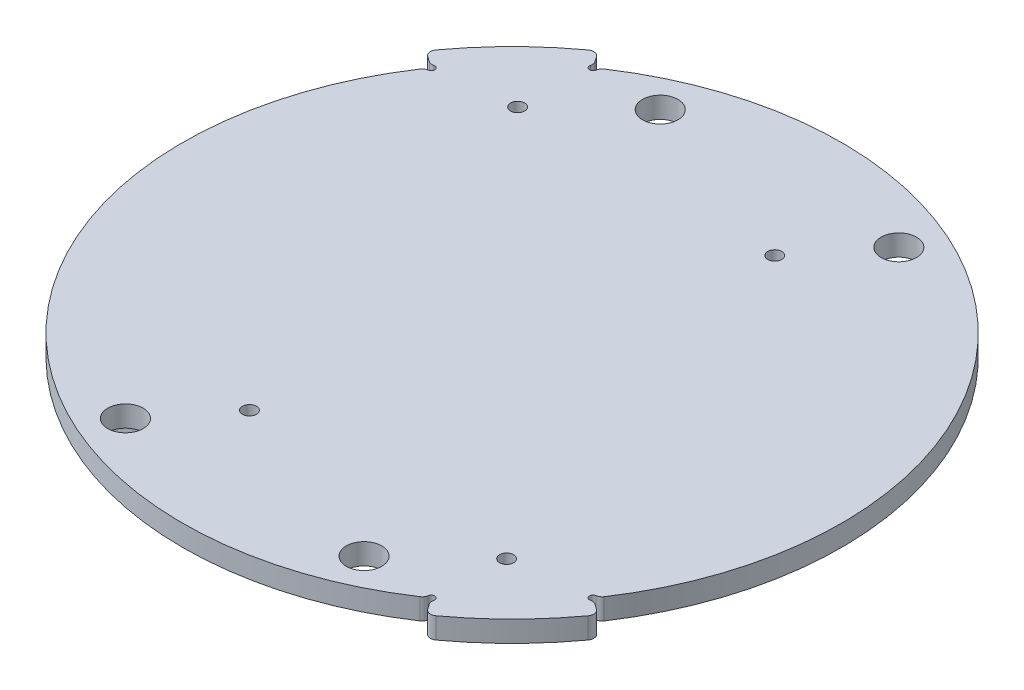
ISO-10303-21;
HEADER;
FILE_DESCRIPTION(('STEP AP214'),'2;1');
FILE_NAME('part.step','',(''),(''),'','','');
FILE_SCHEMA(('AUTOMOTIVE_DESIGN { 1 0 10303 214 1 1 1 1 }'));
ENDSEC;
DATA;
#1=APPLICATION_CONTEXT('core data for automotive mechanical design processes');
#2=APPLICATION_PROTOCOL_DEFINITION('international standard','automotive_design',2000,#1);
#3=PRODUCT_CONTEXT('',#1,'mechanical');
#4=PRODUCT('Part','Part','',(#3));
#5=PRODUCT_RELATED_PRODUCT_CATEGORY('part','',(#4));
#6=PRODUCT_DEFINITION_FORMATION('','',#4);
#7=PRODUCT_DEFINITION_CONTEXT('part definition',#1,'design');
#8=PRODUCT_DEFINITION('design','',#6,#7);
#9=PRODUCT_DEFINITION_SHAPE('','',#8);
#10=(LENGTH_UNIT() NAMED_UNIT(*) SI_UNIT(.MILLI.,.METRE.));
#11=(NAMED_UNIT(*) PLANE_ANGLE_UNIT() SI_UNIT($,.RADIAN.));
#12=(NAMED_UNIT(*) SI_UNIT($,.STERADIAN.) SOLID_ANGLE_UNIT());
#13=UNCERTAINTY_MEASURE_WITH_UNIT(LENGTH_MEASURE(1.E-05),#10,'distance_accuracy_value','');
#14=(GEOMETRIC_REPRESENTATION_CONTEXT(3) GLOBAL_UNCERTAINTY_ASSIGNED_CONTEXT((#13)) GLOBAL_UNIT_ASSIGNED_CONTEXT((#10,
#11,#12)) REPRESENTATION_CONTEXT('',''));
#15=CARTESIAN_POINT('',(0.,0.,0.));
#16=DIRECTION('',(0.,0.,1.));
#17=DIRECTION('',(1.,0.,0.));
#18=AXIS2_PLACEMENT_3D('',#15,#16,#17);
#19=CARTESIAN_POINT('',(0.,1.5,0.));
#20=DIRECTION('',(0.,-1.,0.));
#21=DIRECTION('',(0.,0.,-1.));
#22=AXIS2_PLACEMENT_3D('',#19,#20,#21);
#23=CYLINDRICAL_SURFACE('',#22,47.);
#24=CARTESIAN_POINT('',(0.,1.5,0.));
#25=DIRECTION('',(0.,1.,0.));
#26=DIRECTION('',(0.,0.,1.));
#27=AXIS2_PLACEMENT_3D('',#24,#25,#26);
#28=CIRCLE('',#27,47.);
#29=CARTESIAN_POINT('',(-39.1371803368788,1.5,-26.0246251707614));
#30=VERTEX_POINT('',#29);
#31=CARTESIAN_POINT('',(26.0246251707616,1.5,39.1371803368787));
#32=VERTEX_POINT('',#31);
#33=EDGE_CURVE('E1263',#30,#32,#28,.T.);
#34=ORIENTED_EDGE('',*,*,#33,.F.);
#35=DIRECTION('',(0.,-1.,0.));
#36=VECTOR('',#35,1.);
#37=CARTESIAN_POINT('',(-39.1371803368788,1.5,-26.0246251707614));
#38=LINE('',#37,#36);
#39=CARTESIAN_POINT('',(-39.1371803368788,-1.5,-26.0246251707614));
#40=VERTEX_POINT('',#39);
#41=EDGE_CURVE('E888',#30,#40,#38,.T.);
#42=ORIENTED_EDGE('',*,*,#41,.T.);
#43=CARTESIAN_POINT('',(0.,-1.5,0.));
#44=DIRECTION('',(0.,1.,0.));
#45=DIRECTION('',(0.,0.,1.));
#46=AXIS2_PLACEMENT_3D('',#43,#44,#45);
#47=CIRCLE('',#46,47.);
#48=CARTESIAN_POINT('',(-46.7520897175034,-1.5,-4.82100684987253));
#49=VERTEX_POINT('',#48);
#50=EDGE_CURVE('E626',#40,#49,#47,.T.);
#51=ORIENTED_EDGE('',*,*,#50,.T.);
#52=DIRECTION('',(0.,1.,0.));
#53=VECTOR('',#52,1.);
#54=CARTESIAN_POINT('',(-46.7520897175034,-9.5,-4.82100684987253));
#55=LINE('',#54,#53);
#56=CARTESIAN_POINT('',(-46.7520897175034,-1.56421989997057,-4.82100684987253));
#57=VERTEX_POINT('',#56);
#58=EDGE_CURVE('E652',#57,#49,#55,.T.);
#59=ORIENTED_EDGE('',*,*,#58,.F.);
#60=CARTESIAN_POINT('',(-43.5620347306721,-9.5,-17.6450879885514));
#61=CARTESIAN_POINT('',(-43.5620041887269,-9.33411921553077,-17.645141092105));
#62=CARTESIAN_POINT('',(-43.5650463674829,-9.16826638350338,-17.6376524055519));
#63=CARTESIAN_POINT('',(-43.5770475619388,-8.83822102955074,-17.6079922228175));
#64=CARTESIAN_POINT('',(-43.5860019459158,-8.67402731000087,-17.5858322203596));
#65=CARTESIAN_POINT('',(-43.6094953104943,-8.35007845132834,-17.5274880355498));
#66=CARTESIAN_POINT('',(-43.6239842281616,-8.19029690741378,-17.4914295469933));
#67=CARTESIAN_POINT('',(-43.6581519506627,-7.87490456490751,-17.4059729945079));
#68=CARTESIAN_POINT('',(-43.6778314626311,-7.7192943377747,-17.356573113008));
#69=CARTESIAN_POINT('',(-43.7218200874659,-7.41378567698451,-17.2454630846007));
#70=CARTESIAN_POINT('',(-43.7461144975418,-7.26387087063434,-17.1837920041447));
#71=CARTESIAN_POINT('',(-43.7988226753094,-6.97000064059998,-17.0489989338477));
#72=CARTESIAN_POINT('',(-43.8272381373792,-6.82604769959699,-16.9758722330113));
#73=CARTESIAN_POINT('',(-43.9178878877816,-6.40365243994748,-16.7405921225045));
#74=CARTESIAN_POINT('',(-43.9854702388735,-6.13504210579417,-16.5626762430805));
#75=CARTESIAN_POINT('',(-44.159613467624,-5.52349880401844,-16.0938824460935));
#76=CARTESIAN_POINT('',(-44.270863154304,-5.19463554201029,-15.7864618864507));
#77=CARTESIAN_POINT('',(-44.4437605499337,-4.74363401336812,-15.2899780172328));
#78=CARTESIAN_POINT('',(-44.5024763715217,-4.60019164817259,-15.1183472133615));
#79=CARTESIAN_POINT('',(-44.6209370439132,-4.32671000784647,-14.7650458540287));
#80=CARTESIAN_POINT('',(-44.6806817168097,-4.19666844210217,-14.5833770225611));
#81=CARTESIAN_POINT('',(-44.8325278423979,-3.88265038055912,-14.1115056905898));
#82=CARTESIAN_POINT('',(-44.9247223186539,-3.70735638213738,-13.8155554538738));
#83=CARTESIAN_POINT('',(-45.1069342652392,-3.3838915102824,-13.2085229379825));
#84=CARTESIAN_POINT('',(-45.1969504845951,-3.2357359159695,-12.8974322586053));
#85=CARTESIAN_POINT('',(-45.3731167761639,-2.96345656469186,-12.2633093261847));
#86=CARTESIAN_POINT('',(-45.4592604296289,-2.83937165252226,-11.9402587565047));
#87=CARTESIAN_POINT('',(-45.626266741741,-2.61268712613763,-11.2853034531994));
#88=CARTESIAN_POINT('',(-45.7071274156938,-2.51009555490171,-10.9533954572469));
#89=CARTESIAN_POINT('',(-45.8544625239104,-2.33366578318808,-10.3181004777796));
#90=CARTESIAN_POINT('',(-45.9215562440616,-2.25794016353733,-10.0153745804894));
#91=CARTESIAN_POINT('',(-46.0502806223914,-2.12004685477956,-9.40577943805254));
#92=CARTESIAN_POINT('',(-46.1119121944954,-2.05787689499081,-9.0989108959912));
#93=CARTESIAN_POINT('',(-46.2294330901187,-1.94552833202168,-8.48164515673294));
#94=CARTESIAN_POINT('',(-46.2853176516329,-1.89535962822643,-8.17124526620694));
#95=CARTESIAN_POINT('',(-46.3910516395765,-1.8057191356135,-7.54786969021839));
#96=CARTESIAN_POINT('',(-46.4409003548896,-1.76624860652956,-7.23489370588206));
#97=CARTESIAN_POINT('',(-46.581137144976,-1.66199558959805,-6.29289461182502));
#98=CARTESIAN_POINT('',(-46.6622006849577,-1.61138543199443,-5.66087988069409));
#99=CARTESIAN_POINT('',(-46.7986022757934,-1.53940433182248,-4.39289104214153));
#100=CARTESIAN_POINT('',(-46.8539529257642,-1.51801905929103,-3.75691902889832));
#101=CARTESIAN_POINT('',(-46.9070569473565,-1.50503664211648,-2.95874247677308));
#102=CARTESIAN_POINT('',(-46.9169547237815,-1.50312047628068,-2.7974092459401));
#103=CARTESIAN_POINT('',(-46.9350711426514,-1.50060296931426,-2.47489962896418));
#104=CARTESIAN_POINT('',(-46.943292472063,-1.49999950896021,-2.3137234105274));
#105=CARTESIAN_POINT('',(-46.9506840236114,-1.5,-2.15250312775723));
#106=B_SPLINE_CURVE_WITH_KNOTS('',3,(#60,#61,#62,#63,#64,#65,#66,#67,#68,#69,#70,#71,#72,#73,
#74,#75,#76,#77,#78,#79,#80,#81,#82,#83,#84,#85,#86,#87,#88,#89,#90,#91,#92,#93,#94,#95,#96,#97,
#98,#99,#100,#101,#102,#103,#104,#105),.UNSPECIFIED.,.F.,.F.,(4,2,2,2,2,2,2,2,2,2,2,2,2,2,2,2,2,
2,2,2,2,2,4),(0.,0.49740151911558,0.994413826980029,1.48703294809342,1.97971921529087,
2.47086136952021,2.96220603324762,3.94607265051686,5.32917035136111,6.02250801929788,
6.71572697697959,7.78237882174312,8.84962936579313,9.91858814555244,10.9879462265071,
11.9451124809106,12.9021182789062,13.85991077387,14.8178160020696,16.7338721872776,
18.6489885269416,19.133925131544,19.6180782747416),.UNSPECIFIED.);
#107=CARTESIAN_POINT('',(-46.9506840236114,-1.5,-2.15250312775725));
#108=VERTEX_POINT('',#107);
#109=EDGE_CURVE('E766',#57,#108,#106,.T.);
#110=ORIENTED_EDGE('',*,*,#109,.T.);
#111=CARTESIAN_POINT('',(-36.7626637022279,-1.5,29.2832128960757));
#112=VERTEX_POINT('',#111);
#113=EDGE_CURVE('E633',#108,#112,#47,.T.);
#114=ORIENTED_EDGE('',*,*,#113,.T.);
#115=CARTESIAN_POINT('',(-36.7626637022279,-1.5,29.2832128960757));
#116=CARTESIAN_POINT('',(-36.6236327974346,-1.50000236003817,29.4577554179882));
#117=CARTESIAN_POINT('',(-36.4833562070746,-1.50115389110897,29.6313097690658));
#118=CARTESIAN_POINT('',(-36.2004160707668,-1.50603438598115,29.9763176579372));
#119=CARTESIAN_POINT('',(-36.0577534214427,-1.50976240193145,30.1477719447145));
#120=CARTESIAN_POINT('',(-35.7700420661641,-1.52007459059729,30.4885850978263));
#121=CARTESIAN_POINT('',(-35.624993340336,-1.5266587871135,30.6579439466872));
#122=CARTESIAN_POINT('',(-35.3325243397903,-1.54299011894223,30.9945554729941));
#123=CARTESIAN_POINT('',(-35.1851032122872,-1.55273841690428,31.1618073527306));
#124=CARTESIAN_POINT('',(-35.0365559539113,-1.56421989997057,31.3279387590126));
#125=B_SPLINE_CURVE_WITH_KNOTS('',3,(#115,#116,#117,#118,#119,#120,#121,#122,#123,#124),
.UNSPECIFIED.,.F.,.F.,(4,2,2,2,4),(0.,0.669437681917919,1.3386292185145,2.00782633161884,
2.67726962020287),.UNSPECIFIED.);
#126=CARTESIAN_POINT('',(-35.0365559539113,-1.56421989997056,31.3279387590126));
#127=VERTEX_POINT('',#126);
#128=EDGE_CURVE('E773',#112,#127,#125,.T.);
#129=ORIENTED_EDGE('',*,*,#128,.T.);
#130=DIRECTION('',(0.,1.,0.));
#131=VECTOR('',#130,1.);
#132=CARTESIAN_POINT('',(-35.0365559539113,-9.5,31.3279387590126));
#133=LINE('',#132,#131);
#134=CARTESIAN_POINT('',(-35.0365559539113,-1.5,31.3279387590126));
#135=VERTEX_POINT('',#134);
#136=EDGE_CURVE('E657',#127,#135,#133,.T.);
#137=ORIENTED_EDGE('',*,*,#136,.T.);
#138=CARTESIAN_POINT('',(26.0246251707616,-1.5,39.1371803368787));
#139=VERTEX_POINT('',#138);
#140=EDGE_CURVE('E625',#135,#139,#47,.T.);
#141=ORIENTED_EDGE('',*,*,#140,.T.);
#142=DIRECTION('',(0.,-1.,0.));
#143=VECTOR('',#142,1.);
#144=CARTESIAN_POINT('',(26.0246251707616,1.5,39.1371803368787));
#145=LINE('',#144,#143);
#146=EDGE_CURVE('E885',#139,#32,#145,.F.);
#147=ORIENTED_EDGE('',*,*,#146,.T.);
#148=EDGE_LOOP('',(#34,#42,#51,#59,#110,#114,#129,#137,#141,#147));
#149=FACE_BOUND('',#148,.T.);
#150=ADVANCED_FACE('F34',(#149),#23,.T.);
#151=CARTESIAN_POINT('',(0.,-9.5,0.));
#152=DIRECTION('',(0.,-1.,0.));
#153=DIRECTION('',(0.,0.,-1.));
#154=AXIS2_PLACEMENT_3D('',#151,#152,#153);
#155=PLANE('',#154);
#156=DIRECTION('',(0.308303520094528,0.,0.951288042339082));
#157=VECTOR('',#156,1.);
#158=CARTESIAN_POINT('',(-34.246369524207,-9.5,11.098926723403));
#159=LINE('',#158,#157);
#160=CARTESIAN_POINT('',(-39.1792258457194,-9.5,-4.12168195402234));
#161=VERTEX_POINT('',#160);
#162=CARTESIAN_POINT('',(-29.3135132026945,-9.5,26.3195354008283));
#163=VERTEX_POINT('',#162);
#164=EDGE_CURVE('E557',#161,#163,#159,.T.);
#165=ORIENTED_EDGE('',*,*,#164,.F.);
#166=DIRECTION('',(-0.951288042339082,0.,0.308303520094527));
#167=VECTOR('',#166,1.);
#168=CARTESIAN_POINT('',(-39.1792258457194,-9.5,-4.12168195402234));
#169=LINE('',#168,#167);
#170=CARTESIAN_POINT('',(-36.3253617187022,-9.5,-5.04659251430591));
#171=VERTEX_POINT('',#170);
#172=EDGE_CURVE('E1112',#171,#161,#169,.T.);
#173=ORIENTED_EDGE('',*,*,#172,.F.);
#174=DIRECTION('',(-0.308303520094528,0.,-0.951288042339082));
#175=VECTOR('',#174,1.);
#176=CARTESIAN_POINT('',(-31.3925053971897,-9.5,10.1740161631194));
#177=LINE('',#176,#175);
#178=CARTESIAN_POINT('',(-26.4596490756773,-9.5,25.3946248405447));
#179=VERTEX_POINT('',#178);
#180=EDGE_CURVE('E563',#179,#171,#177,.T.);
#181=ORIENTED_EDGE('',*,*,#180,.F.);
#182=DIRECTION('',(0.951288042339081,0.,-0.308303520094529));
#183=VECTOR('',#182,1.);
#184=CARTESIAN_POINT('',(-29.3135132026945,-9.5,26.3195354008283));
#185=LINE('',#184,#183);
#186=EDGE_CURVE('E510',#163,#179,#185,.T.);
#187=ORIENTED_EDGE('',*,*,#186,.F.);
#188=EDGE_LOOP('',(#165,#173,#181,#187));
#189=FACE_BOUND('',#188,.T.);
#190=ADVANCED_FACE('F750',(#189),#155,.T.);
#191=DIRECTION('',(0.308303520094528,0.,0.951288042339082));
#192=VECTOR('',#191,1.);
#193=CARTESIAN_POINT('',(-15.2206086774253,-9.5,4.93285632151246));
#194=LINE('',#193,#192);
#195=CARTESIAN_POINT('',(-20.1534649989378,-9.5,-10.2877523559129));
#196=VERTEX_POINT('',#195);
#197=CARTESIAN_POINT('',(-10.2877523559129,-9.5,20.1534649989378));
#198=VERTEX_POINT('',#197);
#199=EDGE_CURVE('E560',#196,#198,#194,.T.);
#200=ORIENTED_EDGE('',*,*,#199,.F.);
#201=CARTESIAN_POINT('',(-17.2996008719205,-9.5,-11.2126629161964));
#202=VERTEX_POINT('',#201);
#203=EDGE_CURVE('E504',#202,#196,#169,.T.);
#204=ORIENTED_EDGE('',*,*,#203,.F.);
#205=DIRECTION('',(-0.308303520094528,0.,-0.951288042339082));
#206=VECTOR('',#205,1.);
#207=CARTESIAN_POINT('',(-12.3667445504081,-9.5,4.00794576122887));
#208=LINE('',#207,#206);
#209=CARTESIAN_POINT('',(-7.43388822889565,-9.5,19.2285544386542));
#210=VERTEX_POINT('',#209);
#211=EDGE_CURVE('E574',#210,#202,#208,.T.);
#212=ORIENTED_EDGE('',*,*,#211,.F.);
#213=EDGE_CURVE('E548',#198,#210,#185,.T.);
#214=ORIENTED_EDGE('',*,*,#213,.F.);
#215=EDGE_LOOP('',(#200,#204,#212,#214));
#216=FACE_BOUND('',#215,.T.);
#217=ADVANCED_FACE('F755',(#216),#155,.T.);
#218=CARTESIAN_POINT('',(0.,-1.5,0.));
#219=DIRECTION('',(0.,1.,0.));
#220=DIRECTION('',(0.,0.,1.));
#221=AXIS2_PLACEMENT_3D('',#218,#219,#220);
#222=PLANE('',#221);
#223=CARTESIAN_POINT('',(-17.0092592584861,-1.5,38.1280421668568));
#224=DIRECTION('',(0.,1.,0.));
#225=DIRECTION('',(0.,0.,1.));
#226=AXIS2_PLACEMENT_3D('',#223,#224,#225);
#227=CIRCLE('',#226,2.5273);
#228=CARTESIAN_POINT('',(-17.0092592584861,-1.5,40.6553421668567));
#229=VERTEX_POINT('',#228);
#230=EDGE_CURVE('E1163',#229,#229,#227,.T.);
#231=ORIENTED_EDGE('',*,*,#230,.T.);
#232=EDGE_LOOP('',(#231));
#233=FACE_BOUND('',#232,.T.);
#234=CARTESIAN_POINT('',(17.0092592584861,-1.5,38.1280421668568));
#235=DIRECTION('',(0.,1.,0.));
#236=DIRECTION('',(0.,0.,1.));
#237=AXIS2_PLACEMENT_3D('',#234,#235,#236);
#238=CIRCLE('',#237,2.5273);
#239=CARTESIAN_POINT('',(17.0092592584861,-1.5,40.6553421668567));
#240=VERTEX_POINT('',#239);
#241=EDGE_CURVE('E1157',#240,#240,#238,.T.);
#242=ORIENTED_EDGE('',*,*,#241,.T.);
#243=EDGE_LOOP('',(#242));
#244=FACE_BOUND('',#243,.T.);
#245=CARTESIAN_POINT('',(17.009259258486,-1.5,-38.1280421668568));
#246=DIRECTION('',(0.,1.,0.));
#247=DIRECTION('',(0.,0.,1.));
#248=AXIS2_PLACEMENT_3D('',#245,#246,#247);
#249=CIRCLE('',#248,2.5273);
#250=CARTESIAN_POINT('',(17.009259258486,-1.5,-35.6007421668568));
#251=VERTEX_POINT('',#250);
#252=EDGE_CURVE('E577',#251,#251,#249,.T.);
#253=ORIENTED_EDGE('',*,*,#252,.T.);
#254=EDGE_LOOP('',(#253));
#255=FACE_BOUND('',#254,.T.);
#256=CARTESIAN_POINT('',(-17.009259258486,-1.5,-38.1280421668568));
#257=DIRECTION('',(0.,1.,0.));
#258=DIRECTION('',(0.,0.,1.));
#259=AXIS2_PLACEMENT_3D('',#256,#257,#258);
#260=CIRCLE('',#259,2.5273);
#261=CARTESIAN_POINT('',(-17.009259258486,-1.5,-35.6007421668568));
#262=VERTEX_POINT('',#261);
#263=EDGE_CURVE('E1146',#262,#262,#260,.T.);
#264=ORIENTED_EDGE('',*,*,#263,.T.);
#265=EDGE_LOOP('',(#264));
#266=FACE_BOUND('',#265,.T.);
#267=CARTESIAN_POINT('',(-9.16666666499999,-1.5,28.2842712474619));
#268=DIRECTION('',(0.,1.,0.));
#269=DIRECTION('',(0.,0.,1.));
#270=AXIS2_PLACEMENT_3D('',#267,#268,#269);
#271=CIRCLE('',#270,1.);
#272=CARTESIAN_POINT('',(-9.16666666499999,-1.5,29.2842712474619));
#273=VERTEX_POINT('',#272);
#274=EDGE_CURVE('E712',#273,#273,#271,.T.);
#275=ORIENTED_EDGE('',*,*,#274,.T.);
#276=EDGE_LOOP('',(#275));
#277=FACE_BOUND('',#276,.T.);
#278=CARTESIAN_POINT('',(9.16666666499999,-1.5,-28.2842712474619));
#279=DIRECTION('',(0.,1.,0.));
#280=DIRECTION('',(0.,0.,1.));
#281=AXIS2_PLACEMENT_3D('',#278,#279,#280);
#282=CIRCLE('',#281,1.);
#283=CARTESIAN_POINT('',(9.16666666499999,-1.5,-27.2842712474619));
#284=VERTEX_POINT('',#283);
#285=EDGE_CURVE('E718',#284,#284,#282,.T.);
#286=ORIENTED_EDGE('',*,*,#285,.T.);
#287=EDGE_LOOP('',(#286));
#288=FACE_BOUND('',#287,.T.);
#289=CARTESIAN_POINT('',(27.4999999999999,-1.5,28.2842712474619));
#290=DIRECTION('',(0.,1.,0.));
#291=DIRECTION('',(0.,0.,1.));
#292=AXIS2_PLACEMENT_3D('',#289,#290,#291);
#293=CIRCLE('',#292,0.999999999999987);
#294=CARTESIAN_POINT('',(27.4999999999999,-1.5,29.2842712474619));
#295=VERTEX_POINT('',#294);
#296=EDGE_CURVE('E724',#295,#295,#293,.T.);
#297=ORIENTED_EDGE('',*,*,#296,.T.);
#298=EDGE_LOOP('',(#297));
#299=FACE_BOUND('',#298,.T.);
#300=CARTESIAN_POINT('',(-27.4999999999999,-1.5,-28.2842712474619));
#301=DIRECTION('',(0.,1.,0.));
#302=DIRECTION('',(0.,0.,1.));
#303=AXIS2_PLACEMENT_3D('',#300,#301,#302);
#304=CIRCLE('',#303,1.);
#305=CARTESIAN_POINT('',(-27.4999999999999,-1.5,-27.2842712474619));
#306=VERTEX_POINT('',#305);
#307=EDGE_CURVE('E706',#306,#306,#304,.T.);
#308=ORIENTED_EDGE('',*,*,#307,.T.);
#309=EDGE_LOOP('',(#308));
#310=FACE_BOUND('',#309,.T.);
#311=CARTESIAN_POINT('',(-38.5001460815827,-1.5,-26.958092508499));
#312=DIRECTION('',(0.,-1.,0.));
#313=DIRECTION('',(0.,0.,-1.));
#314=AXIS2_PLACEMENT_3D('',#311,#312,#313);
#315=CIRCLE('',#314,0.499999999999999);
#316=CARTESIAN_POINT('',(-38.614233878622,-1.5,-27.4449025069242));
#317=VERTEX_POINT('',#316);
#318=CARTESIAN_POINT('',(-38.4349221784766,-1.5,-26.4623649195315));
#319=VERTEX_POINT('',#318);
#320=EDGE_CURVE('E870',#317,#319,#315,.T.);
#321=ORIENTED_EDGE('',*,*,#320,.F.);
#322=CARTESIAN_POINT('',(-38.8424094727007,-1.5,-28.4185225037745));
#323=DIRECTION('',(0.,1.,0.));
#324=DIRECTION('',(0.,0.,1.));
#325=AXIS2_PLACEMENT_3D('',#322,#323,#324);
#326=CIRCLE('',#325,1.);
#327=CARTESIAN_POINT('',(-39.4159859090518,-1.5,-27.5993704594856));
#328=VERTEX_POINT('',#327);
#329=EDGE_CURVE('E873',#317,#328,#326,.F.);
#330=ORIENTED_EDGE('',*,*,#329,.T.);
#331=DIRECTION('',(0.819152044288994,0.,0.573576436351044));
#332=VECTOR('',#331,1.);
#333=CARTESIAN_POINT('',(0.,-1.5,0.));
#334=LINE('',#333,#332);
#335=CARTESIAN_POINT('',(-40.1300906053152,-1.5,-28.0993919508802));
#336=VERTEX_POINT('',#335);
#337=EDGE_CURVE('E1134',#336,#328,#334,.T.);
#338=ORIENTED_EDGE('',*,*,#337,.F.);
#339=CARTESIAN_POINT('',(-39.5565141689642,-1.5,-28.9185439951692));
#340=DIRECTION('',(0.,1.,0.));
#341=DIRECTION('',(0.,0.,1.));
#342=AXIS2_PLACEMENT_3D('',#339,#340,#341);
#343=CIRCLE('',#342,1.);
#344=CARTESIAN_POINT('',(-40.3637899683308,-1.5,-29.5087183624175));
#345=VERTEX_POINT('',#344);
#346=EDGE_CURVE('E1230',#336,#345,#343,.F.);
#347=ORIENTED_EDGE('',*,*,#346,.T.);
#348=CARTESIAN_POINT('',(0.,-1.5,0.));
#349=DIRECTION('',(0.,1.,0.));
#350=DIRECTION('',(0.,0.,1.));
#351=AXIS2_PLACEMENT_3D('',#348,#349,#350);
#352=CIRCLE('',#351,50.);
#353=CARTESIAN_POINT('',(-29.5087183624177,-1.5,-40.3637899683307));
#354=VERTEX_POINT('',#353);
#355=EDGE_CURVE('E1129',#354,#345,#352,.T.);
#356=ORIENTED_EDGE('',*,*,#355,.F.);
#357=CARTESIAN_POINT('',(-28.9185439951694,-1.5,-39.556514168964));
#358=DIRECTION('',(0.,1.,0.));
#359=DIRECTION('',(0.,0.,1.));
#360=AXIS2_PLACEMENT_3D('',#357,#358,#359);
#361=CIRCLE('',#360,1.);
#362=CARTESIAN_POINT('',(-28.0993919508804,-1.5,-40.1300906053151));
#363=VERTEX_POINT('',#362);
#364=EDGE_CURVE('E1228',#354,#363,#361,.F.);
#365=ORIENTED_EDGE('',*,*,#364,.T.);
#366=DIRECTION('',(0.573576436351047,0.,0.819152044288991));
#367=VECTOR('',#366,1.);
#368=CARTESIAN_POINT('',(0.,-1.5,0.));
#369=LINE('',#368,#367);
#370=CARTESIAN_POINT('',(-27.5993704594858,-1.5,-39.4159859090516));
#371=VERTEX_POINT('',#370);
#372=EDGE_CURVE('E1136',#363,#371,#369,.T.);
#373=ORIENTED_EDGE('',*,*,#372,.T.);
#374=CARTESIAN_POINT('',(-28.4185225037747,-1.5,-38.8424094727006));
#375=DIRECTION('',(0.,1.,0.));
#376=DIRECTION('',(0.,0.,1.));
#377=AXIS2_PLACEMENT_3D('',#374,#375,#376);
#378=CIRCLE('',#377,1.);
#379=CARTESIAN_POINT('',(-27.4449025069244,-1.5,-38.6142338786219));
#380=VERTEX_POINT('',#379);
#381=EDGE_CURVE('E890',#371,#380,#378,.F.);
#382=ORIENTED_EDGE('',*,*,#381,.T.);
#383=CARTESIAN_POINT('',(-26.9580925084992,-1.5,-38.5001460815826));
#384=DIRECTION('',(0.,-1.,0.));
#385=DIRECTION('',(0.,0.,-1.));
#386=AXIS2_PLACEMENT_3D('',#383,#384,#385);
#387=CIRCLE('',#386,0.499999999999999);
#388=CARTESIAN_POINT('',(-26.4623649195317,-1.5,-38.4349221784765));
#389=VERTEX_POINT('',#388);
#390=EDGE_CURVE('E1200',#389,#380,#387,.T.);
#391=ORIENTED_EDGE('',*,*,#390,.F.);
#392=CARTESIAN_POINT('',(-25.4709097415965,-1.5,-38.3044743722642));
#393=DIRECTION('',(0.,1.,0.));
#394=DIRECTION('',(0.,0.,1.));
#395=AXIS2_PLACEMENT_3D('',#392,#393,#394);
#396=CIRCLE('',#395,1.);
#397=CARTESIAN_POINT('',(-26.0246251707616,-1.5,-39.1371803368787));
#398=VERTEX_POINT('',#397);
#399=EDGE_CURVE('E1216',#389,#398,#396,.F.);
#400=ORIENTED_EDGE('',*,*,#399,.T.);
#401=CARTESIAN_POINT('',(39.1371803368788,-1.5,26.0246251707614));
#402=VERTEX_POINT('',#401);
#403=EDGE_CURVE('E621',#402,#398,#47,.T.);
#404=ORIENTED_EDGE('',*,*,#403,.F.);
#405=CARTESIAN_POINT('',(38.3044743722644,-1.5,25.4709097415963));
#406=DIRECTION('',(0.,1.,0.));
#407=DIRECTION('',(0.,0.,1.));
#408=AXIS2_PLACEMENT_3D('',#405,#406,#407);
#409=CIRCLE('',#408,1.);
#410=CARTESIAN_POINT('',(38.4349221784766,-1.5,26.4623649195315));
#411=VERTEX_POINT('',#410);
#412=EDGE_CURVE('E1224',#402,#411,#409,.F.);
#413=ORIENTED_EDGE('',*,*,#412,.T.);
#414=CARTESIAN_POINT('',(38.5001460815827,-1.5,26.9580925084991));
#415=DIRECTION('',(0.,-1.,0.));
#416=DIRECTION('',(0.,0.,-1.));
#417=AXIS2_PLACEMENT_3D('',#414,#415,#416);
#418=CIRCLE('',#417,0.499999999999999);
#419=CARTESIAN_POINT('',(38.614233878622,-1.5,27.4449025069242));
#420=VERTEX_POINT('',#419);
#421=EDGE_CURVE('E1187',#420,#411,#418,.T.);
#422=ORIENTED_EDGE('',*,*,#421,.F.);
#423=CARTESIAN_POINT('',(38.8424094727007,-1.5,28.4185225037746));
#424=DIRECTION('',(0.,1.,0.));
#425=DIRECTION('',(0.,0.,1.));
#426=AXIS2_PLACEMENT_3D('',#423,#424,#425);
#427=CIRCLE('',#426,1.);
#428=CARTESIAN_POINT('',(39.4159859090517,-1.5,27.5993704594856));
#429=VERTEX_POINT('',#428);
#430=EDGE_CURVE('E1226',#420,#429,#427,.F.);
#431=ORIENTED_EDGE('',*,*,#430,.T.);
#432=DIRECTION('',(-0.819152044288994,0.,-0.573576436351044));
#433=VECTOR('',#432,1.);
#434=CARTESIAN_POINT('',(0.,-1.5,0.));
#435=LINE('',#434,#433);
#436=CARTESIAN_POINT('',(40.1300906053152,-1.5,28.0993919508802));
#437=VERTEX_POINT('',#436);
#438=EDGE_CURVE('E1122',#437,#429,#435,.T.);
#439=ORIENTED_EDGE('',*,*,#438,.F.);
#440=CARTESIAN_POINT('',(39.5565141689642,-1.5,28.9185439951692));
#441=DIRECTION('',(0.,1.,0.));
#442=DIRECTION('',(0.,0.,1.));
#443=AXIS2_PLACEMENT_3D('',#440,#441,#442);
#444=CIRCLE('',#443,1.);
#445=CARTESIAN_POINT('',(40.3637899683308,-1.5,29.5087183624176));
#446=VERTEX_POINT('',#445);
#447=EDGE_CURVE('E620',#437,#446,#444,.F.);
#448=ORIENTED_EDGE('',*,*,#447,.T.);
#449=CARTESIAN_POINT('',(0.,-1.5,0.));
#450=DIRECTION('',(0.,1.,0.));
#451=DIRECTION('',(0.,0.,1.));
#452=AXIS2_PLACEMENT_3D('',#449,#450,#451);
#453=CIRCLE('',#452,50.);
#454=CARTESIAN_POINT('',(29.5087183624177,-1.5,40.3637899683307));
#455=VERTEX_POINT('',#454);
#456=EDGE_CURVE('E1115',#446,#455,#453,.F.);
#457=ORIENTED_EDGE('',*,*,#456,.T.);
#458=CARTESIAN_POINT('',(28.9185439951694,-1.5,39.5565141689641));
#459=DIRECTION('',(0.,1.,0.));
#460=DIRECTION('',(0.,0.,1.));
#461=AXIS2_PLACEMENT_3D('',#458,#459,#460);
#462=CIRCLE('',#461,1.);
#463=CARTESIAN_POINT('',(28.0993919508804,-1.5,40.1300906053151));
#464=VERTEX_POINT('',#463);
#465=EDGE_CURVE('E1232',#455,#464,#462,.F.);
#466=ORIENTED_EDGE('',*,*,#465,.T.);
#467=DIRECTION('',(-0.573576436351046,0.,-0.819152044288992));
#468=VECTOR('',#467,1.);
#469=CARTESIAN_POINT('',(0.,-1.5,0.));
#470=LINE('',#469,#468);
#471=CARTESIAN_POINT('',(27.5993704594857,-1.5,39.4159859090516));
#472=VERTEX_POINT('',#471);
#473=EDGE_CURVE('E1118',#464,#472,#470,.T.);
#474=ORIENTED_EDGE('',*,*,#473,.T.);
#475=CARTESIAN_POINT('',(28.4185225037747,-1.5,38.8424094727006));
#476=DIRECTION('',(0.,1.,0.));
#477=DIRECTION('',(0.,0.,1.));
#478=AXIS2_PLACEMENT_3D('',#475,#476,#477);
#479=CIRCLE('',#478,1.);
#480=CARTESIAN_POINT('',(27.4449025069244,-1.5,38.6142338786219));
#481=VERTEX_POINT('',#480);
#482=EDGE_CURVE('E1218',#472,#481,#479,.F.);
#483=ORIENTED_EDGE('',*,*,#482,.T.);
#484=CARTESIAN_POINT('',(26.9580925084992,-1.5,38.5001460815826));
#485=DIRECTION('',(0.,-1.,0.));
#486=DIRECTION('',(0.,0.,-1.));
#487=AXIS2_PLACEMENT_3D('',#484,#485,#486);
#488=CIRCLE('',#487,0.499999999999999);
#489=CARTESIAN_POINT('',(26.4623649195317,-1.5,38.4349221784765));
#490=VERTEX_POINT('',#489);
#491=EDGE_CURVE('E1193',#490,#481,#488,.T.);
#492=ORIENTED_EDGE('',*,*,#491,.F.);
#493=CARTESIAN_POINT('',(25.4709097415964,-1.5,38.3044743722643));
#494=DIRECTION('',(0.,1.,0.));
#495=DIRECTION('',(0.,0.,1.));
#496=AXIS2_PLACEMENT_3D('',#493,#494,#495);
#497=CIRCLE('',#496,1.);
#498=EDGE_CURVE('E1220',#490,#139,#497,.F.);
#499=ORIENTED_EDGE('',*,*,#498,.T.);
#500=ORIENTED_EDGE('',*,*,#140,.F.);
#501=DIRECTION('',(-0.951288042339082,0.,0.308303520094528));
#502=VECTOR('',#501,1.);
#503=CARTESIAN_POINT('',(5.85776688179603,-1.5,18.0744728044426));
#504=LINE('',#503,#502);
#505=CARTESIAN_POINT('',(1.10132667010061,-1.5,19.6159904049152));
#506=VERTEX_POINT('',#505);
#507=EDGE_CURVE('E676',#506,#135,#504,.T.);
#508=ORIENTED_EDGE('',*,*,#507,.F.);
#509=DIRECTION('',(-0.308303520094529,0.,-0.951288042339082));
#510=VECTOR('',#509,1.);
#511=CARTESIAN_POINT('',(-4.75644021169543,-1.5,1.54151760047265));
#512=LINE('',#511,#510);
#513=CARTESIAN_POINT('',(0.176416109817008,-1.5,16.7621262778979));
#514=VERTEX_POINT('',#513);
#515=EDGE_CURVE('E680',#506,#514,#512,.T.);
#516=ORIENTED_EDGE('',*,*,#515,.T.);
#517=DIRECTION('',(-0.951288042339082,0.,0.308303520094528));
#518=VECTOR('',#517,1.);
#519=CARTESIAN_POINT('',(4.93285632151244,-1.5,15.2206086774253));
#520=LINE('',#519,#518);
#521=CARTESIAN_POINT('',(-7.43388822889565,-1.5,19.2285544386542));
#522=VERTEX_POINT('',#521);
#523=EDGE_CURVE('E2030',#514,#522,#520,.T.);
#524=ORIENTED_EDGE('',*,*,#523,.T.);
#525=DIRECTION('',(-0.308303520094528,0.,-0.951288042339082));
#526=VECTOR('',#525,1.);
#527=CARTESIAN_POINT('',(-12.3667445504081,-1.5,4.00794576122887));
#528=LINE('',#527,#526);
#529=CARTESIAN_POINT('',(-9.90031638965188,-1.5,11.6182500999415));
#530=VERTEX_POINT('',#529);
#531=EDGE_CURVE('E2028',#522,#530,#528,.T.);
#532=ORIENTED_EDGE('',*,*,#531,.T.);
#533=DIRECTION('',(-0.951288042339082,0.,0.308303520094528));
#534=VECTOR('',#533,1.);
#535=CARTESIAN_POINT('',(14.8331727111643,-1.5,3.60235857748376));
#536=LINE('',#535,#534);
#537=CARTESIAN_POINT('',(13.8818846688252,-1.5,3.91066209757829));
#538=VERTEX_POINT('',#537);
#539=EDGE_CURVE('E1058',#538,#530,#536,.T.);
#540=ORIENTED_EDGE('',*,*,#539,.F.);
#541=CARTESIAN_POINT('',(13.5735811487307,-1.5,2.9593740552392));
#542=DIRECTION('',(0.,1.,0.));
#543=DIRECTION('',(0.,0.,1.));
#544=AXIS2_PLACEMENT_3D('',#541,#542,#543);
#545=CIRCLE('',#544,1.);
#546=CARTESIAN_POINT('',(14.5248691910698,-1.5,2.65107053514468));
#547=VERTEX_POINT('',#546);
#548=EDGE_CURVE('E11',#538,#547,#545,.T.);
#549=ORIENTED_EDGE('',*,*,#548,.T.);
#550=DIRECTION('',(0.308303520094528,0.,0.951288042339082));
#551=VECTOR('',#550,1.);
#552=CARTESIAN_POINT('',(9.90031638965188,-1.5,-11.6182500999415));
#553=LINE('',#552,#551);
#554=CARTESIAN_POINT('',(10.2086199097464,-1.5,-10.6669620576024));
#555=VERTEX_POINT('',#554);
#556=EDGE_CURVE('E1046',#555,#547,#553,.T.);
#557=ORIENTED_EDGE('',*,*,#556,.F.);
#558=CARTESIAN_POINT('',(9.25733186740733,-1.5,-10.3586585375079));
#559=DIRECTION('',(0.,1.,0.));
#560=DIRECTION('',(0.,0.,1.));
#561=AXIS2_PLACEMENT_3D('',#558,#559,#560);
#562=CIRCLE('',#561,1.);
#563=CARTESIAN_POINT('',(8.94902834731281,-1.5,-11.309946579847));
#564=VERTEX_POINT('',#563);
#565=EDGE_CURVE('E42',#555,#564,#562,.T.);
#566=ORIENTED_EDGE('',*,*,#565,.T.);
#567=DIRECTION('',(0.951288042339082,0.,-0.308303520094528));
#568=VECTOR('',#567,1.);
#569=CARTESIAN_POINT('',(-14.8331727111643,-1.5,-3.60235857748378));
#570=LINE('',#569,#568);
#571=CARTESIAN_POINT('',(-14.8331727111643,-1.5,-3.60235857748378));
#572=VERTEX_POINT('',#571);
#573=EDGE_CURVE('E1043',#572,#564,#570,.T.);
#574=ORIENTED_EDGE('',*,*,#573,.F.);
#575=CARTESIAN_POINT('',(-17.2996008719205,-1.5,-11.2126629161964));
#576=VERTEX_POINT('',#575);
#577=EDGE_CURVE('E2050',#572,#576,#528,.T.);
#578=ORIENTED_EDGE('',*,*,#577,.T.);
#579=DIRECTION('',(-0.951288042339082,0.,0.308303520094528));
#580=VECTOR('',#579,1.);
#581=CARTESIAN_POINT('',(-4.93285632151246,-1.5,-15.2206086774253));
#582=LINE('',#581,#580);
#583=CARTESIAN_POINT('',(-9.68929653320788,-1.5,-13.6790910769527));
#584=VERTEX_POINT('',#583);
#585=EDGE_CURVE('E2047',#584,#576,#582,.T.);
#586=ORIENTED_EDGE('',*,*,#585,.F.);
#587=DIRECTION('',(0.308303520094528,0.,0.951288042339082));
#588=VECTOR('',#587,1.);
#589=CARTESIAN_POINT('',(-4.75644021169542,-1.5,1.54151760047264));
#590=LINE('',#589,#588);
#591=CARTESIAN_POINT('',(-10.6142070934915,-1.5,-16.5329552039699));
#592=VERTEX_POINT('',#591);
#593=EDGE_CURVE('E643',#592,#584,#590,.T.);
#594=ORIENTED_EDGE('',*,*,#593,.F.);
#595=DIRECTION('',(-0.951288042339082,0.,0.308303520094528));
#596=VECTOR('',#595,1.);
#597=CARTESIAN_POINT('',(-5.85776688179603,-1.5,-18.0744728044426));
#598=LINE('',#597,#596);
#599=EDGE_CURVE('E640',#592,#49,#598,.T.);
#600=ORIENTED_EDGE('',*,*,#599,.T.);
#601=ORIENTED_EDGE('',*,*,#50,.F.);
#602=CARTESIAN_POINT('',(-38.3044743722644,-1.5,-25.4709097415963));
#603=DIRECTION('',(0.,1.,0.));
#604=DIRECTION('',(0.,0.,1.));
#605=AXIS2_PLACEMENT_3D('',#602,#603,#604);
#606=CIRCLE('',#605,1.);
#607=EDGE_CURVE('E876',#40,#319,#606,.F.);
#608=ORIENTED_EDGE('',*,*,#607,.T.);
#609=EDGE_LOOP('',(#321,#330,#338,#347,#356,#365,#373,#382,#391,#400,#404,#413,#422,#431,#439,
#448,#457,#466,#474,#483,#492,#499,#500,#508,#516,#524,#532,#540,#549,#557,#566,#574,#578,#586,
#594,#600,#601,#608));
#610=FACE_BOUND('',#609,.T.);
#611=ADVANCED_FACE('F821',(#233,#244,#255,#266,#277,#288,#299,#310,#610),#222,.F.);
#612=CARTESIAN_POINT('',(-12.3667445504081,-9.5,4.00794576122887));
#613=DIRECTION('',(0.951288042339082,0.,-0.308303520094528));
#614=DIRECTION('',(-0.308303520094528,0.,-0.951288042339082));
#615=AXIS2_PLACEMENT_3D('',#612,#613,#614);
#616=PLANE('',#615);
#617=DIRECTION('',(0.308303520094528,0.,0.951288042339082));
#618=VECTOR('',#617,1.);
#619=CARTESIAN_POINT('',(-20.9158222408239,-3.5,-22.3707195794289));
#620=LINE('',#619,#618);
#621=CARTESIAN_POINT('',(-14.8331727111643,-3.5,-3.60235857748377));
#622=VERTEX_POINT('',#621);
#623=CARTESIAN_POINT('',(-9.90031638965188,-3.5,11.6182500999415));
#624=VERTEX_POINT('',#623);
#625=EDGE_CURVE('E1395',#622,#624,#620,.T.);
#626=ORIENTED_EDGE('',*,*,#625,.T.);
#627=DIRECTION('',(0.,1.,0.));
#628=VECTOR('',#627,1.);
#629=CARTESIAN_POINT('',(-9.90031638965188,-6.5,11.6182500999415));
#630=LINE('',#629,#628);
#631=EDGE_CURVE('E1084',#624,#530,#630,.T.);
#632=ORIENTED_EDGE('',*,*,#631,.T.);
#633=ORIENTED_EDGE('',*,*,#531,.F.);
#634=DIRECTION('',(0.,1.,0.));
#635=VECTOR('',#634,1.);
#636=CARTESIAN_POINT('',(-7.43388822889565,-9.5,19.2285544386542));
#637=LINE('',#636,#635);
#638=EDGE_CURVE('E695',#210,#522,#637,.T.);
#639=ORIENTED_EDGE('',*,*,#638,.F.);
#640=ORIENTED_EDGE('',*,*,#211,.T.);
#641=DIRECTION('',(0.,1.,0.));
#642=VECTOR('',#641,1.);
#643=CARTESIAN_POINT('',(-17.2996008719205,-9.5,-11.2126629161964));
#644=LINE('',#643,#642);
#645=EDGE_CURVE('E698',#202,#576,#644,.T.);
#646=ORIENTED_EDGE('',*,*,#645,.T.);
#647=ORIENTED_EDGE('',*,*,#577,.F.);
#648=DIRECTION('',(0.,1.,0.));
#649=VECTOR('',#648,1.);
#650=CARTESIAN_POINT('',(-14.8331727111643,-6.5,-3.60235857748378));
#651=LINE('',#650,#649);
#652=EDGE_CURVE('E1056',#622,#572,#651,.T.);
#653=ORIENTED_EDGE('',*,*,#652,.F.);
#654=EDGE_LOOP('',(#626,#632,#633,#639,#640,#646,#647,#653));
#655=FACE_BOUND('',#654,.T.);
#656=ADVANCED_FACE('F818',(#655),#616,.T.);
#657=ORIENTED_EDGE('',*,*,#113,.F.);
#658=DIRECTION('',(0.308303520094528,0.,0.951288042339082));
#659=VECTOR('',#658,1.);
#660=CARTESIAN_POINT('',(-60.1084996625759,-1.5,-42.7516914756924));
#661=LINE('',#660,#659);
#662=CARTESIAN_POINT('',(-46.7895301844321,-1.5,-1.65525379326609));
#663=VERTEX_POINT('',#662);
#664=EDGE_CURVE('E1092',#108,#663,#661,.T.);
#665=ORIENTED_EDGE('',*,*,#664,.T.);
#666=DIRECTION('',(-0.951288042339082,0.,0.308303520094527));
#667=VECTOR('',#666,1.);
#668=CARTESIAN_POINT('',(-4.93285632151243,-1.5,-15.2206086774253));
#669=LINE('',#668,#667);
#670=CARTESIAN_POINT('',(-39.1792258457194,-1.5,-4.12168195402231));
#671=VERTEX_POINT('',#670);
#672=EDGE_CURVE('E564',#671,#663,#669,.T.);
#673=ORIENTED_EDGE('',*,*,#672,.F.);
#674=DIRECTION('',(0.308303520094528,0.,0.951288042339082));
#675=VECTOR('',#674,1.);
#676=CARTESIAN_POINT('',(-34.246369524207,-1.5,11.098926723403));
#677=LINE('',#676,#675);
#678=CARTESIAN_POINT('',(-29.3135132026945,-1.5,26.3195354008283));
#679=VERTEX_POINT('',#678);
#680=EDGE_CURVE('E687',#671,#679,#677,.T.);
#681=ORIENTED_EDGE('',*,*,#680,.T.);
#682=DIRECTION('',(-0.951288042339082,0.,0.308303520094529));
#683=VECTOR('',#682,1.);
#684=CARTESIAN_POINT('',(4.93285632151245,-1.5,15.2206086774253));
#685=LINE('',#684,#683);
#686=CARTESIAN_POINT('',(-36.9238175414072,-1.5,28.7859635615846));
#687=VERTEX_POINT('',#686);
#688=EDGE_CURVE('E679',#679,#687,#685,.T.);
#689=ORIENTED_EDGE('',*,*,#688,.T.);
#690=EDGE_CURVE('E1089',#687,#112,#661,.T.);
#691=ORIENTED_EDGE('',*,*,#690,.T.);
#692=EDGE_LOOP('',(#657,#665,#673,#681,#689,#691));
#693=FACE_BOUND('',#692,.T.);
#694=ADVANCED_FACE('F743',(#693),#222,.F.);
#695=ORIENTED_EDGE('',*,*,#403,.T.);
#696=DIRECTION('',(0.,-1.,0.));
#697=VECTOR('',#696,1.);
#698=CARTESIAN_POINT('',(-26.0246251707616,1.5,-39.1371803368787));
#699=LINE('',#698,#697);
#700=CARTESIAN_POINT('',(-26.0246251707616,1.5,-39.1371803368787));
#701=VERTEX_POINT('',#700);
#702=EDGE_CURVE('E909',#398,#701,#699,.F.);
#703=ORIENTED_EDGE('',*,*,#702,.T.);
#704=CARTESIAN_POINT('',(39.1371803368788,1.5,26.0246251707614));
#705=VERTEX_POINT('',#704);
#706=EDGE_CURVE('E631',#705,#701,#28,.T.);
#707=ORIENTED_EDGE('',*,*,#706,.F.);
#708=DIRECTION('',(0.,-1.,0.));
#709=VECTOR('',#708,1.);
#710=CARTESIAN_POINT('',(39.1371803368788,1.5,26.0246251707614));
#711=LINE('',#710,#709);
#712=EDGE_CURVE('E906',#705,#402,#711,.T.);
#713=ORIENTED_EDGE('',*,*,#712,.T.);
#714=EDGE_LOOP('',(#695,#703,#707,#713));
#715=FACE_BOUND('',#714,.T.);
#716=ADVANCED_FACE('F733',(#715),#23,.T.);
#717=CARTESIAN_POINT('',(0.,1.5,0.));
#718=DIRECTION('',(0.,1.,0.));
#719=DIRECTION('',(0.,0.,1.));
#720=AXIS2_PLACEMENT_3D('',#717,#718,#719);
#721=PLANE('',#720);
#722=DIRECTION('',(-0.819152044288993,0.,-0.573576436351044));
#723=VECTOR('',#722,1.);
#724=CARTESIAN_POINT('',(0.,1.5,0.));
#725=LINE('',#724,#723);
#726=CARTESIAN_POINT('',(-39.4159859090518,1.5,-27.5993704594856));
#727=VERTEX_POINT('',#726);
#728=CARTESIAN_POINT('',(-40.1300906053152,1.5,-28.0993919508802));
#729=VERTEX_POINT('',#728);
#730=EDGE_CURVE('E1140',#727,#729,#725,.T.);
#731=ORIENTED_EDGE('',*,*,#730,.F.);
#732=CARTESIAN_POINT('',(-38.8424094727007,1.5,-28.4185225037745));
#733=DIRECTION('',(0.,1.,0.));
#734=DIRECTION('',(0.,0.,1.));
#735=AXIS2_PLACEMENT_3D('',#732,#733,#734);
#736=CIRCLE('',#735,1.);
#737=CARTESIAN_POINT('',(-38.614233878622,1.5,-27.4449025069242));
#738=VERTEX_POINT('',#737);
#739=EDGE_CURVE('E614',#727,#738,#736,.T.);
#740=ORIENTED_EDGE('',*,*,#739,.T.);
#741=CARTESIAN_POINT('',(-38.5001460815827,1.5,-26.958092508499));
#742=DIRECTION('',(0.,-1.,0.));
#743=DIRECTION('',(0.,0.,-1.));
#744=AXIS2_PLACEMENT_3D('',#741,#742,#743);
#745=CIRCLE('',#744,0.499999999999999);
#746=CARTESIAN_POINT('',(-38.4349221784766,1.5,-26.4623649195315));
#747=VERTEX_POINT('',#746);
#748=EDGE_CURVE('E879',#738,#747,#745,.T.);
#749=ORIENTED_EDGE('',*,*,#748,.T.);
#750=CARTESIAN_POINT('',(-38.3044743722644,1.5,-25.4709097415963));
#751=DIRECTION('',(0.,1.,0.));
#752=DIRECTION('',(0.,0.,1.));
#753=AXIS2_PLACEMENT_3D('',#750,#751,#752);
#754=CIRCLE('',#753,1.);
#755=EDGE_CURVE('E612',#747,#30,#754,.T.);
#756=ORIENTED_EDGE('',*,*,#755,.T.);
#757=ORIENTED_EDGE('',*,*,#33,.T.);
#758=CARTESIAN_POINT('',(25.4709097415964,1.5,38.3044743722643));
#759=DIRECTION('',(0.,1.,0.));
#760=DIRECTION('',(0.,0.,1.));
#761=AXIS2_PLACEMENT_3D('',#758,#759,#760);
#762=CIRCLE('',#761,1.);
#763=CARTESIAN_POINT('',(26.4623649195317,1.5,38.4349221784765));
#764=VERTEX_POINT('',#763);
#765=EDGE_CURVE('E604',#32,#764,#762,.T.);
#766=ORIENTED_EDGE('',*,*,#765,.T.);
#767=CARTESIAN_POINT('',(26.9580925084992,1.5,38.5001460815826));
#768=DIRECTION('',(0.,-1.,0.));
#769=DIRECTION('',(0.,0.,-1.));
#770=AXIS2_PLACEMENT_3D('',#767,#768,#769);
#771=CIRCLE('',#770,0.499999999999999);
#772=CARTESIAN_POINT('',(27.4449025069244,1.5,38.6142338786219));
#773=VERTEX_POINT('',#772);
#774=EDGE_CURVE('E1190',#764,#773,#771,.T.);
#775=ORIENTED_EDGE('',*,*,#774,.T.);
#776=CARTESIAN_POINT('',(28.4185225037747,1.5,38.8424094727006));
#777=DIRECTION('',(0.,1.,0.));
#778=DIRECTION('',(0.,0.,1.));
#779=AXIS2_PLACEMENT_3D('',#776,#777,#778);
#780=CIRCLE('',#779,1.);
#781=CARTESIAN_POINT('',(27.5993704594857,1.5,39.4159859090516));
#782=VERTEX_POINT('',#781);
#783=EDGE_CURVE('E606',#773,#782,#780,.T.);
#784=ORIENTED_EDGE('',*,*,#783,.T.);
#785=DIRECTION('',(0.573576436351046,0.,0.819152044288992));
#786=VECTOR('',#785,1.);
#787=CARTESIAN_POINT('',(0.,1.5,0.));
#788=LINE('',#787,#786);
#789=CARTESIAN_POINT('',(28.0993919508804,1.5,40.1300906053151));
#790=VERTEX_POINT('',#789);
#791=EDGE_CURVE('E1126',#782,#790,#788,.T.);
#792=ORIENTED_EDGE('',*,*,#791,.T.);
#793=CARTESIAN_POINT('',(28.9185439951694,1.5,39.5565141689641));
#794=DIRECTION('',(0.,1.,0.));
#795=DIRECTION('',(0.,0.,1.));
#796=AXIS2_PLACEMENT_3D('',#793,#794,#795);
#797=CIRCLE('',#796,1.);
#798=CARTESIAN_POINT('',(29.5087183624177,1.5,40.3637899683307));
#799=VERTEX_POINT('',#798);
#800=EDGE_CURVE('E594',#790,#799,#797,.T.);
#801=ORIENTED_EDGE('',*,*,#800,.T.);
#802=CARTESIAN_POINT('',(0.,1.5,0.));
#803=DIRECTION('',(0.,1.,0.));
#804=DIRECTION('',(0.,0.,1.));
#805=AXIS2_PLACEMENT_3D('',#802,#803,#804);
#806=CIRCLE('',#805,50.);
#807=CARTESIAN_POINT('',(40.3637899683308,1.5,29.5087183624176));
#808=VERTEX_POINT('',#807);
#809=EDGE_CURVE('E1123',#799,#808,#806,.T.);
#810=ORIENTED_EDGE('',*,*,#809,.T.);
#811=CARTESIAN_POINT('',(39.5565141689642,1.5,28.9185439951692));
#812=DIRECTION('',(0.,1.,0.));
#813=DIRECTION('',(0.,0.,1.));
#814=AXIS2_PLACEMENT_3D('',#811,#812,#813);
#815=CIRCLE('',#814,1.);
#816=CARTESIAN_POINT('',(40.1300906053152,1.5,28.0993919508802));
#817=VERTEX_POINT('',#816);
#818=EDGE_CURVE('E592',#808,#817,#815,.T.);
#819=ORIENTED_EDGE('',*,*,#818,.T.);
#820=DIRECTION('',(0.819152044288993,0.,0.573576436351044));
#821=VECTOR('',#820,1.);
#822=CARTESIAN_POINT('',(0.,1.5,0.));
#823=LINE('',#822,#821);
#824=CARTESIAN_POINT('',(39.4159859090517,1.5,27.5993704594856));
#825=VERTEX_POINT('',#824);
#826=EDGE_CURVE('E1119',#825,#817,#823,.T.);
#827=ORIENTED_EDGE('',*,*,#826,.F.);
#828=CARTESIAN_POINT('',(38.8424094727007,1.5,28.4185225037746));
#829=DIRECTION('',(0.,1.,0.));
#830=DIRECTION('',(0.,0.,1.));
#831=AXIS2_PLACEMENT_3D('',#828,#829,#830);
#832=CIRCLE('',#831,1.);
#833=CARTESIAN_POINT('',(38.614233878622,1.5,27.4449025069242));
#834=VERTEX_POINT('',#833);
#835=EDGE_CURVE('E600',#825,#834,#832,.T.);
#836=ORIENTED_EDGE('',*,*,#835,.T.);
#837=CARTESIAN_POINT('',(38.5001460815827,1.5,26.9580925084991));
#838=DIRECTION('',(0.,-1.,0.));
#839=DIRECTION('',(0.,0.,-1.));
#840=AXIS2_PLACEMENT_3D('',#837,#838,#839);
#841=CIRCLE('',#840,0.499999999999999);
#842=CARTESIAN_POINT('',(38.4349221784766,1.5,26.4623649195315));
#843=VERTEX_POINT('',#842);
#844=EDGE_CURVE('E1186',#834,#843,#841,.T.);
#845=ORIENTED_EDGE('',*,*,#844,.T.);
#846=CARTESIAN_POINT('',(38.3044743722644,1.5,25.4709097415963));
#847=DIRECTION('',(0.,1.,0.));
#848=DIRECTION('',(0.,0.,1.));
#849=AXIS2_PLACEMENT_3D('',#846,#847,#848);
#850=CIRCLE('',#849,1.);
#851=EDGE_CURVE('E602',#843,#705,#850,.T.);
#852=ORIENTED_EDGE('',*,*,#851,.T.);
#853=ORIENTED_EDGE('',*,*,#706,.T.);
#854=CARTESIAN_POINT('',(-25.4709097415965,1.5,-38.3044743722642));
#855=DIRECTION('',(0.,1.,0.));
#856=DIRECTION('',(0.,0.,1.));
#857=AXIS2_PLACEMENT_3D('',#854,#855,#856);
#858=CIRCLE('',#857,1.);
#859=CARTESIAN_POINT('',(-26.4623649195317,1.5,-38.4349221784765));
#860=VERTEX_POINT('',#859);
#861=EDGE_CURVE('E608',#701,#860,#858,.T.);
#862=ORIENTED_EDGE('',*,*,#861,.T.);
#863=CARTESIAN_POINT('',(-26.9580925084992,1.5,-38.5001460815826));
#864=DIRECTION('',(0.,-1.,0.));
#865=DIRECTION('',(0.,0.,-1.));
#866=AXIS2_PLACEMENT_3D('',#863,#864,#865);
#867=CIRCLE('',#866,0.499999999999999);
#868=CARTESIAN_POINT('',(-27.4449025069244,1.5,-38.6142338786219));
#869=VERTEX_POINT('',#868);
#870=EDGE_CURVE('E880',#860,#869,#867,.T.);
#871=ORIENTED_EDGE('',*,*,#870,.T.);
#872=CARTESIAN_POINT('',(-28.4185225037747,1.5,-38.8424094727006));
#873=DIRECTION('',(0.,1.,0.));
#874=DIRECTION('',(0.,0.,1.));
#875=AXIS2_PLACEMENT_3D('',#872,#873,#874);
#876=CIRCLE('',#875,1.);
#877=CARTESIAN_POINT('',(-27.5993704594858,1.5,-39.4159859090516));
#878=VERTEX_POINT('',#877);
#879=EDGE_CURVE('E610',#869,#878,#876,.T.);
#880=ORIENTED_EDGE('',*,*,#879,.T.);
#881=DIRECTION('',(-0.573576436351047,0.,-0.819152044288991));
#882=VECTOR('',#881,1.);
#883=CARTESIAN_POINT('',(0.,1.5,0.));
#884=LINE('',#883,#882);
#885=CARTESIAN_POINT('',(-28.0993919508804,1.5,-40.1300906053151));
#886=VERTEX_POINT('',#885);
#887=EDGE_CURVE('E1137',#878,#886,#884,.T.);
#888=ORIENTED_EDGE('',*,*,#887,.T.);
#889=CARTESIAN_POINT('',(-28.9185439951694,1.5,-39.556514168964));
#890=DIRECTION('',(0.,1.,0.));
#891=DIRECTION('',(0.,0.,1.));
#892=AXIS2_PLACEMENT_3D('',#889,#890,#891);
#893=CIRCLE('',#892,1.);
#894=CARTESIAN_POINT('',(-29.5087183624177,1.5,-40.3637899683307));
#895=VERTEX_POINT('',#894);
#896=EDGE_CURVE('E598',#886,#895,#893,.T.);
#897=ORIENTED_EDGE('',*,*,#896,.T.);
#898=CARTESIAN_POINT('',(0.,1.5,0.));
#899=DIRECTION('',(0.,1.,0.));
#900=DIRECTION('',(0.,0.,1.));
#901=AXIS2_PLACEMENT_3D('',#898,#899,#900);
#902=CIRCLE('',#901,50.);
#903=CARTESIAN_POINT('',(-40.3637899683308,1.5,-29.5087183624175));
#904=VERTEX_POINT('',#903);
#905=EDGE_CURVE('E1143',#904,#895,#902,.F.);
#906=ORIENTED_EDGE('',*,*,#905,.F.);
#907=CARTESIAN_POINT('',(-39.5565141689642,1.5,-28.9185439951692));
#908=DIRECTION('',(0.,1.,0.));
#909=DIRECTION('',(0.,0.,1.));
#910=AXIS2_PLACEMENT_3D('',#907,#908,#909);
#911=CIRCLE('',#910,1.);
#912=EDGE_CURVE('E596',#904,#729,#911,.T.);
#913=ORIENTED_EDGE('',*,*,#912,.T.);
#914=EDGE_LOOP('',(#731,#740,#749,#756,#757,#766,#775,#784,#792,#801,#810,#819,#827,#836,#845,
#852,#853,#862,#871,#880,#888,#897,#906,#913));
#915=FACE_BOUND('',#914,.T.);
#916=CARTESIAN_POINT('',(-17.0092592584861,1.5,38.1280421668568));
#917=DIRECTION('',(0.,1.,0.));
#918=DIRECTION('',(0.,0.,1.));
#919=AXIS2_PLACEMENT_3D('',#916,#917,#918);
#920=CIRCLE('',#919,2.5273);
#921=CARTESIAN_POINT('',(-17.0092592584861,1.5,40.6553421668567));
#922=VERTEX_POINT('',#921);
#923=EDGE_CURVE('E1166',#922,#922,#920,.T.);
#924=ORIENTED_EDGE('',*,*,#923,.F.);
#925=EDGE_LOOP('',(#924));
#926=FACE_BOUND('',#925,.T.);
#927=CARTESIAN_POINT('',(17.0092592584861,1.5,38.1280421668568));
#928=DIRECTION('',(0.,1.,0.));
#929=DIRECTION('',(0.,0.,1.));
#930=AXIS2_PLACEMENT_3D('',#927,#928,#929);
#931=CIRCLE('',#930,2.5273);
#932=CARTESIAN_POINT('',(17.0092592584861,1.5,40.6553421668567));
#933=VERTEX_POINT('',#932);
#934=EDGE_CURVE('E1160',#933,#933,#931,.T.);
#935=ORIENTED_EDGE('',*,*,#934,.F.);
#936=EDGE_LOOP('',(#935));
#937=FACE_BOUND('',#936,.T.);
#938=CARTESIAN_POINT('',(17.009259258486,1.5,-38.1280421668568));
#939=DIRECTION('',(0.,1.,0.));
#940=DIRECTION('',(0.,0.,1.));
#941=AXIS2_PLACEMENT_3D('',#938,#939,#940);
#942=CIRCLE('',#941,2.5273);
#943=CARTESIAN_POINT('',(17.009259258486,1.5,-35.6007421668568));
#944=VERTEX_POINT('',#943);
#945=EDGE_CURVE('E581',#944,#944,#942,.T.);
#946=ORIENTED_EDGE('',*,*,#945,.F.);
#947=EDGE_LOOP('',(#946));
#948=FACE_BOUND('',#947,.T.);
#949=CARTESIAN_POINT('',(-17.009259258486,1.5,-38.1280421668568));
#950=DIRECTION('',(0.,1.,0.));
#951=DIRECTION('',(0.,0.,1.));
#952=AXIS2_PLACEMENT_3D('',#949,#950,#951);
#953=CIRCLE('',#952,2.5273);
#954=CARTESIAN_POINT('',(-17.009259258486,1.5,-35.6007421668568));
#955=VERTEX_POINT('',#954);
#956=EDGE_CURVE('E580',#955,#955,#953,.T.);
#957=ORIENTED_EDGE('',*,*,#956,.F.);
#958=EDGE_LOOP('',(#957));
#959=FACE_BOUND('',#958,.T.);
#960=CARTESIAN_POINT('',(-27.4999999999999,1.5,-28.2842712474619));
#961=DIRECTION('',(0.,1.,0.));
#962=DIRECTION('',(0.,0.,1.));
#963=AXIS2_PLACEMENT_3D('',#960,#961,#962);
#964=CIRCLE('',#963,1.);
#965=CARTESIAN_POINT('',(-27.4999999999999,1.5,-27.2842712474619));
#966=VERTEX_POINT('',#965);
#967=EDGE_CURVE('E701',#966,#966,#964,.T.);
#968=ORIENTED_EDGE('',*,*,#967,.F.);
#969=EDGE_LOOP('',(#968));
#970=FACE_BOUND('',#969,.T.);
#971=CARTESIAN_POINT('',(-9.16666666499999,1.5,28.2842712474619));
#972=DIRECTION('',(0.,1.,0.));
#973=DIRECTION('',(0.,0.,1.));
#974=AXIS2_PLACEMENT_3D('',#971,#972,#973);
#975=CIRCLE('',#974,1.);
#976=CARTESIAN_POINT('',(-9.16666666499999,1.5,29.2842712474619));
#977=VERTEX_POINT('',#976);
#978=EDGE_CURVE('E709',#977,#977,#975,.T.);
#979=ORIENTED_EDGE('',*,*,#978,.F.);
#980=EDGE_LOOP('',(#979));
#981=FACE_BOUND('',#980,.T.);
#982=CARTESIAN_POINT('',(9.16666666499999,1.5,-28.2842712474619));
#983=DIRECTION('',(0.,1.,0.));
#984=DIRECTION('',(0.,0.,1.));
#985=AXIS2_PLACEMENT_3D('',#982,#983,#984);
#986=CIRCLE('',#985,1.);
#987=CARTESIAN_POINT('',(9.16666666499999,1.5,-27.2842712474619));
#988=VERTEX_POINT('',#987);
#989=EDGE_CURVE('E715',#988,#988,#986,.T.);
#990=ORIENTED_EDGE('',*,*,#989,.F.);
#991=EDGE_LOOP('',(#990));
#992=FACE_BOUND('',#991,.T.);
#993=CARTESIAN_POINT('',(27.4999999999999,1.5,28.2842712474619));
#994=DIRECTION('',(0.,1.,0.));
#995=DIRECTION('',(0.,0.,1.));
#996=AXIS2_PLACEMENT_3D('',#993,#994,#995);
#997=CIRCLE('',#996,0.999999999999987);
#998=CARTESIAN_POINT('',(27.4999999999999,1.5,29.2842712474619));
#999=VERTEX_POINT('',#998);
#1000=EDGE_CURVE('E721',#999,#999,#997,.T.);
#1001=ORIENTED_EDGE('',*,*,#1000,.F.);
#1002=EDGE_LOOP('',(#1001));
#1003=FACE_BOUND('',#1002,.T.);
#1004=ADVANCED_FACE('F731',(#915,#926,#937,#948,#959,#970,#981,#992,#1003),#721,.T.);
#1005=CARTESIAN_POINT('',(27.4999999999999,-1.5,28.2842712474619));
#1006=DIRECTION('',(0.,1.,0.));
#1007=DIRECTION('',(0.,0.,1.));
#1008=AXIS2_PLACEMENT_3D('',#1005,#1006,#1007);
#1009=CYLINDRICAL_SURFACE('',#1008,0.999999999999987);
#1010=ORIENTED_EDGE('',*,*,#296,.F.);
#1011=EDGE_LOOP('',(#1010));
#1012=FACE_BOUND('',#1011,.T.);
#1013=ORIENTED_EDGE('',*,*,#1000,.T.);
#1014=EDGE_LOOP('',(#1013));
#1015=FACE_BOUND('',#1014,.T.);
#1016=ADVANCED_FACE('F729',(#1012,#1015),#1009,.F.);
#1017=CARTESIAN_POINT('',(9.16666666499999,-1.5,-28.2842712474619));
#1018=DIRECTION('',(0.,1.,0.));
#1019=DIRECTION('',(0.,0.,1.));
#1020=AXIS2_PLACEMENT_3D('',#1017,#1018,#1019);
#1021=CYLINDRICAL_SURFACE('',#1020,1.);
#1022=ORIENTED_EDGE('',*,*,#285,.F.);
#1023=EDGE_LOOP('',(#1022));
#1024=FACE_BOUND('',#1023,.T.);
#1025=ORIENTED_EDGE('',*,*,#989,.T.);
#1026=EDGE_LOOP('',(#1025));
#1027=FACE_BOUND('',#1026,.T.);
#1028=ADVANCED_FACE('F740',(#1024,#1027),#1021,.F.);
#1029=CARTESIAN_POINT('',(-9.16666666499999,-1.5,28.2842712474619));
#1030=DIRECTION('',(0.,1.,0.));
#1031=DIRECTION('',(0.,0.,1.));
#1032=AXIS2_PLACEMENT_3D('',#1029,#1030,#1031);
#1033=CYLINDRICAL_SURFACE('',#1032,1.);
#1034=ORIENTED_EDGE('',*,*,#274,.F.);
#1035=EDGE_LOOP('',(#1034));
#1036=FACE_BOUND('',#1035,.T.);
#1037=ORIENTED_EDGE('',*,*,#978,.T.);
#1038=EDGE_LOOP('',(#1037));
#1039=FACE_BOUND('',#1038,.T.);
#1040=ADVANCED_FACE('F847',(#1036,#1039),#1033,.F.);
#1041=CARTESIAN_POINT('',(-27.4999999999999,-1.5,-28.2842712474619));
#1042=DIRECTION('',(0.,1.,0.));
#1043=DIRECTION('',(0.,0.,1.));
#1044=AXIS2_PLACEMENT_3D('',#1041,#1042,#1043);
#1045=CYLINDRICAL_SURFACE('',#1044,1.);
#1046=ORIENTED_EDGE('',*,*,#307,.F.);
#1047=EDGE_LOOP('',(#1046));
#1048=FACE_BOUND('',#1047,.T.);
#1049=ORIENTED_EDGE('',*,*,#967,.T.);
#1050=EDGE_LOOP('',(#1049));
#1051=FACE_BOUND('',#1050,.T.);
#1052=ADVANCED_FACE('F829',(#1048,#1051),#1045,.F.);
#1053=CARTESIAN_POINT('',(-5.85776688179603,-9.5,-18.0744728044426));
#1054=DIRECTION('',(-0.308303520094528,0.,-0.951288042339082));
#1055=DIRECTION('',(-0.951288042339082,0.,0.308303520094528));
#1056=AXIS2_PLACEMENT_3D('',#1053,#1054,#1055);
#1057=PLANE('',#1056);
#1058=CARTESIAN_POINT('',(-47.7144407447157,-9.5,-4.50911792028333));
#1059=DIRECTION('',(-0.308303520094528,0.,-0.951288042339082));
#1060=DIRECTION('',(-0.951288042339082,0.,0.308303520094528));
#1061=AXIS2_PLACEMENT_3D('',#1058,#1059,#1060);
#1062=CIRCLE('',#1061,8.);
#1063=CARTESIAN_POINT('',(-40.104136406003,-9.5,-6.97554608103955));
#1064=VERTEX_POINT('',#1063);
#1065=EDGE_CURVE('E1097',#57,#1064,#1062,.T.);
#1066=ORIENTED_EDGE('',*,*,#1065,.F.);
#1067=ORIENTED_EDGE('',*,*,#58,.T.);
#1068=ORIENTED_EDGE('',*,*,#599,.F.);
#1069=CARTESIAN_POINT('',(-10.6142070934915,-9.5,-16.5329552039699));
#1070=DIRECTION('',(-0.308303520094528,0.,-0.951288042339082));
#1071=DIRECTION('',(-0.951288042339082,0.,0.308303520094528));
#1072=AXIS2_PLACEMENT_3D('',#1069,#1070,#1071);
#1073=CIRCLE('',#1072,8.);
#1074=CARTESIAN_POINT('',(-18.2245114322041,-9.5,-14.0665270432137));
#1075=VERTEX_POINT('',#1074);
#1076=EDGE_CURVE('E2033',#1075,#592,#1073,.T.);
#1077=ORIENTED_EDGE('',*,*,#1076,.F.);
#1078=DIRECTION('',(0.,1.,0.));
#1079=VECTOR('',#1078,1.);
#1080=CARTESIAN_POINT('',(-18.2245114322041,-12.5,-14.0665270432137));
#1081=LINE('',#1080,#1079);
#1082=CARTESIAN_POINT('',(-18.2245114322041,-12.5,-14.0665270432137));
#1083=VERTEX_POINT('',#1082);
#1084=EDGE_CURVE('E1108',#1083,#1075,#1081,.T.);
#1085=ORIENTED_EDGE('',*,*,#1084,.F.);
#1086=DIRECTION('',(0.951288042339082,0.,-0.308303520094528));
#1087=VECTOR('',#1086,1.);
#1088=CARTESIAN_POINT('',(-18.2245114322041,-12.5,-14.0665270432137));
#1089=LINE('',#1088,#1087);
#1090=CARTESIAN_POINT('',(-40.104136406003,-12.5,-6.97554608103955));
#1091=VERTEX_POINT('',#1090);
#1092=EDGE_CURVE('E501',#1091,#1083,#1089,.T.);
#1093=ORIENTED_EDGE('',*,*,#1092,.F.);
#1094=DIRECTION('',(0.,1.,0.));
#1095=VECTOR('',#1094,1.);
#1096=CARTESIAN_POINT('',(-40.104136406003,-12.5,-6.97554608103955));
#1097=LINE('',#1096,#1095);
#1098=EDGE_CURVE('E515',#1091,#1064,#1097,.T.);
#1099=ORIENTED_EDGE('',*,*,#1098,.T.);
#1100=EDGE_LOOP('',(#1066,#1067,#1068,#1077,#1085,#1093,#1099));
#1101=FACE_BOUND('',#1100,.T.);
#1102=ADVANCED_FACE('F825',(#1101),#1057,.T.);
#1103=CARTESIAN_POINT('',(-4.93285632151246,-9.5,-15.2206086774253));
#1104=DIRECTION('',(-0.308303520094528,0.,-0.951288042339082));
#1105=DIRECTION('',(-0.951288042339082,0.,0.308303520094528));
#1106=AXIS2_PLACEMENT_3D('',#1103,#1104,#1105);
#1107=PLANE('',#1106);
#1108=ORIENTED_EDGE('',*,*,#645,.F.);
#1109=CARTESIAN_POINT('',(-9.68929653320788,-9.5,-13.6790910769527));
#1110=DIRECTION('',(-0.308303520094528,0.,-0.951288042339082));
#1111=DIRECTION('',(-0.951288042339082,0.,0.308303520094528));
#1112=AXIS2_PLACEMENT_3D('',#1109,#1110,#1111);
#1113=CIRCLE('',#1112,8.);
#1114=EDGE_CURVE('E2031',#202,#584,#1113,.T.);
#1115=ORIENTED_EDGE('',*,*,#1114,.T.);
#1116=ORIENTED_EDGE('',*,*,#585,.T.);
#1117=EDGE_LOOP('',(#1108,#1115,#1116));
#1118=FACE_BOUND('',#1117,.T.);
#1119=ADVANCED_FACE('F816',(#1118),#1107,.F.);
#1120=CARTESIAN_POINT('',(4.93285632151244,-9.5,15.2206086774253));
#1121=DIRECTION('',(-0.308303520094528,0.,-0.951288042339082));
#1122=DIRECTION('',(-0.951288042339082,0.,0.308303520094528));
#1123=AXIS2_PLACEMENT_3D('',#1120,#1121,#1122);
#1124=PLANE('',#1123);
#1125=CARTESIAN_POINT('',(0.176416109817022,-9.5,16.762126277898));
#1126=DIRECTION('',(-0.308303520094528,0.,-0.951288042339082));
#1127=DIRECTION('',(-0.951288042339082,0.,0.308303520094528));
#1128=AXIS2_PLACEMENT_3D('',#1125,#1126,#1127);
#1129=CIRCLE('',#1128,8.);
#1130=EDGE_CURVE('E2014',#210,#514,#1129,.T.);
#1131=ORIENTED_EDGE('',*,*,#1130,.F.);
#1132=ORIENTED_EDGE('',*,*,#638,.T.);
#1133=ORIENTED_EDGE('',*,*,#523,.F.);
#1134=EDGE_LOOP('',(#1131,#1132,#1133));
#1135=FACE_BOUND('',#1134,.T.);
#1136=ADVANCED_FACE('F812',(#1135),#1124,.T.);
#1137=CARTESIAN_POINT('',(5.85776688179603,-9.5,18.0744728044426));
#1138=DIRECTION('',(-0.308303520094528,0.,-0.951288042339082));
#1139=DIRECTION('',(-0.951288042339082,0.,0.308303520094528));
#1140=AXIS2_PLACEMENT_3D('',#1137,#1138,#1139);
#1141=PLANE('',#1140);
#1142=ORIENTED_EDGE('',*,*,#136,.F.);
#1143=CARTESIAN_POINT('',(-35.9989069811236,-9.5,31.6398276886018));
#1144=DIRECTION('',(0.308303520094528,0.,0.951288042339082));
#1145=DIRECTION('',(0.951288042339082,0.,-0.308303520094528));
#1146=AXIS2_PLACEMENT_3D('',#1143,#1144,#1145);
#1147=CIRCLE('',#1146,8.);
#1148=CARTESIAN_POINT('',(-28.3886026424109,-9.5,29.1733995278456));
#1149=VERTEX_POINT('',#1148);
#1150=EDGE_CURVE('E1087',#1149,#127,#1147,.T.);
#1151=ORIENTED_EDGE('',*,*,#1150,.F.);
#1152=DIRECTION('',(0.,1.,0.));
#1153=VECTOR('',#1152,1.);
#1154=CARTESIAN_POINT('',(-28.3886026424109,-12.5,29.1733995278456));
#1155=LINE('',#1154,#1153);
#1156=CARTESIAN_POINT('',(-28.3886026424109,-12.5,29.1733995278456));
#1157=VERTEX_POINT('',#1156);
#1158=EDGE_CURVE('E533',#1157,#1149,#1155,.T.);
#1159=ORIENTED_EDGE('',*,*,#1158,.F.);
#1160=DIRECTION('',(-0.951288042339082,0.,0.308303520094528));
#1161=VECTOR('',#1160,1.);
#1162=CARTESIAN_POINT('',(-6.50897766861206,-12.5,22.0824185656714));
#1163=LINE('',#1162,#1161);
#1164=CARTESIAN_POINT('',(-6.50897766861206,-12.5,22.0824185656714));
#1165=VERTEX_POINT('',#1164);
#1166=EDGE_CURVE('E521',#1165,#1157,#1163,.T.);
#1167=ORIENTED_EDGE('',*,*,#1166,.F.);
#1168=DIRECTION('',(0.,1.,0.));
#1169=VECTOR('',#1168,1.);
#1170=CARTESIAN_POINT('',(-6.50897766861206,-12.5,22.0824185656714));
#1171=LINE('',#1170,#1169);
#1172=CARTESIAN_POINT('',(-6.50897766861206,-9.5,22.0824185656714));
#1173=VERTEX_POINT('',#1172);
#1174=EDGE_CURVE('E536',#1165,#1173,#1171,.T.);
#1175=ORIENTED_EDGE('',*,*,#1174,.T.);
#1176=CARTESIAN_POINT('',(1.10132667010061,-9.5,19.6159904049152));
#1177=DIRECTION('',(0.308303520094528,0.,0.951288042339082));
#1178=DIRECTION('',(0.951288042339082,0.,-0.308303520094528));
#1179=AXIS2_PLACEMENT_3D('',#1176,#1177,#1178);
#1180=CIRCLE('',#1179,8.);
#1181=EDGE_CURVE('E779',#506,#1173,#1180,.T.);
#1182=ORIENTED_EDGE('',*,*,#1181,.F.);
#1183=ORIENTED_EDGE('',*,*,#507,.T.);
#1184=EDGE_LOOP('',(#1142,#1151,#1159,#1167,#1175,#1182,#1183));
#1185=FACE_BOUND('',#1184,.T.);
#1186=ADVANCED_FACE('F808',(#1185),#1141,.F.);
#1187=CARTESIAN_POINT('',(4.93285632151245,-9.5,15.2206086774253));
#1188=DIRECTION('',(-0.308303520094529,0.,-0.951288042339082));
#1189=DIRECTION('',(-0.951288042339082,0.,0.308303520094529));
#1190=AXIS2_PLACEMENT_3D('',#1187,#1188,#1189);
#1191=PLANE('',#1190);
#1192=CARTESIAN_POINT('',(-36.9238175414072,-9.5,28.7859635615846));
#1193=DIRECTION('',(-0.308303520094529,0.,-0.951288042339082));
#1194=DIRECTION('',(-0.951288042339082,0.,0.308303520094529));
#1195=AXIS2_PLACEMENT_3D('',#1192,#1193,#1194);
#1196=CIRCLE('',#1195,8.);
#1197=EDGE_CURVE('E1095',#687,#163,#1196,.T.);
#1198=ORIENTED_EDGE('',*,*,#1197,.F.);
#1199=ORIENTED_EDGE('',*,*,#688,.F.);
#1200=DIRECTION('',(0.,1.,0.));
#1201=VECTOR('',#1200,1.);
#1202=CARTESIAN_POINT('',(-29.3135132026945,-9.5,26.3195354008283));
#1203=LINE('',#1202,#1201);
#1204=EDGE_CURVE('E692',#163,#679,#1203,.T.);
#1205=ORIENTED_EDGE('',*,*,#1204,.F.);
#1206=EDGE_LOOP('',(#1198,#1199,#1205));
#1207=FACE_BOUND('',#1206,.T.);
#1208=ADVANCED_FACE('F804',(#1207),#1191,.T.);
#1209=CARTESIAN_POINT('',(-34.246369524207,-9.5,11.098926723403));
#1210=DIRECTION('',(-0.951288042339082,0.,0.308303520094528));
#1211=DIRECTION('',(0.308303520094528,0.,0.951288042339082));
#1212=AXIS2_PLACEMENT_3D('',#1209,#1210,#1211);
#1213=PLANE('',#1212);
#1214=ORIENTED_EDGE('',*,*,#680,.F.);
#1215=DIRECTION('',(0.,1.,0.));
#1216=VECTOR('',#1215,1.);
#1217=CARTESIAN_POINT('',(-39.1792258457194,-9.5,-4.12168195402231));
#1218=LINE('',#1217,#1216);
#1219=EDGE_CURVE('E655',#161,#671,#1218,.T.);
#1220=ORIENTED_EDGE('',*,*,#1219,.F.);
#1221=ORIENTED_EDGE('',*,*,#164,.T.);
#1222=ORIENTED_EDGE('',*,*,#1204,.T.);
#1223=EDGE_LOOP('',(#1214,#1220,#1221,#1222));
#1224=FACE_BOUND('',#1223,.T.);
#1225=ADVANCED_FACE('F800',(#1224),#1213,.T.);
#1226=CARTESIAN_POINT('',(-4.93285632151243,-9.5,-15.2206086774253));
#1227=DIRECTION('',(-0.308303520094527,0.,-0.951288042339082));
#1228=DIRECTION('',(-0.951288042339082,0.,0.308303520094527));
#1229=AXIS2_PLACEMENT_3D('',#1226,#1227,#1228);
#1230=PLANE('',#1229);
#1231=ORIENTED_EDGE('',*,*,#672,.T.);
#1232=CARTESIAN_POINT('',(-46.7895301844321,-9.5,-1.65525379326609));
#1233=DIRECTION('',(-0.308303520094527,0.,-0.951288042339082));
#1234=DIRECTION('',(-0.951288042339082,0.,0.308303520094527));
#1235=AXIS2_PLACEMENT_3D('',#1232,#1233,#1234);
#1236=CIRCLE('',#1235,8.);
#1237=EDGE_CURVE('E1093',#663,#161,#1236,.T.);
#1238=ORIENTED_EDGE('',*,*,#1237,.T.);
#1239=ORIENTED_EDGE('',*,*,#1219,.T.);
#1240=EDGE_LOOP('',(#1231,#1238,#1239));
#1241=FACE_BOUND('',#1240,.T.);
#1242=ADVANCED_FACE('F796',(#1241),#1230,.F.);
#1243=CARTESIAN_POINT('',(-15.2206086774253,-9.5,4.93285632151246));
#1244=DIRECTION('',(-0.951288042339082,0.,0.308303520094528));
#1245=DIRECTION('',(0.308303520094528,0.,0.951288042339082));
#1246=AXIS2_PLACEMENT_3D('',#1243,#1244,#1245);
#1247=PLANE('',#1246);
#1248=DIRECTION('',(0.308303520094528,0.,0.951288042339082));
#1249=VECTOR('',#1248,1.);
#1250=CARTESIAN_POINT('',(-15.2206086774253,-1.5,4.93285632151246));
#1251=LINE('',#1250,#1249);
#1252=CARTESIAN_POINT('',(-20.1534649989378,-1.5,-10.2877523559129));
#1253=VERTEX_POINT('',#1252);
#1254=CARTESIAN_POINT('',(-10.2877523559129,-1.5,20.1534649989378));
#1255=VERTEX_POINT('',#1254);
#1256=EDGE_CURVE('E2036',#1253,#1255,#1251,.T.);
#1257=ORIENTED_EDGE('',*,*,#1256,.F.);
#1258=DIRECTION('',(0.,1.,0.));
#1259=VECTOR('',#1258,1.);
#1260=CARTESIAN_POINT('',(-20.1534649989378,-9.5,-10.2877523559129));
#1261=LINE('',#1260,#1259);
#1262=EDGE_CURVE('E656',#196,#1253,#1261,.T.);
#1263=ORIENTED_EDGE('',*,*,#1262,.F.);
#1264=ORIENTED_EDGE('',*,*,#199,.T.);
#1265=DIRECTION('',(0.,1.,0.));
#1266=VECTOR('',#1265,1.);
#1267=CARTESIAN_POINT('',(-10.2877523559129,-9.5,20.1534649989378));
#1268=LINE('',#1267,#1266);
#1269=EDGE_CURVE('E553',#198,#1255,#1268,.T.);
#1270=ORIENTED_EDGE('',*,*,#1269,.T.);
#1271=EDGE_LOOP('',(#1257,#1263,#1264,#1270));
#1272=FACE_BOUND('',#1271,.T.);
#1273=ADVANCED_FACE('F799',(#1272),#1247,.T.);
#1274=CARTESIAN_POINT('',(-4.93285632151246,-9.5,-15.2206086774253));
#1275=DIRECTION('',(-0.308303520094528,0.,-0.951288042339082));
#1276=DIRECTION('',(-0.951288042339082,0.,0.308303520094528));
#1277=AXIS2_PLACEMENT_3D('',#1274,#1275,#1276);
#1278=PLANE('',#1277);
#1279=DIRECTION('',(-0.951288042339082,0.,0.308303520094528));
#1280=VECTOR('',#1279,1.);
#1281=CARTESIAN_POINT('',(-4.93285632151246,-1.5,-15.2206086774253));
#1282=LINE('',#1281,#1280);
#1283=CARTESIAN_POINT('',(-36.3253617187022,-1.5,-5.04659251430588));
#1284=VERTEX_POINT('',#1283);
#1285=EDGE_CURVE('E2041',#1253,#1284,#1282,.T.);
#1286=ORIENTED_EDGE('',*,*,#1285,.T.);
#1287=DIRECTION('',(0.,1.,0.));
#1288=VECTOR('',#1287,1.);
#1289=CARTESIAN_POINT('',(-36.3253617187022,-9.5,-5.04659251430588));
#1290=LINE('',#1289,#1288);
#1291=EDGE_CURVE('E569',#171,#1284,#1290,.T.);
#1292=ORIENTED_EDGE('',*,*,#1291,.F.);
#1293=ORIENTED_EDGE('',*,*,#172,.T.);
#1294=DIRECTION('',(0.,1.,0.));
#1295=VECTOR('',#1294,1.);
#1296=CARTESIAN_POINT('',(-39.1792258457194,-12.5,-4.12168195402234));
#1297=LINE('',#1296,#1295);
#1298=CARTESIAN_POINT('',(-39.1792258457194,-12.5,-4.12168195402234));
#1299=VERTEX_POINT('',#1298);
#1300=EDGE_CURVE('E492',#1299,#161,#1297,.T.);
#1301=ORIENTED_EDGE('',*,*,#1300,.F.);
#1302=DIRECTION('',(-0.951288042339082,0.,0.308303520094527));
#1303=VECTOR('',#1302,1.);
#1304=CARTESIAN_POINT('',(-39.1792258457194,-12.5,-4.12168195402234));
#1305=LINE('',#1304,#1303);
#1306=CARTESIAN_POINT('',(-17.2996008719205,-12.5,-11.2126629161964));
#1307=VERTEX_POINT('',#1306);
#1308=EDGE_CURVE('E484',#1307,#1299,#1305,.T.);
#1309=ORIENTED_EDGE('',*,*,#1308,.F.);
#1310=DIRECTION('',(0.,1.,0.));
#1311=VECTOR('',#1310,1.);
#1312=CARTESIAN_POINT('',(-17.2996008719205,-12.5,-11.2126629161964));
#1313=LINE('',#1312,#1311);
#1314=EDGE_CURVE('E489',#1307,#202,#1313,.T.);
#1315=ORIENTED_EDGE('',*,*,#1314,.T.);
#1316=ORIENTED_EDGE('',*,*,#203,.T.);
#1317=ORIENTED_EDGE('',*,*,#1262,.T.);
#1318=EDGE_LOOP('',(#1286,#1292,#1293,#1301,#1309,#1315,#1316,#1317));
#1319=FACE_BOUND('',#1318,.T.);
#1320=ADVANCED_FACE('F487',(#1319),#1278,.F.);
#1321=CARTESIAN_POINT('',(-31.3925053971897,-9.5,10.1740161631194));
#1322=DIRECTION('',(0.951288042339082,0.,-0.308303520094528));
#1323=DIRECTION('',(-0.308303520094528,0.,-0.951288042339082));
#1324=AXIS2_PLACEMENT_3D('',#1321,#1322,#1323);
#1325=PLANE('',#1324);
#1326=DIRECTION('',(-0.308303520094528,0.,-0.951288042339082));
#1327=VECTOR('',#1326,1.);
#1328=CARTESIAN_POINT('',(-31.3925053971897,-1.5,10.1740161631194));
#1329=LINE('',#1328,#1327);
#1330=CARTESIAN_POINT('',(-26.4596490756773,-1.5,25.3946248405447));
#1331=VERTEX_POINT('',#1330);
#1332=EDGE_CURVE('E2043',#1331,#1284,#1329,.T.);
#1333=ORIENTED_EDGE('',*,*,#1332,.F.);
#1334=DIRECTION('',(0.,1.,0.));
#1335=VECTOR('',#1334,1.);
#1336=CARTESIAN_POINT('',(-26.4596490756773,-9.5,25.3946248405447));
#1337=LINE('',#1336,#1335);
#1338=EDGE_CURVE('E556',#179,#1331,#1337,.T.);
#1339=ORIENTED_EDGE('',*,*,#1338,.F.);
#1340=ORIENTED_EDGE('',*,*,#180,.T.);
#1341=ORIENTED_EDGE('',*,*,#1291,.T.);
#1342=EDGE_LOOP('',(#1333,#1339,#1340,#1341));
#1343=FACE_BOUND('',#1342,.T.);
#1344=ADVANCED_FACE('F835',(#1343),#1325,.T.);
#1345=CARTESIAN_POINT('',(4.93285632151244,-9.5,15.2206086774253));
#1346=DIRECTION('',(-0.308303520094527,0.,-0.951288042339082));
#1347=DIRECTION('',(-0.951288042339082,0.,0.308303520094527));
#1348=AXIS2_PLACEMENT_3D('',#1345,#1346,#1347);
#1349=PLANE('',#1348);
#1350=DIRECTION('',(-0.951288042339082,0.,0.308303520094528));
#1351=VECTOR('',#1350,1.);
#1352=CARTESIAN_POINT('',(4.93285632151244,-1.5,15.2206086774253));
#1353=LINE('',#1352,#1351);
#1354=EDGE_CURVE('E644',#1255,#1331,#1353,.T.);
#1355=ORIENTED_EDGE('',*,*,#1354,.F.);
#1356=ORIENTED_EDGE('',*,*,#1269,.F.);
#1357=ORIENTED_EDGE('',*,*,#213,.T.);
#1358=DIRECTION('',(0.,1.,0.));
#1359=VECTOR('',#1358,1.);
#1360=CARTESIAN_POINT('',(-7.43388822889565,-12.5,19.2285544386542));
#1361=LINE('',#1360,#1359);
#1362=CARTESIAN_POINT('',(-7.43388822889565,-12.5,19.2285544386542));
#1363=VERTEX_POINT('',#1362);
#1364=EDGE_CURVE('E527',#1363,#210,#1361,.T.);
#1365=ORIENTED_EDGE('',*,*,#1364,.F.);
#1366=DIRECTION('',(0.951288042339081,0.,-0.308303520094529));
#1367=VECTOR('',#1366,1.);
#1368=CARTESIAN_POINT('',(-29.3135132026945,-12.5,26.3195354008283));
#1369=LINE('',#1368,#1367);
#1370=CARTESIAN_POINT('',(-29.3135132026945,-12.5,26.3195354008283));
#1371=VERTEX_POINT('',#1370);
#1372=EDGE_CURVE('E525',#1371,#1363,#1369,.T.);
#1373=ORIENTED_EDGE('',*,*,#1372,.F.);
#1374=DIRECTION('',(0.,1.,0.));
#1375=VECTOR('',#1374,1.);
#1376=CARTESIAN_POINT('',(-29.3135132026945,-12.5,26.3195354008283));
#1377=LINE('',#1376,#1375);
#1378=EDGE_CURVE('E530',#1371,#163,#1377,.T.);
#1379=ORIENTED_EDGE('',*,*,#1378,.T.);
#1380=ORIENTED_EDGE('',*,*,#186,.T.);
#1381=ORIENTED_EDGE('',*,*,#1338,.T.);
#1382=EDGE_LOOP('',(#1355,#1356,#1357,#1365,#1373,#1379,#1380,#1381));
#1383=FACE_BOUND('',#1382,.T.);
#1384=ADVANCED_FACE('F831',(#1383),#1349,.T.);
#1385=ORIENTED_EDGE('',*,*,#1285,.F.);
#1386=ORIENTED_EDGE('',*,*,#1256,.T.);
#1387=ORIENTED_EDGE('',*,*,#1354,.T.);
#1388=ORIENTED_EDGE('',*,*,#1332,.T.);
#1389=EDGE_LOOP('',(#1385,#1386,#1387,#1388));
#1390=FACE_BOUND('',#1389,.T.);
#1391=ADVANCED_FACE('F834',(#1390),#222,.F.);
#1392=CARTESIAN_POINT('',(-23.0082660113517,-9.5,-54.775528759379));
#1393=DIRECTION('',(0.308303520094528,0.,0.951288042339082));
#1394=DIRECTION('',(0.951288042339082,0.,-0.308303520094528));
#1395=AXIS2_PLACEMENT_3D('',#1392,#1393,#1394);
#1396=CYLINDRICAL_SURFACE('',#1395,8.);
#1397=ORIENTED_EDGE('',*,*,#1076,.T.);
#1398=ORIENTED_EDGE('',*,*,#593,.T.);
#1399=ORIENTED_EDGE('',*,*,#1114,.F.);
#1400=DIRECTION('',(0.308303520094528,0.,0.951288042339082));
#1401=VECTOR('',#1400,1.);
#1402=CARTESIAN_POINT('',(-30.6185703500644,-9.5,-52.3091005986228));
#1403=LINE('',#1402,#1401);
#1404=EDGE_CURVE('E508',#202,#1075,#1403,.F.);
#1405=ORIENTED_EDGE('',*,*,#1404,.T.);
#1406=EDGE_LOOP('',(#1397,#1398,#1399,#1405));
#1407=FACE_BOUND('',#1406,.T.);
#1408=ADVANCED_FACE('F793',(#1407),#1396,.F.);
#1409=ORIENTED_EDGE('',*,*,#1130,.T.);
#1410=ORIENTED_EDGE('',*,*,#515,.F.);
#1411=ORIENTED_EDGE('',*,*,#1181,.T.);
#1412=EDGE_CURVE('E673',#1173,#210,#1403,.F.);
#1413=ORIENTED_EDGE('',*,*,#1412,.T.);
#1414=EDGE_LOOP('',(#1409,#1410,#1411,#1413));
#1415=FACE_BOUND('',#1414,.T.);
#1416=ADVANCED_FACE('F787',(#1415),#1396,.F.);
#1417=CARTESIAN_POINT('',(-60.1084996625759,-9.5,-42.7516914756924));
#1418=DIRECTION('',(0.308303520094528,0.,0.951288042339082));
#1419=DIRECTION('',(0.951288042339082,0.,-0.308303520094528));
#1420=AXIS2_PLACEMENT_3D('',#1417,#1418,#1419);
#1421=CYLINDRICAL_SURFACE('',#1420,8.);
#1422=ORIENTED_EDGE('',*,*,#690,.F.);
#1423=ORIENTED_EDGE('',*,*,#1197,.T.);
#1424=DIRECTION('',(0.308303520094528,0.,0.951288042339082));
#1425=VECTOR('',#1424,1.);
#1426=CARTESIAN_POINT('',(-52.4981953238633,-9.5,-45.2181196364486));
#1427=LINE('',#1426,#1425);
#1428=EDGE_CURVE('E669',#163,#1149,#1427,.T.);
#1429=ORIENTED_EDGE('',*,*,#1428,.T.);
#1430=ORIENTED_EDGE('',*,*,#1150,.T.);
#1431=ORIENTED_EDGE('',*,*,#128,.F.);
#1432=EDGE_LOOP('',(#1422,#1423,#1429,#1430,#1431));
#1433=FACE_BOUND('',#1432,.T.);
#1434=ADVANCED_FACE('F781',(#1433),#1421,.F.);
#1435=ORIENTED_EDGE('',*,*,#1065,.T.);
#1436=EDGE_CURVE('E662',#1064,#161,#1427,.T.);
#1437=ORIENTED_EDGE('',*,*,#1436,.T.);
#1438=ORIENTED_EDGE('',*,*,#1237,.F.);
#1439=ORIENTED_EDGE('',*,*,#664,.F.);
#1440=ORIENTED_EDGE('',*,*,#109,.F.);
#1441=EDGE_LOOP('',(#1435,#1437,#1438,#1439,#1440));
#1442=FACE_BOUND('',#1441,.T.);
#1443=ADVANCED_FACE('F786',(#1442),#1421,.F.);
#1444=CARTESIAN_POINT('',(0.,-6.5,0.));
#1445=DIRECTION('',(0.,-1.,0.));
#1446=DIRECTION('',(0.,0.,-1.));
#1447=AXIS2_PLACEMENT_3D('',#1444,#1445,#1446);
#1448=PLANE('',#1447);
#1449=DIRECTION('',(0.951288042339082,0.,-0.308303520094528));
#1450=VECTOR('',#1449,1.);
#1451=CARTESIAN_POINT('',(6.78225276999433,-6.5,-7.45409601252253));
#1452=LINE('',#1451,#1450);
#1453=CARTESIAN_POINT('',(5.0663403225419,-6.5,-6.89798490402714));
#1454=VERTEX_POINT('',#1453);
#1455=CARTESIAN_POINT('',(5.71868040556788,-6.5,-7.10940219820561));
#1456=VERTEX_POINT('',#1455);
#1457=EDGE_CURVE('E1407',#1454,#1456,#1452,.T.);
#1458=ORIENTED_EDGE('',*,*,#1457,.F.);
#1459=DIRECTION('',(-0.308303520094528,0.,-0.951288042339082));
#1460=VECTOR('',#1459,1.);
#1461=CARTESIAN_POINT('',(4.14142976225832,-6.5,-9.75184903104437));
#1462=LINE('',#1461,#1460);
#1463=CARTESIAN_POINT('',(4.14142976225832,-6.5,-9.75184903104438));
#1464=VERTEX_POINT('',#1463);
#1465=EDGE_CURVE('E964',#1454,#1464,#1462,.T.);
#1466=ORIENTED_EDGE('',*,*,#1465,.T.);
#1467=DIRECTION('',(0.951288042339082,0.,-0.308303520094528));
#1468=VECTOR('',#1467,1.);
#1469=CARTESIAN_POINT('',(-14.8331727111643,-6.5,-3.60235857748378));
#1470=LINE('',#1469,#1468);
#1471=CARTESIAN_POINT('',(8.94902834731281,-6.5,-11.309946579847));
#1472=VERTEX_POINT('',#1471);
#1473=EDGE_CURVE('E1068',#1464,#1472,#1470,.T.);
#1474=ORIENTED_EDGE('',*,*,#1473,.T.);
#1475=CARTESIAN_POINT('',(9.25733186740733,-6.5,-10.3586585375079));
#1476=DIRECTION('',(0.,-1.,0.));
#1477=DIRECTION('',(0.,0.,-1.));
#1478=AXIS2_PLACEMENT_3D('',#1475,#1476,#1477);
#1479=CIRCLE('',#1478,1.);
#1480=CARTESIAN_POINT('',(10.2086199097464,-6.5,-10.6669620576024));
#1481=VERTEX_POINT('',#1480);
#1482=EDGE_CURVE('E952',#1472,#1481,#1479,.T.);
#1483=ORIENTED_EDGE('',*,*,#1482,.T.);
#1484=DIRECTION('',(0.308303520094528,0.,0.951288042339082));
#1485=VECTOR('',#1484,1.);
#1486=CARTESIAN_POINT('',(9.90031638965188,-6.5,-11.6182500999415));
#1487=LINE('',#1486,#1485);
#1488=CARTESIAN_POINT('',(14.5248691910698,-6.5,2.65107053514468));
#1489=VERTEX_POINT('',#1488);
#1490=EDGE_CURVE('E1057',#1481,#1489,#1487,.T.);
#1491=ORIENTED_EDGE('',*,*,#1490,.T.);
#1492=CARTESIAN_POINT('',(13.5735811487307,-6.5,2.9593740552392));
#1493=DIRECTION('',(0.,-1.,0.));
#1494=DIRECTION('',(0.,0.,-1.));
#1495=AXIS2_PLACEMENT_3D('',#1492,#1493,#1494);
#1496=CIRCLE('',#1495,1.);
#1497=CARTESIAN_POINT('',(13.8818846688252,-6.5,3.91066209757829));
#1498=VERTEX_POINT('',#1497);
#1499=EDGE_CURVE('E950',#1489,#1498,#1496,.T.);
#1500=ORIENTED_EDGE('',*,*,#1499,.T.);
#1501=DIRECTION('',(-0.951288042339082,0.,0.308303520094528));
#1502=VECTOR('',#1501,1.);
#1503=CARTESIAN_POINT('',(14.8331727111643,-6.5,3.60235857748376));
#1504=LINE('',#1503,#1502);
#1505=CARTESIAN_POINT('',(9.07428608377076,-6.5,5.46875964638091));
#1506=VERTEX_POINT('',#1505);
#1507=EDGE_CURVE('E1071',#1498,#1506,#1504,.T.);
#1508=ORIENTED_EDGE('',*,*,#1507,.T.);
#1509=DIRECTION('',(-0.308303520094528,0.,-0.951288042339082));
#1510=VECTOR('',#1509,1.);
#1511=CARTESIAN_POINT('',(8.14937552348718,-6.5,2.61489551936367));
#1512=LINE('',#1511,#1510);
#1513=CARTESIAN_POINT('',(8.14937552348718,-6.5,2.61489551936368));
#1514=VERTEX_POINT('',#1513);
#1515=EDGE_CURVE('E962',#1506,#1514,#1512,.T.);
#1516=ORIENTED_EDGE('',*,*,#1515,.T.);
#1517=DIRECTION('',(-0.951288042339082,0.,0.308303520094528));
#1518=VECTOR('',#1517,1.);
#1519=CARTESIAN_POINT('',(-6.78225276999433,-6.5,7.45409601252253));
#1520=LINE('',#1519,#1518);
#1521=CARTESIAN_POINT('',(8.80171560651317,-6.5,2.40347822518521));
#1522=VERTEX_POINT('',#1521);
#1523=EDGE_CURVE('E1081',#1522,#1514,#1520,.T.);
#1524=ORIENTED_EDGE('',*,*,#1523,.F.);
#1525=CARTESIAN_POINT('',(9.1100191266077,-6.5,3.35476626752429));
#1526=DIRECTION('',(0.,-1.,0.));
#1527=DIRECTION('',(0.,0.,-1.));
#1528=AXIS2_PLACEMENT_3D('',#1525,#1526,#1527);
#1529=CIRCLE('',#1528,1.);
#1530=CARTESIAN_POINT('',(9.61353168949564,-6.5,2.49077836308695));
#1531=VERTEX_POINT('',#1530);
#1532=EDGE_CURVE('E954',#1522,#1531,#1529,.T.);
#1533=ORIENTED_EDGE('',*,*,#1532,.T.);
#1534=CARTESIAN_POINT('',(9.86528797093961,-6.5,2.05878441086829));
#1535=DIRECTION('',(0.,-1.,0.));
#1536=DIRECTION('',(0.,0.,-1.));
#1537=AXIS2_PLACEMENT_3D('',#1534,#1535,#1536);
#1538=CIRCLE('',#1537,0.500000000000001);
#1539=CARTESIAN_POINT('',(10.067486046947,-6.5,1.60149244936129));
#1540=VERTEX_POINT('',#1539);
#1541=EDGE_CURVE('E1171',#1540,#1531,#1538,.T.);
#1542=ORIENTED_EDGE('',*,*,#1541,.F.);
#1543=CARTESIAN_POINT('',(10.4718821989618,-6.5,0.686908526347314));
#1544=DIRECTION('',(0.,-1.,0.));
#1545=DIRECTION('',(0.,0.,-1.));
#1546=AXIS2_PLACEMENT_3D('',#1543,#1544,#1545);
#1547=CIRCLE('',#1546,1.);
#1548=CARTESIAN_POINT('',(9.52059415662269,-6.5,0.995212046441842));
#1549=VERTEX_POINT('',#1548);
#1550=EDGE_CURVE('E956',#1540,#1549,#1547,.T.);
#1551=ORIENTED_EDGE('',*,*,#1550,.T.);
#1552=DIRECTION('',(0.308303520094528,0.,0.951288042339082));
#1553=VECTOR('',#1552,1.);
#1554=CARTESIAN_POINT('',(9.86528797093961,-6.5,2.05878441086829));
#1555=LINE('',#1554,#1553);
#1556=CARTESIAN_POINT('',(7.12694658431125,-6.5,-6.39052364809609));
#1557=VERTEX_POINT('',#1556);
#1558=EDGE_CURVE('E1410',#1557,#1549,#1555,.T.);
#1559=ORIENTED_EDGE('',*,*,#1558,.F.);
#1560=CARTESIAN_POINT('',(8.07823462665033,-6.5,-6.69882716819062));
#1561=DIRECTION('',(0.,-1.,0.));
#1562=DIRECTION('',(0.,0.,-1.));
#1563=AXIS2_PLACEMENT_3D('',#1560,#1561,#1562);
#1564=CIRCLE('',#1563,1.);
#1565=CARTESIAN_POINT('',(7.214246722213,-6.5,-7.20233973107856));
#1566=VERTEX_POINT('',#1565);
#1567=EDGE_CURVE('E958',#1557,#1566,#1564,.T.);
#1568=ORIENTED_EDGE('',*,*,#1567,.T.);
#1569=CARTESIAN_POINT('',(6.78225276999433,-6.5,-7.45409601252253));
#1570=DIRECTION('',(0.,-1.,0.));
#1571=DIRECTION('',(0.,0.,-1.));
#1572=AXIS2_PLACEMENT_3D('',#1569,#1570,#1571);
#1573=CIRCLE('',#1572,0.500000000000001);
#1574=CARTESIAN_POINT('',(6.32496080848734,-6.5,-7.65629408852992));
#1575=VERTEX_POINT('',#1574);
#1576=EDGE_CURVE('E1177',#1575,#1566,#1573,.T.);
#1577=ORIENTED_EDGE('',*,*,#1576,.F.);
#1578=CARTESIAN_POINT('',(5.41037688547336,-6.5,-8.0606902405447));
#1579=DIRECTION('',(0.,-1.,0.));
#1580=DIRECTION('',(0.,0.,-1.));
#1581=AXIS2_PLACEMENT_3D('',#1578,#1579,#1580);
#1582=CIRCLE('',#1581,1.);
#1583=EDGE_CURVE('E960',#1575,#1456,#1582,.T.);
#1584=ORIENTED_EDGE('',*,*,#1583,.T.);
#1585=EDGE_LOOP('',(#1458,#1466,#1474,#1483,#1491,#1500,#1508,#1516,#1524,#1533,#1542,#1551,
#1559,#1568,#1577,#1584));
#1586=FACE_BOUND('',#1585,.T.);
#1587=ADVANCED_FACE('F1066',(#1586),#1448,.T.);
#1588=CARTESIAN_POINT('',(9.90031638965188,-6.5,-11.6182500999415));
#1589=DIRECTION('',(-0.951288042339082,0.,0.308303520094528));
#1590=DIRECTION('',(0.308303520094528,0.,0.951288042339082));
#1591=AXIS2_PLACEMENT_3D('',#1588,#1589,#1590);
#1592=PLANE('',#1591);
#1593=ORIENTED_EDGE('',*,*,#1490,.F.);
#1594=DIRECTION('',(0.,1.,0.));
#1595=VECTOR('',#1594,1.);
#1596=CARTESIAN_POINT('',(10.2086199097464,-6.5,-10.6669620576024));
#1597=LINE('',#1596,#1595);
#1598=EDGE_CURVE('E1024',#1481,#555,#1597,.T.);
#1599=ORIENTED_EDGE('',*,*,#1598,.T.);
#1600=ORIENTED_EDGE('',*,*,#556,.T.);
#1601=DIRECTION('',(0.,1.,0.));
#1602=VECTOR('',#1601,1.);
#1603=CARTESIAN_POINT('',(14.5248691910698,-6.5,2.65107053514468));
#1604=LINE('',#1603,#1602);
#1605=EDGE_CURVE('E1022',#547,#1489,#1604,.F.);
#1606=ORIENTED_EDGE('',*,*,#1605,.T.);
#1607=EDGE_LOOP('',(#1593,#1599,#1600,#1606));
#1608=FACE_BOUND('',#1607,.T.);
#1609=ADVANCED_FACE('F789',(#1608),#1592,.F.);
#1610=CARTESIAN_POINT('',(14.8331727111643,-6.5,3.60235857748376));
#1611=DIRECTION('',(-0.308303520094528,0.,-0.951288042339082));
#1612=DIRECTION('',(-0.951288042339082,0.,0.308303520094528));
#1613=AXIS2_PLACEMENT_3D('',#1610,#1611,#1612);
#1614=PLANE('',#1613);
#1615=CARTESIAN_POINT('',(2.46642816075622,-12.0416666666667,7.61030433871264));
#1616=DIRECTION('',(0.308303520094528,0.,0.951288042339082));
#1617=DIRECTION('',(-0.951288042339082,0.,0.308303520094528));
#1618=AXIS2_PLACEMENT_3D('',#1615,#1616,#1617);
#1619=CIRCLE('',#1618,8.5416666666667);
#1620=CARTESIAN_POINT('',(8.38175948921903,-6.18558951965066,5.69320101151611));
#1621=VERTEX_POINT('',#1620);
#1622=CARTESIAN_POINT('',(2.46642816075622,-3.5,7.61030433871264));
#1623=VERTEX_POINT('',#1622);
#1624=EDGE_CURVE('E538',#1621,#1623,#1619,.T.);
#1625=ORIENTED_EDGE('',*,*,#1624,.F.);
#1626=CARTESIAN_POINT('',(9.07428608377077,-5.5,5.46875964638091));
#1627=DIRECTION('',(-0.308303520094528,0.,-0.951288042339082));
#1628=DIRECTION('',(-0.951288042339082,0.,0.308303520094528));
#1629=AXIS2_PLACEMENT_3D('',#1626,#1627,#1628);
#1630=CIRCLE('',#1629,1.);
#1631=EDGE_CURVE('E975',#1621,#1506,#1630,.F.);
#1632=ORIENTED_EDGE('',*,*,#1631,.T.);
#1633=ORIENTED_EDGE('',*,*,#1507,.F.);
#1634=DIRECTION('',(0.,1.,0.));
#1635=VECTOR('',#1634,1.);
#1636=CARTESIAN_POINT('',(13.8818846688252,-6.5,3.91066209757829));
#1637=LINE('',#1636,#1635);
#1638=EDGE_CURVE('E972',#1498,#538,#1637,.T.);
#1639=ORIENTED_EDGE('',*,*,#1638,.T.);
#1640=ORIENTED_EDGE('',*,*,#539,.T.);
#1641=ORIENTED_EDGE('',*,*,#631,.F.);
#1642=DIRECTION('',(-0.951288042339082,0.,0.308303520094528));
#1643=VECTOR('',#1642,1.);
#1644=CARTESIAN_POINT('',(-9.90031638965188,-3.5,11.6182500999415));
#1645=LINE('',#1644,#1643);
#1646=EDGE_CURVE('E1383',#1623,#624,#1645,.T.);
#1647=ORIENTED_EDGE('',*,*,#1646,.F.);
#1648=EDGE_LOOP('',(#1625,#1632,#1633,#1639,#1640,#1641,#1647));
#1649=FACE_BOUND('',#1648,.T.);
#1650=ADVANCED_FACE('F1376',(#1649),#1614,.F.);
#1651=CARTESIAN_POINT('',(-14.8331727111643,-6.5,-3.60235857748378));
#1652=DIRECTION('',(0.308303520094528,0.,0.951288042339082));
#1653=DIRECTION('',(0.951288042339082,0.,-0.308303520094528));
#1654=AXIS2_PLACEMENT_3D('',#1651,#1652,#1653);
#1655=PLANE('',#1654);
#1656=ORIENTED_EDGE('',*,*,#1473,.F.);
#1657=CARTESIAN_POINT('',(4.14142976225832,-5.5,-9.75184903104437));
#1658=DIRECTION('',(0.308303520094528,0.,0.951288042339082));
#1659=DIRECTION('',(0.951288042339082,0.,-0.308303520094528));
#1660=AXIS2_PLACEMENT_3D('',#1657,#1658,#1659);
#1661=CIRCLE('',#1660,1.);
#1662=CARTESIAN_POINT('',(3.44890316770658,-6.18558951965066,-9.52740766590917));
#1663=VERTEX_POINT('',#1662);
#1664=EDGE_CURVE('E968',#1464,#1663,#1661,.F.);
#1665=ORIENTED_EDGE('',*,*,#1664,.T.);
#1666=CARTESIAN_POINT('',(-2.46642816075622,-12.0416666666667,-7.61030433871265));
#1667=DIRECTION('',(0.308303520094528,0.,0.951288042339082));
#1668=DIRECTION('',(0.951288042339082,0.,-0.308303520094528));
#1669=AXIS2_PLACEMENT_3D('',#1666,#1667,#1668);
#1670=CIRCLE('',#1669,8.5416666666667);
#1671=CARTESIAN_POINT('',(-2.46642816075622,-3.5,-7.61030433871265));
#1672=VERTEX_POINT('',#1671);
#1673=EDGE_CURVE('E541',#1672,#1663,#1670,.F.);
#1674=ORIENTED_EDGE('',*,*,#1673,.F.);
#1675=DIRECTION('',(0.951288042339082,0.,-0.308303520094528));
#1676=VECTOR('',#1675,1.);
#1677=CARTESIAN_POINT('',(-14.8331727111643,-3.5,-3.60235857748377));
#1678=LINE('',#1677,#1676);
#1679=EDGE_CURVE('E1401',#622,#1672,#1678,.T.);
#1680=ORIENTED_EDGE('',*,*,#1679,.F.);
#1681=ORIENTED_EDGE('',*,*,#652,.T.);
#1682=ORIENTED_EDGE('',*,*,#573,.T.);
#1683=DIRECTION('',(0.,1.,0.));
#1684=VECTOR('',#1683,1.);
#1685=CARTESIAN_POINT('',(8.94902834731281,-6.5,-11.309946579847));
#1686=LINE('',#1685,#1684);
#1687=EDGE_CURVE('E966',#564,#1472,#1686,.F.);
#1688=ORIENTED_EDGE('',*,*,#1687,.T.);
#1689=EDGE_LOOP('',(#1656,#1665,#1674,#1680,#1681,#1682,#1688));
#1690=FACE_BOUND('',#1689,.T.);
#1691=ADVANCED_FACE('F1052',(#1690),#1655,.F.);
#1692=CARTESIAN_POINT('',(-6.78225276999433,-6.5,7.45409601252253));
#1693=DIRECTION('',(0.951288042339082,0.,-0.308303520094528));
#1694=DIRECTION('',(-0.308303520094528,0.,-0.951288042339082));
#1695=AXIS2_PLACEMENT_3D('',#1692,#1693,#1694);
#1696=PLANE('',#1695);
#1697=DIRECTION('',(-0.308303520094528,0.,-0.951288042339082));
#1698=VECTOR('',#1697,1.);
#1699=CARTESIAN_POINT('',(-6.78225276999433,-1.5,7.45409601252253));
#1700=LINE('',#1699,#1698);
#1701=CARTESIAN_POINT('',(-7.12694658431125,-1.5,6.39052364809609));
#1702=VERTEX_POINT('',#1701);
#1703=CARTESIAN_POINT('',(-9.52059415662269,-1.5,-0.995212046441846));
#1704=VERTEX_POINT('',#1703);
#1705=EDGE_CURVE('E1406',#1702,#1704,#1700,.T.);
#1706=ORIENTED_EDGE('',*,*,#1705,.F.);
#1707=DIRECTION('',(0.,1.,0.));
#1708=VECTOR('',#1707,1.);
#1709=CARTESIAN_POINT('',(-7.12694658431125,-3.5,6.39052364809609));
#1710=LINE('',#1709,#1708);
#1711=CARTESIAN_POINT('',(-7.12694658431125,-3.5,6.39052364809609));
#1712=VERTEX_POINT('',#1711);
#1713=EDGE_CURVE('E991',#1702,#1712,#1710,.F.);
#1714=ORIENTED_EDGE('',*,*,#1713,.T.);
#1715=DIRECTION('',(0.308303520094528,0.,0.951288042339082));
#1716=VECTOR('',#1715,1.);
#1717=CARTESIAN_POINT('',(-6.78225276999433,-3.5,7.45409601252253));
#1718=LINE('',#1717,#1716);
#1719=CARTESIAN_POINT('',(-9.52059415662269,-3.5,-0.995212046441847));
#1720=VERTEX_POINT('',#1719);
#1721=EDGE_CURVE('E1400',#1720,#1712,#1718,.T.);
#1722=ORIENTED_EDGE('',*,*,#1721,.F.);
#1723=DIRECTION('',(0.,1.,0.));
#1724=VECTOR('',#1723,1.);
#1725=CARTESIAN_POINT('',(-9.52059415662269,-1.5,-0.995212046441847));
#1726=LINE('',#1725,#1724);
#1727=EDGE_CURVE('E989',#1720,#1704,#1726,.T.);
#1728=ORIENTED_EDGE('',*,*,#1727,.T.);
#1729=EDGE_LOOP('',(#1706,#1714,#1722,#1728));
#1730=FACE_BOUND('',#1729,.T.);
#1731=ADVANCED_FACE('F1438',(#1730),#1696,.T.);
#1732=CARTESIAN_POINT('',(6.78225276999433,-6.5,-7.45409601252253));
#1733=DIRECTION('',(0.308303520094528,0.,0.951288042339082));
#1734=DIRECTION('',(0.951288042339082,0.,-0.308303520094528));
#1735=AXIS2_PLACEMENT_3D('',#1732,#1733,#1734);
#1736=PLANE('',#1735);
#1737=CARTESIAN_POINT('',(-1.54151760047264,-12.0416666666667,-4.75644021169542));
#1738=DIRECTION('',(0.308303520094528,0.,0.951288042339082));
#1739=DIRECTION('',(0.951288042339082,0.,-0.308303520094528));
#1740=AXIS2_PLACEMENT_3D('',#1737,#1738,#1739);
#1741=CIRCLE('',#1740,8.5416666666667);
#1742=CARTESIAN_POINT('',(4.37381372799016,-6.18558951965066,-6.67354353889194));
#1743=VERTEX_POINT('',#1742);
#1744=CARTESIAN_POINT('',(-1.54151760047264,-3.5,-4.75644021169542));
#1745=VERTEX_POINT('',#1744);
#1746=EDGE_CURVE('E1398',#1743,#1745,#1741,.T.);
#1747=ORIENTED_EDGE('',*,*,#1746,.F.);
#1748=CARTESIAN_POINT('',(5.0663403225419,-5.5,-6.89798490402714));
#1749=DIRECTION('',(0.308303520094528,0.,0.951288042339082));
#1750=DIRECTION('',(0.951288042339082,0.,-0.308303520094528));
#1751=AXIS2_PLACEMENT_3D('',#1748,#1749,#1750);
#1752=CIRCLE('',#1751,1.);
#1753=EDGE_CURVE('E948',#1743,#1454,#1752,.T.);
#1754=ORIENTED_EDGE('',*,*,#1753,.T.);
#1755=ORIENTED_EDGE('',*,*,#1457,.T.);
#1756=DIRECTION('',(0.,1.,0.));
#1757=VECTOR('',#1756,1.);
#1758=CARTESIAN_POINT('',(5.71868040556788,-1.5,-7.10940219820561));
#1759=LINE('',#1758,#1757);
#1760=CARTESIAN_POINT('',(5.71868040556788,-1.5,-7.10940219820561));
#1761=VERTEX_POINT('',#1760);
#1762=EDGE_CURVE('E944',#1456,#1761,#1759,.T.);
#1763=ORIENTED_EDGE('',*,*,#1762,.T.);
#1764=DIRECTION('',(0.951288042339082,0.,-0.308303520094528));
#1765=VECTOR('',#1764,1.);
#1766=CARTESIAN_POINT('',(6.78225276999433,-1.5,-7.45409601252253));
#1767=LINE('',#1766,#1765);
#1768=CARTESIAN_POINT('',(-8.80171560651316,-1.5,-2.40347822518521));
#1769=VERTEX_POINT('',#1768);
#1770=EDGE_CURVE('E1417',#1769,#1761,#1767,.T.);
#1771=ORIENTED_EDGE('',*,*,#1770,.F.);
#1772=DIRECTION('',(0.,1.,0.));
#1773=VECTOR('',#1772,1.);
#1774=CARTESIAN_POINT('',(-8.80171560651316,-3.5,-2.40347822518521));
#1775=LINE('',#1774,#1773);
#1776=CARTESIAN_POINT('',(-8.80171560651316,-3.5,-2.40347822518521));
#1777=VERTEX_POINT('',#1776);
#1778=EDGE_CURVE('E946',#1769,#1777,#1775,.F.);
#1779=ORIENTED_EDGE('',*,*,#1778,.T.);
#1780=DIRECTION('',(-0.951288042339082,0.,0.308303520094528));
#1781=VECTOR('',#1780,1.);
#1782=CARTESIAN_POINT('',(6.78225276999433,-3.5,-7.45409601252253));
#1783=LINE('',#1782,#1781);
#1784=EDGE_CURVE('E1403',#1745,#1777,#1783,.T.);
#1785=ORIENTED_EDGE('',*,*,#1784,.F.);
#1786=EDGE_LOOP('',(#1747,#1754,#1755,#1763,#1771,#1779,#1785));
#1787=FACE_BOUND('',#1786,.T.);
#1788=ADVANCED_FACE('F1452',(#1787),#1736,.T.);
#1789=CARTESIAN_POINT('',(9.86528797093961,-6.5,2.05878441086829));
#1790=DIRECTION('',(-0.951288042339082,0.,0.308303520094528));
#1791=DIRECTION('',(0.308303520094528,0.,0.951288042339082));
#1792=AXIS2_PLACEMENT_3D('',#1789,#1790,#1791);
#1793=PLANE('',#1792);
#1794=DIRECTION('',(0.308303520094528,0.,0.951288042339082));
#1795=VECTOR('',#1794,1.);
#1796=CARTESIAN_POINT('',(9.86528797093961,-1.5,2.05878441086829));
#1797=LINE('',#1796,#1795);
#1798=CARTESIAN_POINT('',(7.12694658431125,-1.5,-6.39052364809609));
#1799=VERTEX_POINT('',#1798);
#1800=CARTESIAN_POINT('',(9.52059415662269,-1.5,0.995212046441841));
#1801=VERTEX_POINT('',#1800);
#1802=EDGE_CURVE('E1419',#1799,#1801,#1797,.T.);
#1803=ORIENTED_EDGE('',*,*,#1802,.F.);
#1804=DIRECTION('',(0.,1.,0.));
#1805=VECTOR('',#1804,1.);
#1806=CARTESIAN_POINT('',(7.12694658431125,-6.5,-6.39052364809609));
#1807=LINE('',#1806,#1805);
#1808=EDGE_CURVE('E1015',#1799,#1557,#1807,.F.);
#1809=ORIENTED_EDGE('',*,*,#1808,.T.);
#1810=ORIENTED_EDGE('',*,*,#1558,.T.);
#1811=DIRECTION('',(0.,1.,0.));
#1812=VECTOR('',#1811,1.);
#1813=CARTESIAN_POINT('',(9.52059415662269,-1.5,0.995212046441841));
#1814=LINE('',#1813,#1812);
#1815=EDGE_CURVE('E1013',#1549,#1801,#1814,.T.);
#1816=ORIENTED_EDGE('',*,*,#1815,.T.);
#1817=EDGE_LOOP('',(#1803,#1809,#1810,#1816));
#1818=FACE_BOUND('',#1817,.T.);
#1819=ADVANCED_FACE('F1464',(#1818),#1793,.T.);
#1820=CARTESIAN_POINT('',(-6.78225276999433,-6.5,7.45409601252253));
#1821=DIRECTION('',(-0.308303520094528,0.,-0.951288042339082));
#1822=DIRECTION('',(-0.951288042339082,0.,0.308303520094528));
#1823=AXIS2_PLACEMENT_3D('',#1820,#1821,#1822);
#1824=PLANE('',#1823);
#1825=ORIENTED_EDGE('',*,*,#1523,.T.);
#1826=CARTESIAN_POINT('',(8.14937552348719,-5.5,2.61489551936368));
#1827=DIRECTION('',(-0.308303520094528,0.,-0.951288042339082));
#1828=DIRECTION('',(-0.951288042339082,0.,0.308303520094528));
#1829=AXIS2_PLACEMENT_3D('',#1826,#1827,#1828);
#1830=CIRCLE('',#1829,1.);
#1831=CARTESIAN_POINT('',(7.45684892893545,-6.18558951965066,2.83933688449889));
#1832=VERTEX_POINT('',#1831);
#1833=EDGE_CURVE('E981',#1514,#1832,#1830,.T.);
#1834=ORIENTED_EDGE('',*,*,#1833,.T.);
#1835=CARTESIAN_POINT('',(1.54151760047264,-12.0416666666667,4.75644021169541));
#1836=DIRECTION('',(-0.308303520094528,0.,-0.951288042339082));
#1837=DIRECTION('',(-0.951288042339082,0.,0.308303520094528));
#1838=AXIS2_PLACEMENT_3D('',#1835,#1836,#1837);
#1839=CIRCLE('',#1838,8.5416666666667);
#1840=CARTESIAN_POINT('',(1.54151760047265,-3.5,4.75644021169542));
#1841=VERTEX_POINT('',#1840);
#1842=EDGE_CURVE('E660',#1841,#1832,#1839,.T.);
#1843=ORIENTED_EDGE('',*,*,#1842,.F.);
#1844=DIRECTION('',(0.951288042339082,0.,-0.308303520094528));
#1845=VECTOR('',#1844,1.);
#1846=CARTESIAN_POINT('',(-6.78225276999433,-3.5,7.45409601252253));
#1847=LINE('',#1846,#1845);
#1848=CARTESIAN_POINT('',(-5.71868040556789,-3.5,7.10940219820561));
#1849=VERTEX_POINT('',#1848);
#1850=EDGE_CURVE('E546',#1849,#1841,#1847,.T.);
#1851=ORIENTED_EDGE('',*,*,#1850,.F.);
#1852=DIRECTION('',(0.,1.,0.));
#1853=VECTOR('',#1852,1.);
#1854=CARTESIAN_POINT('',(-5.71868040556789,-1.5,7.10940219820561));
#1855=LINE('',#1854,#1853);
#1856=CARTESIAN_POINT('',(-5.71868040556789,-1.5,7.10940219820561));
#1857=VERTEX_POINT('',#1856);
#1858=EDGE_CURVE('E979',#1849,#1857,#1855,.T.);
#1859=ORIENTED_EDGE('',*,*,#1858,.T.);
#1860=DIRECTION('',(-0.951288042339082,0.,0.308303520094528));
#1861=VECTOR('',#1860,1.);
#1862=CARTESIAN_POINT('',(-6.78225276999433,-1.5,7.45409601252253));
#1863=LINE('',#1862,#1861);
#1864=CARTESIAN_POINT('',(8.80171560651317,-1.5,2.40347822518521));
#1865=VERTEX_POINT('',#1864);
#1866=EDGE_CURVE('E1076',#1865,#1857,#1863,.T.);
#1867=ORIENTED_EDGE('',*,*,#1866,.F.);
#1868=DIRECTION('',(0.,1.,0.));
#1869=VECTOR('',#1868,1.);
#1870=CARTESIAN_POINT('',(8.80171560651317,-6.5,2.4034782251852));
#1871=LINE('',#1870,#1869);
#1872=EDGE_CURVE('E977',#1865,#1522,#1871,.F.);
#1873=ORIENTED_EDGE('',*,*,#1872,.T.);
#1874=EDGE_LOOP('',(#1825,#1834,#1843,#1851,#1859,#1867,#1873));
#1875=FACE_BOUND('',#1874,.T.);
#1876=ADVANCED_FACE('F1473',(#1875),#1824,.T.);
#1877=CARTESIAN_POINT('',(-6.78225276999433,-1.5,7.45409601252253));
#1878=DIRECTION('',(0.,1.,0.));
#1879=DIRECTION('',(0.,0.,1.));
#1880=AXIS2_PLACEMENT_3D('',#1877,#1878,#1879);
#1881=CIRCLE('',#1880,0.500000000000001);
#1882=CARTESIAN_POINT('',(-6.32496080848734,-1.5,7.65629408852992));
#1883=VERTEX_POINT('',#1882);
#1884=CARTESIAN_POINT('',(-7.214246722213,-1.5,7.20233973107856));
#1885=VERTEX_POINT('',#1884);
#1886=EDGE_CURVE('E1180',#1883,#1885,#1881,.F.);
#1887=ORIENTED_EDGE('',*,*,#1886,.T.);
#1888=CARTESIAN_POINT('',(-8.07823462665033,-1.5,6.69882716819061));
#1889=DIRECTION('',(0.,1.,0.));
#1890=DIRECTION('',(0.,0.,1.));
#1891=AXIS2_PLACEMENT_3D('',#1888,#1889,#1890);
#1892=CIRCLE('',#1891,1.);
#1893=EDGE_CURVE('E1027',#1885,#1702,#1892,.T.);
#1894=ORIENTED_EDGE('',*,*,#1893,.T.);
#1895=ORIENTED_EDGE('',*,*,#1705,.T.);
#1896=CARTESIAN_POINT('',(-10.4718821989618,-1.5,-0.686908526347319));
#1897=DIRECTION('',(0.,1.,0.));
#1898=DIRECTION('',(0.,0.,1.));
#1899=AXIS2_PLACEMENT_3D('',#1896,#1897,#1898);
#1900=CIRCLE('',#1899,1.);
#1901=CARTESIAN_POINT('',(-10.067486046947,-1.5,-1.6014924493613));
#1902=VERTEX_POINT('',#1901);
#1903=EDGE_CURVE('E1031',#1704,#1902,#1900,.T.);
#1904=ORIENTED_EDGE('',*,*,#1903,.T.);
#1905=CARTESIAN_POINT('',(-9.86528797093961,-1.5,-2.05878441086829));
#1906=DIRECTION('',(0.,1.,0.));
#1907=DIRECTION('',(0.,0.,1.));
#1908=AXIS2_PLACEMENT_3D('',#1905,#1906,#1907);
#1909=CIRCLE('',#1908,0.500000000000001);
#1910=CARTESIAN_POINT('',(-9.61353168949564,-1.5,-2.49077836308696));
#1911=VERTEX_POINT('',#1910);
#1912=EDGE_CURVE('E1183',#1902,#1911,#1909,.F.);
#1913=ORIENTED_EDGE('',*,*,#1912,.T.);
#1914=CARTESIAN_POINT('',(-9.11001912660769,-1.5,-3.35476626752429));
#1915=DIRECTION('',(0.,1.,0.));
#1916=DIRECTION('',(0.,0.,1.));
#1917=AXIS2_PLACEMENT_3D('',#1914,#1915,#1916);
#1918=CIRCLE('',#1917,1.);
#1919=EDGE_CURVE('E1033',#1911,#1769,#1918,.T.);
#1920=ORIENTED_EDGE('',*,*,#1919,.T.);
#1921=ORIENTED_EDGE('',*,*,#1770,.T.);
#1922=CARTESIAN_POINT('',(5.41037688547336,-1.5,-8.0606902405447));
#1923=DIRECTION('',(0.,1.,0.));
#1924=DIRECTION('',(0.,0.,1.));
#1925=AXIS2_PLACEMENT_3D('',#1922,#1923,#1924);
#1926=CIRCLE('',#1925,1.);
#1927=CARTESIAN_POINT('',(6.32496080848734,-1.5,-7.65629408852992));
#1928=VERTEX_POINT('',#1927);
#1929=EDGE_CURVE('E1035',#1761,#1928,#1926,.T.);
#1930=ORIENTED_EDGE('',*,*,#1929,.T.);
#1931=CARTESIAN_POINT('',(6.78225276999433,-1.5,-7.45409601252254));
#1932=DIRECTION('',(0.,1.,0.));
#1933=DIRECTION('',(0.,0.,1.));
#1934=AXIS2_PLACEMENT_3D('',#1931,#1932,#1933);
#1935=CIRCLE('',#1934,0.500000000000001);
#1936=CARTESIAN_POINT('',(7.21424672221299,-1.5,-7.20233973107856));
#1937=VERTEX_POINT('',#1936);
#1938=EDGE_CURVE('E1174',#1928,#1937,#1935,.F.);
#1939=ORIENTED_EDGE('',*,*,#1938,.T.);
#1940=CARTESIAN_POINT('',(8.07823462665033,-1.5,-6.69882716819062));
#1941=DIRECTION('',(0.,1.,0.));
#1942=DIRECTION('',(0.,0.,1.));
#1943=AXIS2_PLACEMENT_3D('',#1940,#1941,#1942);
#1944=CIRCLE('',#1943,1.);
#1945=EDGE_CURVE('E1037',#1937,#1799,#1944,.T.);
#1946=ORIENTED_EDGE('',*,*,#1945,.T.);
#1947=ORIENTED_EDGE('',*,*,#1802,.T.);
#1948=CARTESIAN_POINT('',(10.4718821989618,-1.5,0.686908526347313));
#1949=DIRECTION('',(0.,1.,0.));
#1950=DIRECTION('',(0.,0.,1.));
#1951=AXIS2_PLACEMENT_3D('',#1948,#1949,#1950);
#1952=CIRCLE('',#1951,1.);
#1953=CARTESIAN_POINT('',(10.067486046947,-1.5,1.60149244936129));
#1954=VERTEX_POINT('',#1953);
#1955=EDGE_CURVE('E57',#1801,#1954,#1952,.T.);
#1956=ORIENTED_EDGE('',*,*,#1955,.T.);
#1957=CARTESIAN_POINT('',(9.86528797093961,-1.5,2.05878441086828));
#1958=DIRECTION('',(0.,1.,0.));
#1959=DIRECTION('',(0.,0.,1.));
#1960=AXIS2_PLACEMENT_3D('',#1957,#1958,#1959);
#1961=CIRCLE('',#1960,0.500000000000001);
#1962=CARTESIAN_POINT('',(9.61353168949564,-1.5,2.49077836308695));
#1963=VERTEX_POINT('',#1962);
#1964=EDGE_CURVE('E1169',#1954,#1963,#1961,.F.);
#1965=ORIENTED_EDGE('',*,*,#1964,.T.);
#1966=CARTESIAN_POINT('',(9.1100191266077,-1.5,3.35476626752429));
#1967=DIRECTION('',(0.,1.,0.));
#1968=DIRECTION('',(0.,0.,1.));
#1969=AXIS2_PLACEMENT_3D('',#1966,#1967,#1968);
#1970=CIRCLE('',#1969,1.);
#1971=EDGE_CURVE('E49',#1963,#1865,#1970,.T.);
#1972=ORIENTED_EDGE('',*,*,#1971,.T.);
#1973=ORIENTED_EDGE('',*,*,#1866,.T.);
#1974=CARTESIAN_POINT('',(-5.41037688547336,-1.5,8.0606902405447));
#1975=DIRECTION('',(0.,1.,0.));
#1976=DIRECTION('',(0.,0.,1.));
#1977=AXIS2_PLACEMENT_3D('',#1974,#1975,#1976);
#1978=CIRCLE('',#1977,1.);
#1979=EDGE_CURVE('E1029',#1857,#1883,#1978,.T.);
#1980=ORIENTED_EDGE('',*,*,#1979,.T.);
#1981=EDGE_LOOP('',(#1887,#1894,#1895,#1904,#1913,#1920,#1921,#1930,#1939,#1946,#1947,#1956,
#1965,#1972,#1973,#1980));
#1982=FACE_BOUND('',#1981,.T.);
#1983=ADVANCED_FACE('F761',(#1982),#222,.F.);
#1984=CARTESIAN_POINT('',(-8.54907769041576,-12.0416666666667,-26.3786653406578));
#1985=DIRECTION('',(0.308303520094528,0.,0.951288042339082));
#1986=DIRECTION('',(0.951288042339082,0.,-0.308303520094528));
#1987=AXIS2_PLACEMENT_3D('',#1984,#1985,#1986);
#1988=CYLINDRICAL_SURFACE('',#1987,8.5416666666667);
#1989=ORIENTED_EDGE('',*,*,#1673,.T.);
#1990=DIRECTION('',(0.308303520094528,0.,0.951288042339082));
#1991=VECTOR('',#1990,1.);
#1992=CARTESIAN_POINT('',(-2.63374636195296,-6.18558951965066,-28.2957686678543));
#1993=LINE('',#1992,#1991);
#1994=EDGE_CURVE('E941',#1663,#1743,#1993,.T.);
#1995=ORIENTED_EDGE('',*,*,#1994,.T.);
#1996=ORIENTED_EDGE('',*,*,#1746,.T.);
#1997=DIRECTION('',(0.308303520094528,0.,0.951288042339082));
#1998=VECTOR('',#1997,1.);
#1999=CARTESIAN_POINT('',(-8.54907769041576,-3.5,-26.3786653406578));
#2000=LINE('',#1999,#1998);
#2001=EDGE_CURVE('E1391',#1672,#1745,#2000,.T.);
#2002=ORIENTED_EDGE('',*,*,#2001,.F.);
#2003=EDGE_LOOP('',(#1989,#1995,#1996,#2002));
#2004=FACE_BOUND('',#2003,.T.);
#2005=ADVANCED_FACE('F1480',(#2004),#1988,.F.);
#2006=CARTESIAN_POINT('',(-20.9158222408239,-3.5,-22.3707195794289));
#2007=DIRECTION('',(0.,1.,0.));
#2008=DIRECTION('',(-1.,0.,0.));
#2009=AXIS2_PLACEMENT_3D('',#2006,#2007,#2008);
#2010=PLANE('',#2009);
#2011=ORIENTED_EDGE('',*,*,#1721,.T.);
#2012=CARTESIAN_POINT('',(-8.07823462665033,-3.5,6.69882716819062));
#2013=DIRECTION('',(0.,1.,0.));
#2014=DIRECTION('',(-1.,0.,0.));
#2015=AXIS2_PLACEMENT_3D('',#2012,#2013,#2014);
#2016=CIRCLE('',#2015,1.);
#2017=CARTESIAN_POINT('',(-7.21424672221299,-3.5,7.20233973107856));
#2018=VERTEX_POINT('',#2017);
#2019=EDGE_CURVE('E999',#1712,#2018,#2016,.F.);
#2020=ORIENTED_EDGE('',*,*,#2019,.T.);
#2021=CARTESIAN_POINT('',(-6.78225276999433,-3.5,7.45409601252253));
#2022=DIRECTION('',(0.,1.,0.));
#2023=DIRECTION('',(-1.,0.,0.));
#2024=AXIS2_PLACEMENT_3D('',#2021,#2022,#2023);
#2025=CIRCLE('',#2024,0.500000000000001);
#2026=CARTESIAN_POINT('',(-6.32496080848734,-3.5,7.65629408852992));
#2027=VERTEX_POINT('',#2026);
#2028=EDGE_CURVE('E552',#2018,#2027,#2025,.T.);
#2029=ORIENTED_EDGE('',*,*,#2028,.T.);
#2030=CARTESIAN_POINT('',(-5.41037688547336,-3.5,8.0606902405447));
#2031=DIRECTION('',(0.,1.,0.));
#2032=DIRECTION('',(-1.,0.,0.));
#2033=AXIS2_PLACEMENT_3D('',#2030,#2031,#2032);
#2034=CIRCLE('',#2033,1.);
#2035=EDGE_CURVE('E997',#2027,#1849,#2034,.F.);
#2036=ORIENTED_EDGE('',*,*,#2035,.T.);
#2037=ORIENTED_EDGE('',*,*,#1850,.T.);
#2038=EDGE_CURVE('E1382',#1841,#1623,#2000,.T.);
#2039=ORIENTED_EDGE('',*,*,#2038,.T.);
#2040=ORIENTED_EDGE('',*,*,#1646,.T.);
#2041=ORIENTED_EDGE('',*,*,#625,.F.);
#2042=ORIENTED_EDGE('',*,*,#1679,.T.);
#2043=ORIENTED_EDGE('',*,*,#2001,.T.);
#2044=ORIENTED_EDGE('',*,*,#1784,.T.);
#2045=CARTESIAN_POINT('',(-9.11001912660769,-3.5,-3.35476626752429));
#2046=DIRECTION('',(0.,1.,0.));
#2047=DIRECTION('',(-1.,0.,0.));
#2048=AXIS2_PLACEMENT_3D('',#2045,#2046,#2047);
#2049=CIRCLE('',#2048,1.);
#2050=CARTESIAN_POINT('',(-9.61353168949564,-3.5,-2.49077836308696));
#2051=VERTEX_POINT('',#2050);
#2052=EDGE_CURVE('E993',#1777,#2051,#2049,.F.);
#2053=ORIENTED_EDGE('',*,*,#2052,.T.);
#2054=CARTESIAN_POINT('',(-9.86528797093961,-3.5,-2.05878441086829));
#2055=DIRECTION('',(0.,1.,0.));
#2056=DIRECTION('',(-1.,0.,0.));
#2057=AXIS2_PLACEMENT_3D('',#2054,#2055,#2056);
#2058=CIRCLE('',#2057,0.500000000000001);
#2059=CARTESIAN_POINT('',(-10.067486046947,-3.5,-1.6014924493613));
#2060=VERTEX_POINT('',#2059);
#2061=EDGE_CURVE('E584',#2051,#2060,#2058,.T.);
#2062=ORIENTED_EDGE('',*,*,#2061,.T.);
#2063=CARTESIAN_POINT('',(-10.4718821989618,-3.5,-0.686908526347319));
#2064=DIRECTION('',(0.,1.,0.));
#2065=DIRECTION('',(-1.,0.,0.));
#2066=AXIS2_PLACEMENT_3D('',#2063,#2064,#2065);
#2067=CIRCLE('',#2066,1.);
#2068=EDGE_CURVE('E995',#2060,#1720,#2067,.F.);
#2069=ORIENTED_EDGE('',*,*,#2068,.T.);
#2070=EDGE_LOOP('',(#2011,#2020,#2029,#2036,#2037,#2039,#2040,#2041,#2042,#2043,#2044,#2053,
#2062,#2069));
#2071=FACE_BOUND('',#2070,.T.);
#2072=ADVANCED_FACE('F1388',(#2071),#2010,.F.);
#2073=ORIENTED_EDGE('',*,*,#1842,.T.);
#2074=DIRECTION('',(0.308303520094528,0.,0.951288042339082));
#2075=VECTOR('',#2074,1.);
#2076=CARTESIAN_POINT('',(-2.63374636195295,-6.18558951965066,-28.2957686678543));
#2077=LINE('',#2076,#2075);
#2078=EDGE_CURVE('E970',#1832,#1621,#2077,.T.);
#2079=ORIENTED_EDGE('',*,*,#2078,.T.);
#2080=ORIENTED_EDGE('',*,*,#1624,.T.);
#2081=ORIENTED_EDGE('',*,*,#2038,.F.);
#2082=EDGE_LOOP('',(#2073,#2079,#2080,#2081));
#2083=FACE_BOUND('',#2082,.T.);
#2084=ADVANCED_FACE('F1380',(#2083),#1988,.F.);
#2085=CARTESIAN_POINT('',(-7.43388822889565,-12.5,19.2285544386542));
#2086=DIRECTION('',(-0.951288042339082,0.,0.308303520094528));
#2087=DIRECTION('',(0.308303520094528,0.,0.951288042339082));
#2088=AXIS2_PLACEMENT_3D('',#2085,#2086,#2087);
#2089=PLANE('',#2088);
#2090=ORIENTED_EDGE('',*,*,#1412,.F.);
#2091=ORIENTED_EDGE('',*,*,#1174,.F.);
#2092=DIRECTION('',(0.308303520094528,0.,0.951288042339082));
#2093=VECTOR('',#2092,1.);
#2094=CARTESIAN_POINT('',(-7.43388822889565,-12.5,19.2285544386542));
#2095=LINE('',#2094,#2093);
#2096=EDGE_CURVE('E513',#1363,#1165,#2095,.T.);
#2097=ORIENTED_EDGE('',*,*,#2096,.F.);
#2098=ORIENTED_EDGE('',*,*,#1364,.T.);
#2099=EDGE_LOOP('',(#2090,#2091,#2097,#2098));
#2100=FACE_BOUND('',#2099,.T.);
#2101=ADVANCED_FACE('F1714',(#2100),#2089,.F.);
#2102=CARTESIAN_POINT('',(-28.3886026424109,-12.5,29.1733995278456));
#2103=DIRECTION('',(0.951288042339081,0.,-0.308303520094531));
#2104=DIRECTION('',(-0.308303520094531,0.,-0.951288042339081));
#2105=AXIS2_PLACEMENT_3D('',#2102,#2103,#2104);
#2106=PLANE('',#2105);
#2107=ORIENTED_EDGE('',*,*,#1428,.F.);
#2108=ORIENTED_EDGE('',*,*,#1378,.F.);
#2109=DIRECTION('',(-0.308303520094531,0.,-0.951288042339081));
#2110=VECTOR('',#2109,1.);
#2111=CARTESIAN_POINT('',(-28.3886026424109,-12.5,29.1733995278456));
#2112=LINE('',#2111,#2110);
#2113=EDGE_CURVE('E523',#1157,#1371,#2112,.T.);
#2114=ORIENTED_EDGE('',*,*,#2113,.F.);
#2115=ORIENTED_EDGE('',*,*,#1158,.T.);
#2116=EDGE_LOOP('',(#2107,#2108,#2114,#2115));
#2117=FACE_BOUND('',#2116,.T.);
#2118=ADVANCED_FACE('F2001',(#2117),#2106,.F.);
#2119=CARTESIAN_POINT('',(0.,-12.5,0.));
#2120=DIRECTION('',(0.,-1.,0.));
#2121=DIRECTION('',(0.,0.,-1.));
#2122=AXIS2_PLACEMENT_3D('',#2119,#2120,#2121);
#2123=PLANE('',#2122);
#2124=ORIENTED_EDGE('',*,*,#2096,.T.);
#2125=ORIENTED_EDGE('',*,*,#1166,.T.);
#2126=ORIENTED_EDGE('',*,*,#2113,.T.);
#2127=ORIENTED_EDGE('',*,*,#1372,.T.);
#2128=EDGE_LOOP('',(#2124,#2125,#2126,#2127));
#2129=FACE_BOUND('',#2128,.T.);
#2130=ADVANCED_FACE('F1998',(#2129),#2123,.T.);
#2131=CARTESIAN_POINT('',(-17.2996008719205,-12.5,-11.2126629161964));
#2132=DIRECTION('',(-0.951288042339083,0.,0.308303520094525));
#2133=DIRECTION('',(0.308303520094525,0.,0.951288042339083));
#2134=AXIS2_PLACEMENT_3D('',#2131,#2132,#2133);
#2135=PLANE('',#2134);
#2136=ORIENTED_EDGE('',*,*,#1404,.F.);
#2137=ORIENTED_EDGE('',*,*,#1314,.F.);
#2138=DIRECTION('',(0.308303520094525,0.,0.951288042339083));
#2139=VECTOR('',#2138,1.);
#2140=CARTESIAN_POINT('',(-17.2996008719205,-12.5,-11.2126629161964));
#2141=LINE('',#2140,#2139);
#2142=EDGE_CURVE('E496',#1083,#1307,#2141,.T.);
#2143=ORIENTED_EDGE('',*,*,#2142,.F.);
#2144=ORIENTED_EDGE('',*,*,#1084,.T.);
#2145=EDGE_LOOP('',(#2136,#2137,#2143,#2144));
#2146=FACE_BOUND('',#2145,.T.);
#2147=ADVANCED_FACE('F506',(#2146),#2135,.F.);
#2148=CARTESIAN_POINT('',(-40.104136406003,-12.5,-6.97554608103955));
#2149=DIRECTION('',(0.95128804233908,0.,-0.308303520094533));
#2150=DIRECTION('',(-0.308303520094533,0.,-0.95128804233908));
#2151=AXIS2_PLACEMENT_3D('',#2148,#2149,#2150);
#2152=PLANE('',#2151);
#2153=ORIENTED_EDGE('',*,*,#1436,.F.);
#2154=ORIENTED_EDGE('',*,*,#1098,.F.);
#2155=DIRECTION('',(-0.308303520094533,0.,-0.95128804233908));
#2156=VECTOR('',#2155,1.);
#2157=CARTESIAN_POINT('',(-40.104136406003,-12.5,-6.97554608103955));
#2158=LINE('',#2157,#2156);
#2159=EDGE_CURVE('E495',#1299,#1091,#2158,.T.);
#2160=ORIENTED_EDGE('',*,*,#2159,.F.);
#2161=ORIENTED_EDGE('',*,*,#1300,.T.);
#2162=EDGE_LOOP('',(#2153,#2154,#2160,#2161));
#2163=FACE_BOUND('',#2162,.T.);
#2164=ADVANCED_FACE('F1993',(#2163),#2152,.F.);
#2165=CARTESIAN_POINT('',(0.,-12.5,0.));
#2166=DIRECTION('',(0.,1.,0.));
#2167=DIRECTION('',(0.,0.,1.));
#2168=AXIS2_PLACEMENT_3D('',#2165,#2166,#2167);
#2169=PLANE('',#2168);
#2170=ORIENTED_EDGE('',*,*,#2142,.T.);
#2171=ORIENTED_EDGE('',*,*,#1308,.T.);
#2172=ORIENTED_EDGE('',*,*,#2159,.T.);
#2173=ORIENTED_EDGE('',*,*,#1092,.T.);
#2174=EDGE_LOOP('',(#2170,#2171,#2172,#2173));
#2175=FACE_BOUND('',#2174,.T.);
#2176=ADVANCED_FACE('F499',(#2175),#2169,.F.);
#2177=CARTESIAN_POINT('',(0.,-21.2982964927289,0.));
#2178=DIRECTION('',(-0.819152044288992,0.,0.573576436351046));
#2179=DIRECTION('',(0.573576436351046,0.,0.819152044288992));
#2180=AXIS2_PLACEMENT_3D('',#2177,#2178,#2179);
#2181=PLANE('',#2180);
#2182=ORIENTED_EDGE('',*,*,#791,.F.);
#2183=DIRECTION('',(0.,1.,0.));
#2184=VECTOR('',#2183,1.);
#2185=CARTESIAN_POINT('',(27.5993704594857,-1.5,39.4159859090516));
#2186=LINE('',#2185,#2184);
#2187=EDGE_CURVE('E920',#782,#472,#2186,.F.);
#2188=ORIENTED_EDGE('',*,*,#2187,.T.);
#2189=ORIENTED_EDGE('',*,*,#473,.F.);
#2190=DIRECTION('',(0.,1.,0.));
#2191=VECTOR('',#2190,1.);
#2192=CARTESIAN_POINT('',(28.0993919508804,-21.2982964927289,40.1300906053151));
#2193=LINE('',#2192,#2191);
#2194=EDGE_CURVE('E917',#464,#790,#2193,.T.);
#2195=ORIENTED_EDGE('',*,*,#2194,.T.);
#2196=EDGE_LOOP('',(#2182,#2188,#2189,#2195));
#2197=FACE_BOUND('',#2196,.T.);
#2198=ADVANCED_FACE('F1720',(#2197),#2181,.T.);
#2199=CARTESIAN_POINT('',(0.,-21.2982964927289,0.));
#2200=DIRECTION('',(-0.573576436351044,0.,0.819152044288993));
#2201=DIRECTION('',(0.819152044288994,0.,0.573576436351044));
#2202=AXIS2_PLACEMENT_3D('',#2199,#2200,#2201);
#2203=PLANE('',#2202);
#2204=ORIENTED_EDGE('',*,*,#438,.T.);
#2205=DIRECTION('',(0.,-1.,0.));
#2206=VECTOR('',#2205,1.);
#2207=CARTESIAN_POINT('',(39.4159859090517,-21.2982964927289,27.5993704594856));
#2208=LINE('',#2207,#2206);
#2209=EDGE_CURVE('E928',#429,#825,#2208,.F.);
#2210=ORIENTED_EDGE('',*,*,#2209,.T.);
#2211=ORIENTED_EDGE('',*,*,#826,.T.);
#2212=DIRECTION('',(0.,-1.,0.));
#2213=VECTOR('',#2212,1.);
#2214=CARTESIAN_POINT('',(40.1300906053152,-1.50000000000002,28.0993919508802));
#2215=LINE('',#2214,#2213);
#2216=EDGE_CURVE('E926',#817,#437,#2215,.T.);
#2217=ORIENTED_EDGE('',*,*,#2216,.T.);
#2218=EDGE_LOOP('',(#2204,#2210,#2211,#2217));
#2219=FACE_BOUND('',#2218,.T.);
#2220=ADVANCED_FACE('F1247',(#2219),#2203,.F.);
#2221=CARTESIAN_POINT('',(0.,-21.2982964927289,0.));
#2222=DIRECTION('',(0.,1.,0.));
#2223=DIRECTION('',(0.,0.,1.));
#2224=AXIS2_PLACEMENT_3D('',#2221,#2222,#2223);
#2225=CYLINDRICAL_SURFACE('',#2224,50.);
#2226=ORIENTED_EDGE('',*,*,#809,.F.);
#2227=DIRECTION('',(0.,1.,0.));
#2228=VECTOR('',#2227,1.);
#2229=CARTESIAN_POINT('',(29.5087183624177,-21.2982964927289,40.3637899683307));
#2230=LINE('',#2229,#2228);
#2231=EDGE_CURVE('E939',#799,#455,#2230,.F.);
#2232=ORIENTED_EDGE('',*,*,#2231,.T.);
#2233=ORIENTED_EDGE('',*,*,#456,.F.);
#2234=DIRECTION('',(0.,1.,0.));
#2235=VECTOR('',#2234,1.);
#2236=CARTESIAN_POINT('',(40.3637899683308,-21.2982964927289,29.5087183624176));
#2237=LINE('',#2236,#2235);
#2238=EDGE_CURVE('E936',#446,#808,#2237,.T.);
#2239=ORIENTED_EDGE('',*,*,#2238,.T.);
#2240=EDGE_LOOP('',(#2226,#2232,#2233,#2239));
#2241=FACE_BOUND('',#2240,.T.);
#2242=ADVANCED_FACE('F1242',(#2241),#2225,.T.);
#2243=CARTESIAN_POINT('',(0.,-21.2982964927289,0.));
#2244=DIRECTION('',(0.573576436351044,0.,-0.819152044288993));
#2245=DIRECTION('',(-0.819152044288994,0.,-0.573576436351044));
#2246=AXIS2_PLACEMENT_3D('',#2243,#2244,#2245);
#2247=PLANE('',#2246);
#2248=ORIENTED_EDGE('',*,*,#337,.T.);
#2249=DIRECTION('',(0.,-1.,0.));
#2250=VECTOR('',#2249,1.);
#2251=CARTESIAN_POINT('',(-39.4159859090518,-21.2982964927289,-27.5993704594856));
#2252=LINE('',#2251,#2250);
#2253=EDGE_CURVE('E589',#328,#727,#2252,.F.);
#2254=ORIENTED_EDGE('',*,*,#2253,.T.);
#2255=ORIENTED_EDGE('',*,*,#730,.T.);
#2256=DIRECTION('',(0.,1.,0.));
#2257=VECTOR('',#2256,1.);
#2258=CARTESIAN_POINT('',(-40.1300906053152,-21.2982964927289,-28.0993919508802));
#2259=LINE('',#2258,#2257);
#2260=EDGE_CURVE('E587',#729,#336,#2259,.F.);
#2261=ORIENTED_EDGE('',*,*,#2260,.T.);
#2262=EDGE_LOOP('',(#2248,#2254,#2255,#2261));
#2263=FACE_BOUND('',#2262,.T.);
#2264=ADVANCED_FACE('F1274',(#2263),#2247,.F.);
#2265=CARTESIAN_POINT('',(0.,-21.2982964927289,0.));
#2266=DIRECTION('',(0.819152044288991,0.,-0.573576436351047));
#2267=DIRECTION('',(-0.573576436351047,0.,-0.819152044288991));
#2268=AXIS2_PLACEMENT_3D('',#2265,#2266,#2267);
#2269=PLANE('',#2268);
#2270=ORIENTED_EDGE('',*,*,#887,.F.);
#2271=DIRECTION('',(0.,1.,0.));
#2272=VECTOR('',#2271,1.);
#2273=CARTESIAN_POINT('',(-27.5993704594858,-1.5,-39.4159859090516));
#2274=LINE('',#2273,#2272);
#2275=EDGE_CURVE('E904',#878,#371,#2274,.F.);
#2276=ORIENTED_EDGE('',*,*,#2275,.T.);
#2277=ORIENTED_EDGE('',*,*,#372,.F.);
#2278=DIRECTION('',(0.,-1.,0.));
#2279=VECTOR('',#2278,1.);
#2280=CARTESIAN_POINT('',(-28.0993919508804,1.49999999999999,-40.1300906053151));
#2281=LINE('',#2280,#2279);
#2282=EDGE_CURVE('E901',#363,#886,#2281,.F.);
#2283=ORIENTED_EDGE('',*,*,#2282,.T.);
#2284=EDGE_LOOP('',(#2270,#2276,#2277,#2283));
#2285=FACE_BOUND('',#2284,.T.);
#2286=ADVANCED_FACE('F1291',(#2285),#2269,.T.);
#2287=CARTESIAN_POINT('',(0.,-21.2982964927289,0.));
#2288=DIRECTION('',(0.,1.,0.));
#2289=DIRECTION('',(0.,0.,1.));
#2290=AXIS2_PLACEMENT_3D('',#2287,#2288,#2289);
#2291=CYLINDRICAL_SURFACE('',#2290,50.);
#2292=ORIENTED_EDGE('',*,*,#905,.T.);
#2293=DIRECTION('',(0.,1.,0.));
#2294=VECTOR('',#2293,1.);
#2295=CARTESIAN_POINT('',(-29.5087183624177,-21.2982964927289,-40.3637899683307));
#2296=LINE('',#2295,#2294);
#2297=EDGE_CURVE('E934',#895,#354,#2296,.F.);
#2298=ORIENTED_EDGE('',*,*,#2297,.T.);
#2299=ORIENTED_EDGE('',*,*,#355,.T.);
#2300=DIRECTION('',(0.,1.,0.));
#2301=VECTOR('',#2300,1.);
#2302=CARTESIAN_POINT('',(-40.3637899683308,-21.2982964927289,-29.5087183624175));
#2303=LINE('',#2302,#2301);
#2304=EDGE_CURVE('E931',#345,#904,#2303,.T.);
#2305=ORIENTED_EDGE('',*,*,#2304,.T.);
#2306=EDGE_LOOP('',(#2292,#2298,#2299,#2305));
#2307=FACE_BOUND('',#2306,.T.);
#2308=ADVANCED_FACE('F1283',(#2307),#2291,.T.);
#2309=CARTESIAN_POINT('',(-17.009259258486,1.5,-38.1280421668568));
#2310=DIRECTION('',(0.,1.,0.));
#2311=DIRECTION('',(0.,0.,1.));
#2312=AXIS2_PLACEMENT_3D('',#2309,#2310,#2311);
#2313=CYLINDRICAL_SURFACE('',#2312,2.5273);
#2314=ORIENTED_EDGE('',*,*,#956,.T.);
#2315=EDGE_LOOP('',(#2314));
#2316=FACE_BOUND('',#2315,.T.);
#2317=ORIENTED_EDGE('',*,*,#263,.F.);
#2318=EDGE_LOOP('',(#2317));
#2319=FACE_BOUND('',#2318,.T.);
#2320=ADVANCED_FACE('F1767',(#2316,#2319),#2313,.F.);
#2321=CARTESIAN_POINT('',(17.009259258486,1.5,-38.1280421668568));
#2322=DIRECTION('',(0.,1.,0.));
#2323=DIRECTION('',(0.,0.,1.));
#2324=AXIS2_PLACEMENT_3D('',#2321,#2322,#2323);
#2325=CYLINDRICAL_SURFACE('',#2324,2.5273);
#2326=ORIENTED_EDGE('',*,*,#945,.T.);
#2327=EDGE_LOOP('',(#2326));
#2328=FACE_BOUND('',#2327,.T.);
#2329=ORIENTED_EDGE('',*,*,#252,.F.);
#2330=EDGE_LOOP('',(#2329));
#2331=FACE_BOUND('',#2330,.T.);
#2332=ADVANCED_FACE('F1985',(#2328,#2331),#2325,.F.);
#2333=CARTESIAN_POINT('',(17.0092592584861,1.5,38.1280421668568));
#2334=DIRECTION('',(0.,1.,0.));
#2335=DIRECTION('',(0.,0.,1.));
#2336=AXIS2_PLACEMENT_3D('',#2333,#2334,#2335);
#2337=CYLINDRICAL_SURFACE('',#2336,2.5273);
#2338=ORIENTED_EDGE('',*,*,#934,.T.);
#2339=EDGE_LOOP('',(#2338));
#2340=FACE_BOUND('',#2339,.T.);
#2341=ORIENTED_EDGE('',*,*,#241,.F.);
#2342=EDGE_LOOP('',(#2341));
#2343=FACE_BOUND('',#2342,.T.);
#2344=ADVANCED_FACE('F1981',(#2340,#2343),#2337,.F.);
#2345=CARTESIAN_POINT('',(-17.0092592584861,1.5,38.1280421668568));
#2346=DIRECTION('',(0.,1.,0.));
#2347=DIRECTION('',(0.,0.,1.));
#2348=AXIS2_PLACEMENT_3D('',#2345,#2346,#2347);
#2349=CYLINDRICAL_SURFACE('',#2348,2.5273);
#2350=ORIENTED_EDGE('',*,*,#923,.T.);
#2351=EDGE_LOOP('',(#2350));
#2352=FACE_BOUND('',#2351,.T.);
#2353=ORIENTED_EDGE('',*,*,#230,.F.);
#2354=EDGE_LOOP('',(#2353));
#2355=FACE_BOUND('',#2354,.T.);
#2356=ADVANCED_FACE('F1777',(#2352,#2355),#2349,.F.);
#2357=CARTESIAN_POINT('',(9.86528797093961,-0.0857864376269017,2.05878441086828));
#2358=DIRECTION('',(0.,-1.,0.));
#2359=DIRECTION('',(0.,0.,-1.));
#2360=AXIS2_PLACEMENT_3D('',#2357,#2358,#2359);
#2361=CYLINDRICAL_SURFACE('',#2360,0.500000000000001);
#2362=ORIENTED_EDGE('',*,*,#1964,.F.);
#2363=DIRECTION('',(0.,-1.,0.));
#2364=VECTOR('',#2363,1.);
#2365=CARTESIAN_POINT('',(10.067486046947,-0.0857864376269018,1.60149244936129));
#2366=LINE('',#2365,#2364);
#2367=EDGE_CURVE('E1019',#1954,#1540,#2366,.T.);
#2368=ORIENTED_EDGE('',*,*,#2367,.T.);
#2369=ORIENTED_EDGE('',*,*,#1541,.T.);
#2370=DIRECTION('',(0.,-1.,0.));
#2371=VECTOR('',#2370,1.);
#2372=CARTESIAN_POINT('',(9.61353168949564,-0.0857864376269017,2.49077836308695));
#2373=LINE('',#2372,#2371);
#2374=EDGE_CURVE('E1017',#1531,#1963,#2373,.F.);
#2375=ORIENTED_EDGE('',*,*,#2374,.T.);
#2376=EDGE_LOOP('',(#2362,#2368,#2369,#2375));
#2377=FACE_BOUND('',#2376,.T.);
#2378=ADVANCED_FACE('F1470',(#2377),#2361,.F.);
#2379=CARTESIAN_POINT('',(6.78225276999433,-0.0857864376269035,-7.45409601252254));
#2380=DIRECTION('',(0.,-1.,0.));
#2381=DIRECTION('',(0.,0.,-1.));
#2382=AXIS2_PLACEMENT_3D('',#2379,#2380,#2381);
#2383=CYLINDRICAL_SURFACE('',#2382,0.500000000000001);
#2384=ORIENTED_EDGE('',*,*,#1938,.F.);
#2385=DIRECTION('',(0.,-1.,0.));
#2386=VECTOR('',#2385,1.);
#2387=CARTESIAN_POINT('',(6.32496080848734,-0.0857864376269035,-7.65629408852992));
#2388=LINE('',#2387,#2386);
#2389=EDGE_CURVE('E1010',#1928,#1575,#2388,.T.);
#2390=ORIENTED_EDGE('',*,*,#2389,.T.);
#2391=ORIENTED_EDGE('',*,*,#1576,.T.);
#2392=DIRECTION('',(0.,-1.,0.));
#2393=VECTOR('',#2392,1.);
#2394=CARTESIAN_POINT('',(7.214246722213,-0.0857864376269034,-7.20233973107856));
#2395=LINE('',#2394,#2393);
#2396=EDGE_CURVE('E1007',#1566,#1937,#2395,.F.);
#2397=ORIENTED_EDGE('',*,*,#2396,.T.);
#2398=EDGE_LOOP('',(#2384,#2390,#2391,#2397));
#2399=FACE_BOUND('',#2398,.T.);
#2400=ADVANCED_FACE('F1458',(#2399),#2383,.F.);
#2401=CARTESIAN_POINT('',(-6.78225276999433,-0.0857864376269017,7.45409601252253));
#2402=DIRECTION('',(0.,-1.,0.));
#2403=DIRECTION('',(0.,0.,-1.));
#2404=AXIS2_PLACEMENT_3D('',#2401,#2402,#2403);
#2405=CYLINDRICAL_SURFACE('',#2404,0.500000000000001);
#2406=ORIENTED_EDGE('',*,*,#2028,.F.);
#2407=DIRECTION('',(0.,-1.,0.));
#2408=VECTOR('',#2407,1.);
#2409=CARTESIAN_POINT('',(-7.214246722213,-0.0857864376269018,7.20233973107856));
#2410=LINE('',#2409,#2408);
#2411=EDGE_CURVE('E986',#2018,#1885,#2410,.F.);
#2412=ORIENTED_EDGE('',*,*,#2411,.T.);
#2413=ORIENTED_EDGE('',*,*,#1886,.F.);
#2414=DIRECTION('',(0.,-1.,0.));
#2415=VECTOR('',#2414,1.);
#2416=CARTESIAN_POINT('',(-6.32496080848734,-0.0857864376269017,7.65629408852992));
#2417=LINE('',#2416,#2415);
#2418=EDGE_CURVE('E983',#1883,#2027,#2417,.T.);
#2419=ORIENTED_EDGE('',*,*,#2418,.T.);
#2420=EDGE_LOOP('',(#2406,#2412,#2413,#2419));
#2421=FACE_BOUND('',#2420,.T.);
#2422=ADVANCED_FACE('F1430',(#2421),#2405,.F.);
#2423=CARTESIAN_POINT('',(-9.86528797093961,-0.0857864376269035,-2.05878441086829));
#2424=DIRECTION('',(0.,-1.,0.));
#2425=DIRECTION('',(0.,0.,-1.));
#2426=AXIS2_PLACEMENT_3D('',#2423,#2424,#2425);
#2427=CYLINDRICAL_SURFACE('',#2426,0.500000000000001);
#2428=ORIENTED_EDGE('',*,*,#1912,.F.);
#2429=DIRECTION('',(0.,-1.,0.));
#2430=VECTOR('',#2429,1.);
#2431=CARTESIAN_POINT('',(-10.067486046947,-0.0857864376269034,-1.6014924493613));
#2432=LINE('',#2431,#2430);
#2433=EDGE_CURVE('E1004',#1902,#2060,#2432,.T.);
#2434=ORIENTED_EDGE('',*,*,#2433,.T.);
#2435=ORIENTED_EDGE('',*,*,#2061,.F.);
#2436=DIRECTION('',(0.,-1.,0.));
#2437=VECTOR('',#2436,1.);
#2438=CARTESIAN_POINT('',(-9.61353168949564,-0.0857864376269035,-2.49077836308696));
#2439=LINE('',#2438,#2437);
#2440=EDGE_CURVE('E1001',#2051,#1911,#2439,.F.);
#2441=ORIENTED_EDGE('',*,*,#2440,.T.);
#2442=EDGE_LOOP('',(#2428,#2434,#2435,#2441));
#2443=FACE_BOUND('',#2442,.T.);
#2444=ADVANCED_FACE('F1443',(#2443),#2427,.F.);
#2445=CARTESIAN_POINT('',(38.5001460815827,1.5,26.9580925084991));
#2446=DIRECTION('',(0.,-1.,0.));
#2447=DIRECTION('',(0.,0.,-1.));
#2448=AXIS2_PLACEMENT_3D('',#2445,#2446,#2447);
#2449=CYLINDRICAL_SURFACE('',#2448,0.499999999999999);
#2450=ORIENTED_EDGE('',*,*,#421,.T.);
#2451=DIRECTION('',(0.,-1.,0.));
#2452=VECTOR('',#2451,1.);
#2453=CARTESIAN_POINT('',(38.4349221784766,1.5,26.4623649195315));
#2454=LINE('',#2453,#2452);
#2455=EDGE_CURVE('E924',#411,#843,#2454,.F.);
#2456=ORIENTED_EDGE('',*,*,#2455,.T.);
#2457=ORIENTED_EDGE('',*,*,#844,.F.);
#2458=DIRECTION('',(0.,-1.,0.));
#2459=VECTOR('',#2458,1.);
#2460=CARTESIAN_POINT('',(38.614233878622,1.5,27.4449025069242));
#2461=LINE('',#2460,#2459);
#2462=EDGE_CURVE('E922',#834,#420,#2461,.T.);
#2463=ORIENTED_EDGE('',*,*,#2462,.T.);
#2464=EDGE_LOOP('',(#2450,#2456,#2457,#2463));
#2465=FACE_BOUND('',#2464,.T.);
#2466=ADVANCED_FACE('F1256',(#2465),#2449,.F.);
#2467=CARTESIAN_POINT('',(26.9580925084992,1.5,38.5001460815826));
#2468=DIRECTION('',(0.,-1.,0.));
#2469=DIRECTION('',(0.,0.,-1.));
#2470=AXIS2_PLACEMENT_3D('',#2467,#2468,#2469);
#2471=CYLINDRICAL_SURFACE('',#2470,0.499999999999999);
#2472=ORIENTED_EDGE('',*,*,#491,.T.);
#2473=DIRECTION('',(0.,-1.,0.));
#2474=VECTOR('',#2473,1.);
#2475=CARTESIAN_POINT('',(27.4449025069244,1.5,38.6142338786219));
#2476=LINE('',#2475,#2474);
#2477=EDGE_CURVE('E914',#481,#773,#2476,.F.);
#2478=ORIENTED_EDGE('',*,*,#2477,.T.);
#2479=ORIENTED_EDGE('',*,*,#774,.F.);
#2480=DIRECTION('',(0.,-1.,0.));
#2481=VECTOR('',#2480,1.);
#2482=CARTESIAN_POINT('',(26.4623649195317,1.5,38.4349221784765));
#2483=LINE('',#2482,#2481);
#2484=EDGE_CURVE('E912',#764,#490,#2483,.T.);
#2485=ORIENTED_EDGE('',*,*,#2484,.T.);
#2486=EDGE_LOOP('',(#2472,#2478,#2479,#2485));
#2487=FACE_BOUND('',#2486,.T.);
#2488=ADVANCED_FACE('F1811',(#2487),#2471,.F.);
#2489=CARTESIAN_POINT('',(-38.5001460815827,1.5,-26.958092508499));
#2490=DIRECTION('',(0.,-1.,0.));
#2491=DIRECTION('',(0.,0.,-1.));
#2492=AXIS2_PLACEMENT_3D('',#2489,#2490,#2491);
#2493=CYLINDRICAL_SURFACE('',#2492,0.499999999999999);
#2494=ORIENTED_EDGE('',*,*,#748,.F.);
#2495=DIRECTION('',(0.,-1.,0.));
#2496=VECTOR('',#2495,1.);
#2497=CARTESIAN_POINT('',(-38.614233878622,1.5,-27.4449025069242));
#2498=LINE('',#2497,#2496);
#2499=EDGE_CURVE('E618',#738,#317,#2498,.T.);
#2500=ORIENTED_EDGE('',*,*,#2499,.T.);
#2501=ORIENTED_EDGE('',*,*,#320,.T.);
#2502=DIRECTION('',(0.,-1.,0.));
#2503=VECTOR('',#2502,1.);
#2504=CARTESIAN_POINT('',(-38.4349221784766,1.5,-26.4623649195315));
#2505=LINE('',#2504,#2503);
#2506=EDGE_CURVE('E616',#319,#747,#2505,.F.);
#2507=ORIENTED_EDGE('',*,*,#2506,.T.);
#2508=EDGE_LOOP('',(#2494,#2500,#2501,#2507));
#2509=FACE_BOUND('',#2508,.T.);
#2510=ADVANCED_FACE('F1272',(#2509),#2493,.F.);
#2511=CARTESIAN_POINT('',(-26.9580925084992,1.5,-38.5001460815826));
#2512=DIRECTION('',(0.,-1.,0.));
#2513=DIRECTION('',(0.,0.,-1.));
#2514=AXIS2_PLACEMENT_3D('',#2511,#2512,#2513);
#2515=CYLINDRICAL_SURFACE('',#2514,0.499999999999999);
#2516=ORIENTED_EDGE('',*,*,#390,.T.);
#2517=DIRECTION('',(0.,-1.,0.));
#2518=VECTOR('',#2517,1.);
#2519=CARTESIAN_POINT('',(-27.4449025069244,1.5,-38.6142338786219));
#2520=LINE('',#2519,#2518);
#2521=EDGE_CURVE('E898',#380,#869,#2520,.F.);
#2522=ORIENTED_EDGE('',*,*,#2521,.T.);
#2523=ORIENTED_EDGE('',*,*,#870,.F.);
#2524=DIRECTION('',(0.,-1.,0.));
#2525=VECTOR('',#2524,1.);
#2526=CARTESIAN_POINT('',(-26.4623649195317,1.5,-38.4349221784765));
#2527=LINE('',#2526,#2525);
#2528=EDGE_CURVE('E896',#860,#389,#2527,.T.);
#2529=ORIENTED_EDGE('',*,*,#2528,.T.);
#2530=EDGE_LOOP('',(#2516,#2522,#2523,#2529));
#2531=FACE_BOUND('',#2530,.T.);
#2532=ADVANCED_FACE('F1209',(#2531),#2515,.F.);
#2533=CARTESIAN_POINT('',(-38.8424094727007,1.5,-28.4185225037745));
#2534=DIRECTION('',(0.,-1.,0.));
#2535=DIRECTION('',(0.,0.,-1.));
#2536=AXIS2_PLACEMENT_3D('',#2533,#2534,#2535);
#2537=CYLINDRICAL_SURFACE('',#2536,1.);
#2538=ORIENTED_EDGE('',*,*,#329,.F.);
#2539=ORIENTED_EDGE('',*,*,#2499,.F.);
#2540=ORIENTED_EDGE('',*,*,#739,.F.);
#2541=ORIENTED_EDGE('',*,*,#2253,.F.);
#2542=EDGE_LOOP('',(#2538,#2539,#2540,#2541));
#2543=FACE_BOUND('',#2542,.T.);
#2544=ADVANCED_FACE('F762',(#2543),#2537,.T.);
#2545=CARTESIAN_POINT('',(-38.3044743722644,1.5,-25.4709097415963));
#2546=DIRECTION('',(0.,1.,0.));
#2547=DIRECTION('',(0.,0.,1.));
#2548=AXIS2_PLACEMENT_3D('',#2545,#2546,#2547);
#2549=CYLINDRICAL_SURFACE('',#2548,1.);
#2550=ORIENTED_EDGE('',*,*,#755,.F.);
#2551=ORIENTED_EDGE('',*,*,#2506,.F.);
#2552=ORIENTED_EDGE('',*,*,#607,.F.);
#2553=ORIENTED_EDGE('',*,*,#41,.F.);
#2554=EDGE_LOOP('',(#2550,#2551,#2552,#2553));
#2555=FACE_BOUND('',#2554,.T.);
#2556=ADVANCED_FACE('F1270',(#2555),#2549,.T.);
#2557=CARTESIAN_POINT('',(-28.4185225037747,1.5,-38.8424094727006));
#2558=DIRECTION('',(0.,-1.,0.));
#2559=DIRECTION('',(0.,0.,-1.));
#2560=AXIS2_PLACEMENT_3D('',#2557,#2558,#2559);
#2561=CYLINDRICAL_SURFACE('',#2560,1.);
#2562=ORIENTED_EDGE('',*,*,#381,.F.);
#2563=ORIENTED_EDGE('',*,*,#2275,.F.);
#2564=ORIENTED_EDGE('',*,*,#879,.F.);
#2565=ORIENTED_EDGE('',*,*,#2521,.F.);
#2566=EDGE_LOOP('',(#2562,#2563,#2564,#2565));
#2567=FACE_BOUND('',#2566,.T.);
#2568=ADVANCED_FACE('F1295',(#2567),#2561,.T.);
#2569=CARTESIAN_POINT('',(-25.4709097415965,1.5,-38.3044743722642));
#2570=DIRECTION('',(0.,-1.,0.));
#2571=DIRECTION('',(0.,0.,-1.));
#2572=AXIS2_PLACEMENT_3D('',#2569,#2570,#2571);
#2573=CYLINDRICAL_SURFACE('',#2572,1.);
#2574=ORIENTED_EDGE('',*,*,#399,.F.);
#2575=ORIENTED_EDGE('',*,*,#2528,.F.);
#2576=ORIENTED_EDGE('',*,*,#861,.F.);
#2577=ORIENTED_EDGE('',*,*,#702,.F.);
#2578=EDGE_LOOP('',(#2574,#2575,#2576,#2577));
#2579=FACE_BOUND('',#2578,.T.);
#2580=ADVANCED_FACE('F1214',(#2579),#2573,.T.);
#2581=CARTESIAN_POINT('',(28.4185225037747,1.5,38.8424094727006));
#2582=DIRECTION('',(0.,-1.,0.));
#2583=DIRECTION('',(0.,0.,-1.));
#2584=AXIS2_PLACEMENT_3D('',#2581,#2582,#2583);
#2585=CYLINDRICAL_SURFACE('',#2584,1.);
#2586=ORIENTED_EDGE('',*,*,#482,.F.);
#2587=ORIENTED_EDGE('',*,*,#2187,.F.);
#2588=ORIENTED_EDGE('',*,*,#783,.F.);
#2589=ORIENTED_EDGE('',*,*,#2477,.F.);
#2590=EDGE_LOOP('',(#2586,#2587,#2588,#2589));
#2591=FACE_BOUND('',#2590,.T.);
#2592=ADVANCED_FACE('F1302',(#2591),#2585,.T.);
#2593=CARTESIAN_POINT('',(25.4709097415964,1.5,38.3044743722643));
#2594=DIRECTION('',(0.,-1.,0.));
#2595=DIRECTION('',(0.,0.,-1.));
#2596=AXIS2_PLACEMENT_3D('',#2593,#2594,#2595);
#2597=CYLINDRICAL_SURFACE('',#2596,1.);
#2598=ORIENTED_EDGE('',*,*,#498,.F.);
#2599=ORIENTED_EDGE('',*,*,#2484,.F.);
#2600=ORIENTED_EDGE('',*,*,#765,.F.);
#2601=ORIENTED_EDGE('',*,*,#146,.F.);
#2602=EDGE_LOOP('',(#2598,#2599,#2600,#2601));
#2603=FACE_BOUND('',#2602,.T.);
#2604=ADVANCED_FACE('F1307',(#2603),#2597,.T.);
#2605=CARTESIAN_POINT('',(38.3044743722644,1.5,25.4709097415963));
#2606=DIRECTION('',(0.,1.,0.));
#2607=DIRECTION('',(0.,0.,1.));
#2608=AXIS2_PLACEMENT_3D('',#2605,#2606,#2607);
#2609=CYLINDRICAL_SURFACE('',#2608,1.);
#2610=ORIENTED_EDGE('',*,*,#851,.F.);
#2611=ORIENTED_EDGE('',*,*,#2455,.F.);
#2612=ORIENTED_EDGE('',*,*,#412,.F.);
#2613=ORIENTED_EDGE('',*,*,#712,.F.);
#2614=EDGE_LOOP('',(#2610,#2611,#2612,#2613));
#2615=FACE_BOUND('',#2614,.T.);
#2616=ADVANCED_FACE('F1260',(#2615),#2609,.T.);
#2617=CARTESIAN_POINT('',(38.8424094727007,1.5,28.4185225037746));
#2618=DIRECTION('',(0.,-1.,0.));
#2619=DIRECTION('',(0.,0.,-1.));
#2620=AXIS2_PLACEMENT_3D('',#2617,#2618,#2619);
#2621=CYLINDRICAL_SURFACE('',#2620,1.);
#2622=ORIENTED_EDGE('',*,*,#430,.F.);
#2623=ORIENTED_EDGE('',*,*,#2462,.F.);
#2624=ORIENTED_EDGE('',*,*,#835,.F.);
#2625=ORIENTED_EDGE('',*,*,#2209,.F.);
#2626=EDGE_LOOP('',(#2622,#2623,#2624,#2625));
#2627=FACE_BOUND('',#2626,.T.);
#2628=ADVANCED_FACE('F1251',(#2627),#2621,.T.);
#2629=CARTESIAN_POINT('',(-28.9185439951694,-21.2982964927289,-39.556514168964));
#2630=DIRECTION('',(0.,1.,0.));
#2631=DIRECTION('',(0.,0.,1.));
#2632=AXIS2_PLACEMENT_3D('',#2629,#2630,#2631);
#2633=CYLINDRICAL_SURFACE('',#2632,1.);
#2634=ORIENTED_EDGE('',*,*,#364,.F.);
#2635=ORIENTED_EDGE('',*,*,#2297,.F.);
#2636=ORIENTED_EDGE('',*,*,#896,.F.);
#2637=ORIENTED_EDGE('',*,*,#2282,.F.);
#2638=EDGE_LOOP('',(#2634,#2635,#2636,#2637));
#2639=FACE_BOUND('',#2638,.T.);
#2640=ADVANCED_FACE('F1288',(#2639),#2633,.T.);
#2641=CARTESIAN_POINT('',(-39.5565141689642,-21.2982964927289,-28.9185439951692));
#2642=DIRECTION('',(0.,1.,0.));
#2643=DIRECTION('',(0.,0.,1.));
#2644=AXIS2_PLACEMENT_3D('',#2641,#2642,#2643);
#2645=CYLINDRICAL_SURFACE('',#2644,1.);
#2646=ORIENTED_EDGE('',*,*,#346,.F.);
#2647=ORIENTED_EDGE('',*,*,#2260,.F.);
#2648=ORIENTED_EDGE('',*,*,#912,.F.);
#2649=ORIENTED_EDGE('',*,*,#2304,.F.);
#2650=EDGE_LOOP('',(#2646,#2647,#2648,#2649));
#2651=FACE_BOUND('',#2650,.T.);
#2652=ADVANCED_FACE('F1280',(#2651),#2645,.T.);
#2653=CARTESIAN_POINT('',(28.9185439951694,-21.2982964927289,39.5565141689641));
#2654=DIRECTION('',(0.,1.,0.));
#2655=DIRECTION('',(0.,0.,1.));
#2656=AXIS2_PLACEMENT_3D('',#2653,#2654,#2655);
#2657=CYLINDRICAL_SURFACE('',#2656,1.);
#2658=ORIENTED_EDGE('',*,*,#465,.F.);
#2659=ORIENTED_EDGE('',*,*,#2231,.F.);
#2660=ORIENTED_EDGE('',*,*,#800,.F.);
#2661=ORIENTED_EDGE('',*,*,#2194,.F.);
#2662=EDGE_LOOP('',(#2658,#2659,#2660,#2661));
#2663=FACE_BOUND('',#2662,.T.);
#2664=ADVANCED_FACE('F1320',(#2663),#2657,.T.);
#2665=CARTESIAN_POINT('',(39.5565141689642,-21.2982964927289,28.9185439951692));
#2666=DIRECTION('',(0.,1.,0.));
#2667=DIRECTION('',(0.,0.,1.));
#2668=AXIS2_PLACEMENT_3D('',#2665,#2666,#2667);
#2669=CYLINDRICAL_SURFACE('',#2668,1.);
#2670=ORIENTED_EDGE('',*,*,#447,.F.);
#2671=ORIENTED_EDGE('',*,*,#2216,.F.);
#2672=ORIENTED_EDGE('',*,*,#818,.F.);
#2673=ORIENTED_EDGE('',*,*,#2238,.F.);
#2674=EDGE_LOOP('',(#2670,#2671,#2672,#2673));
#2675=FACE_BOUND('',#2674,.T.);
#2676=ADVANCED_FACE('F1244',(#2675),#2669,.T.);
#2677=CARTESIAN_POINT('',(-1.94121976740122,-5.5,-28.5202100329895));
#2678=DIRECTION('',(0.308303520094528,0.,0.951288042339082));
#2679=DIRECTION('',(0.951288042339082,0.,-0.308303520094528));
#2680=AXIS2_PLACEMENT_3D('',#2677,#2678,#2679);
#2681=CYLINDRICAL_SURFACE('',#2680,1.);
#2682=ORIENTED_EDGE('',*,*,#1664,.F.);
#2683=ORIENTED_EDGE('',*,*,#1465,.F.);
#2684=ORIENTED_EDGE('',*,*,#1753,.F.);
#2685=ORIENTED_EDGE('',*,*,#1994,.F.);
#2686=EDGE_LOOP('',(#2682,#2683,#2684,#2685));
#2687=FACE_BOUND('',#2686,.T.);
#2688=ADVANCED_FACE('F1326',(#2687),#2681,.T.);
#2689=CARTESIAN_POINT('',(-1.94121976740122,-5.5,-28.5202100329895));
#2690=DIRECTION('',(0.308303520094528,0.,0.951288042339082));
#2691=DIRECTION('',(0.951288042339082,0.,-0.308303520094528));
#2692=AXIS2_PLACEMENT_3D('',#2689,#2690,#2691);
#2693=CYLINDRICAL_SURFACE('',#2692,1.);
#2694=ORIENTED_EDGE('',*,*,#1833,.F.);
#2695=ORIENTED_EDGE('',*,*,#1515,.F.);
#2696=ORIENTED_EDGE('',*,*,#1631,.F.);
#2697=ORIENTED_EDGE('',*,*,#2078,.F.);
#2698=EDGE_LOOP('',(#2694,#2695,#2696,#2697));
#2699=FACE_BOUND('',#2698,.T.);
#2700=ADVANCED_FACE('F1329',(#2699),#2693,.T.);
#2701=CARTESIAN_POINT('',(-8.07823462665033,-0.0857864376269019,6.69882716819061));
#2702=DIRECTION('',(0.,-1.,0.));
#2703=DIRECTION('',(0.,0.,-1.));
#2704=AXIS2_PLACEMENT_3D('',#2701,#2702,#2703);
#2705=CYLINDRICAL_SURFACE('',#2704,1.);
#2706=ORIENTED_EDGE('',*,*,#2019,.F.);
#2707=ORIENTED_EDGE('',*,*,#1713,.F.);
#2708=ORIENTED_EDGE('',*,*,#1893,.F.);
#2709=ORIENTED_EDGE('',*,*,#2411,.F.);
#2710=EDGE_LOOP('',(#2706,#2707,#2708,#2709));
#2711=FACE_BOUND('',#2710,.T.);
#2712=ADVANCED_FACE('F1333',(#2711),#2705,.T.);
#2713=CARTESIAN_POINT('',(-5.41037688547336,-0.0857864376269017,8.0606902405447));
#2714=DIRECTION('',(0.,-1.,0.));
#2715=DIRECTION('',(0.,0.,-1.));
#2716=AXIS2_PLACEMENT_3D('',#2713,#2714,#2715);
#2717=CYLINDRICAL_SURFACE('',#2716,1.);
#2718=ORIENTED_EDGE('',*,*,#1979,.F.);
#2719=ORIENTED_EDGE('',*,*,#1858,.F.);
#2720=ORIENTED_EDGE('',*,*,#2035,.F.);
#2721=ORIENTED_EDGE('',*,*,#2418,.F.);
#2722=EDGE_LOOP('',(#2718,#2719,#2720,#2721));
#2723=FACE_BOUND('',#2722,.T.);
#2724=ADVANCED_FACE('F1337',(#2723),#2717,.T.);
#2725=CARTESIAN_POINT('',(-10.4718821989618,-0.0857864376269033,-0.686908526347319));
#2726=DIRECTION('',(0.,-1.,0.));
#2727=DIRECTION('',(0.,0.,-1.));
#2728=AXIS2_PLACEMENT_3D('',#2725,#2726,#2727);
#2729=CYLINDRICAL_SURFACE('',#2728,1.);
#2730=ORIENTED_EDGE('',*,*,#1903,.F.);
#2731=ORIENTED_EDGE('',*,*,#1727,.F.);
#2732=ORIENTED_EDGE('',*,*,#2068,.F.);
#2733=ORIENTED_EDGE('',*,*,#2433,.F.);
#2734=EDGE_LOOP('',(#2730,#2731,#2732,#2733));
#2735=FACE_BOUND('',#2734,.T.);
#2736=ADVANCED_FACE('F1341',(#2735),#2729,.T.);
#2737=CARTESIAN_POINT('',(-9.11001912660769,-0.0857864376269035,-3.35476626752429));
#2738=DIRECTION('',(0.,-1.,0.));
#2739=DIRECTION('',(0.,0.,-1.));
#2740=AXIS2_PLACEMENT_3D('',#2737,#2738,#2739);
#2741=CYLINDRICAL_SURFACE('',#2740,1.);
#2742=ORIENTED_EDGE('',*,*,#2052,.F.);
#2743=ORIENTED_EDGE('',*,*,#1778,.F.);
#2744=ORIENTED_EDGE('',*,*,#1919,.F.);
#2745=ORIENTED_EDGE('',*,*,#2440,.F.);
#2746=EDGE_LOOP('',(#2742,#2743,#2744,#2745));
#2747=FACE_BOUND('',#2746,.T.);
#2748=ADVANCED_FACE('F1345',(#2747),#2741,.T.);
#2749=CARTESIAN_POINT('',(5.41037688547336,-0.0857864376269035,-8.0606902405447));
#2750=DIRECTION('',(0.,-1.,0.));
#2751=DIRECTION('',(0.,0.,-1.));
#2752=AXIS2_PLACEMENT_3D('',#2749,#2750,#2751);
#2753=CYLINDRICAL_SURFACE('',#2752,1.);
#2754=ORIENTED_EDGE('',*,*,#1929,.F.);
#2755=ORIENTED_EDGE('',*,*,#1762,.F.);
#2756=ORIENTED_EDGE('',*,*,#1583,.F.);
#2757=ORIENTED_EDGE('',*,*,#2389,.F.);
#2758=EDGE_LOOP('',(#2754,#2755,#2756,#2757));
#2759=FACE_BOUND('',#2758,.T.);
#2760=ADVANCED_FACE('F1349',(#2759),#2753,.T.);
#2761=CARTESIAN_POINT('',(8.07823462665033,-0.0857864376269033,-6.69882716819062));
#2762=DIRECTION('',(0.,-1.,0.));
#2763=DIRECTION('',(0.,0.,-1.));
#2764=AXIS2_PLACEMENT_3D('',#2761,#2762,#2763);
#2765=CYLINDRICAL_SURFACE('',#2764,1.);
#2766=ORIENTED_EDGE('',*,*,#1567,.F.);
#2767=ORIENTED_EDGE('',*,*,#1808,.F.);
#2768=ORIENTED_EDGE('',*,*,#1945,.F.);
#2769=ORIENTED_EDGE('',*,*,#2396,.F.);
#2770=EDGE_LOOP('',(#2766,#2767,#2768,#2769));
#2771=FACE_BOUND('',#2770,.T.);
#2772=ADVANCED_FACE('F1353',(#2771),#2765,.T.);
#2773=CARTESIAN_POINT('',(10.4718821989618,-0.0857864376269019,0.686908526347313));
#2774=DIRECTION('',(0.,-1.,0.));
#2775=DIRECTION('',(0.,0.,-1.));
#2776=AXIS2_PLACEMENT_3D('',#2773,#2774,#2775);
#2777=CYLINDRICAL_SURFACE('',#2776,1.);
#2778=ORIENTED_EDGE('',*,*,#1955,.F.);
#2779=ORIENTED_EDGE('',*,*,#1815,.F.);
#2780=ORIENTED_EDGE('',*,*,#1550,.F.);
#2781=ORIENTED_EDGE('',*,*,#2367,.F.);
#2782=EDGE_LOOP('',(#2778,#2779,#2780,#2781));
#2783=FACE_BOUND('',#2782,.T.);
#2784=ADVANCED_FACE('F1357',(#2783),#2777,.T.);
#2785=CARTESIAN_POINT('',(9.1100191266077,-0.0857864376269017,3.35476626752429));
#2786=DIRECTION('',(0.,-1.,0.));
#2787=DIRECTION('',(0.,0.,-1.));
#2788=AXIS2_PLACEMENT_3D('',#2785,#2786,#2787);
#2789=CYLINDRICAL_SURFACE('',#2788,1.);
#2790=ORIENTED_EDGE('',*,*,#1532,.F.);
#2791=ORIENTED_EDGE('',*,*,#1872,.F.);
#2792=ORIENTED_EDGE('',*,*,#1971,.F.);
#2793=ORIENTED_EDGE('',*,*,#2374,.F.);
#2794=EDGE_LOOP('',(#2790,#2791,#2792,#2793));
#2795=FACE_BOUND('',#2794,.T.);
#2796=ADVANCED_FACE('F1361',(#2795),#2789,.T.);
#2797=CARTESIAN_POINT('',(9.25733186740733,-6.5,-10.3586585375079));
#2798=DIRECTION('',(0.,1.,0.));
#2799=DIRECTION('',(0.,0.,1.));
#2800=AXIS2_PLACEMENT_3D('',#2797,#2798,#2799);
#2801=CYLINDRICAL_SURFACE('',#2800,1.);
#2802=ORIENTED_EDGE('',*,*,#1482,.F.);
#2803=ORIENTED_EDGE('',*,*,#1687,.F.);
#2804=ORIENTED_EDGE('',*,*,#565,.F.);
#2805=ORIENTED_EDGE('',*,*,#1598,.F.);
#2806=EDGE_LOOP('',(#2802,#2803,#2804,#2805));
#2807=FACE_BOUND('',#2806,.T.);
#2808=ADVANCED_FACE('F1061',(#2807),#2801,.T.);
#2809=CARTESIAN_POINT('',(13.5735811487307,-6.5,2.9593740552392));
#2810=DIRECTION('',(0.,1.,0.));
#2811=DIRECTION('',(0.,0.,1.));
#2812=AXIS2_PLACEMENT_3D('',#2809,#2810,#2811);
#2813=CYLINDRICAL_SURFACE('',#2812,1.);
#2814=ORIENTED_EDGE('',*,*,#1499,.F.);
#2815=ORIENTED_EDGE('',*,*,#1605,.F.);
#2816=ORIENTED_EDGE('',*,*,#548,.F.);
#2817=ORIENTED_EDGE('',*,*,#1638,.F.);
#2818=EDGE_LOOP('',(#2814,#2815,#2816,#2817));
#2819=FACE_BOUND('',#2818,.T.);
#2820=ADVANCED_FACE('F36',(#2819),#2813,.T.);
#2821=CLOSED_SHELL('',(#150,#190,#217,#611,#656,#694,#716,#1004,#1016,#1028,#1040,#1052,#1102,
#1119,#1136,#1186,#1208,#1225,#1242,#1273,#1320,#1344,#1384,#1391,#1408,#1416,#1434,#1443,#1587,
#1609,#1650,#1691,#1731,#1788,#1819,#1876,#1983,#2005,#2072,#2084,#2101,#2118,#2130,#2147,#2164,
#2176,#2198,#2220,#2242,#2264,#2286,#2308,#2320,#2332,#2344,#2356,#2378,#2400,#2422,#2444,#2466,
#2488,#2510,#2532,#2544,#2556,#2568,#2580,#2592,#2604,#2616,#2628,#2640,#2652,#2664,#2676,#2688,
#2700,#2712,#2724,#2736,#2748,#2760,#2772,#2784,#2796,#2808,#2820));
#2822=MANIFOLD_SOLID_BREP('B2',#2821);
#2823=ADVANCED_BREP_SHAPE_REPRESENTATION('',(#18,#2822),#14);
#2824=SHAPE_DEFINITION_REPRESENTATION(#9,#2823);
ENDSEC;
END-ISO-10303-21;
